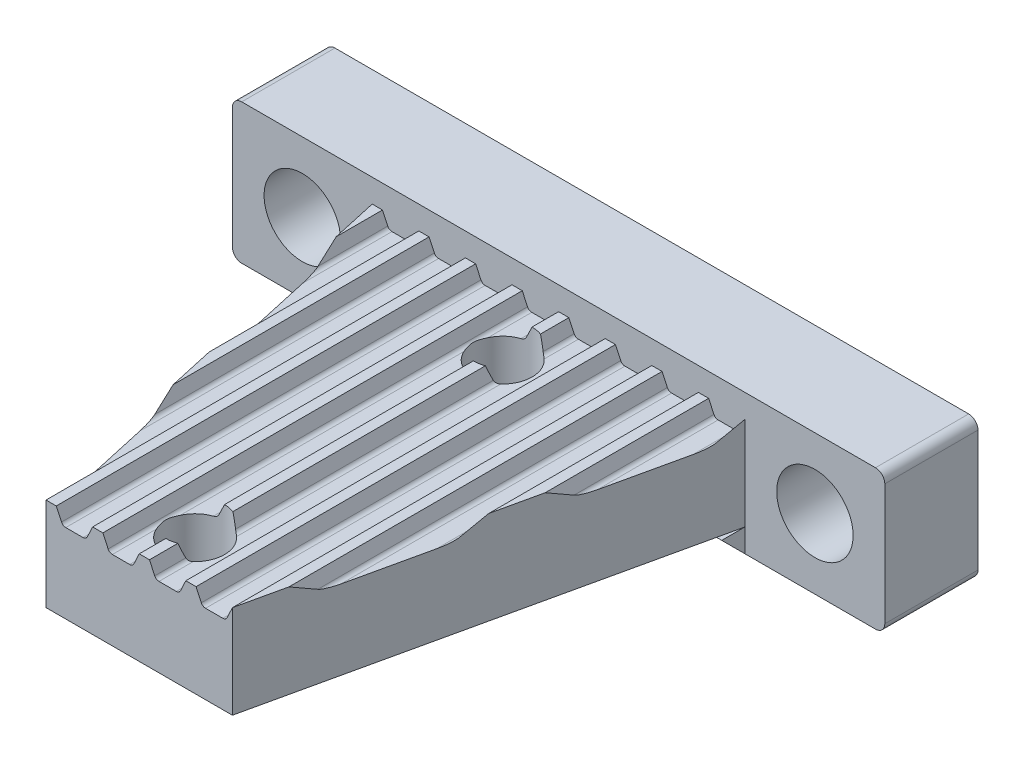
ISO-10303-21;
HEADER;
FILE_DESCRIPTION(('STEP AP214'),'2;1');
FILE_NAME('part.step','',(''),(''),'','','');
FILE_SCHEMA(('AUTOMOTIVE_DESIGN { 1 0 10303 214 1 1 1 1 }'));
ENDSEC;
DATA;
#1=APPLICATION_CONTEXT('core data for automotive mechanical design processes');
#2=APPLICATION_PROTOCOL_DEFINITION('international standard','automotive_design',2000,#1);
#3=PRODUCT_CONTEXT('',#1,'mechanical');
#4=PRODUCT('Part','Part','',(#3));
#5=PRODUCT_RELATED_PRODUCT_CATEGORY('part','',(#4));
#6=PRODUCT_DEFINITION_FORMATION('','',#4);
#7=PRODUCT_DEFINITION_CONTEXT('part definition',#1,'design');
#8=PRODUCT_DEFINITION('design','',#6,#7);
#9=PRODUCT_DEFINITION_SHAPE('','',#8);
#10=(LENGTH_UNIT() NAMED_UNIT(*) SI_UNIT(.MILLI.,.METRE.));
#11=(NAMED_UNIT(*) PLANE_ANGLE_UNIT() SI_UNIT($,.RADIAN.));
#12=(NAMED_UNIT(*) SI_UNIT($,.STERADIAN.) SOLID_ANGLE_UNIT());
#13=UNCERTAINTY_MEASURE_WITH_UNIT(LENGTH_MEASURE(1.E-05),#10,'distance_accuracy_value','');
#14=(GEOMETRIC_REPRESENTATION_CONTEXT(3) GLOBAL_UNCERTAINTY_ASSIGNED_CONTEXT((#13)) GLOBAL_UNIT_ASSIGNED_CONTEXT((#10,
#11,#12)) REPRESENTATION_CONTEXT('',''));
#15=CARTESIAN_POINT('',(0.,0.,0.));
#16=DIRECTION('',(0.,0.,1.));
#17=DIRECTION('',(1.,0.,0.));
#18=AXIS2_PLACEMENT_3D('',#15,#16,#17);
#19=CARTESIAN_POINT('',(55.,0.,0.));
#20=DIRECTION('',(-1.,0.,0.));
#21=DIRECTION('',(0.,0.,1.));
#22=AXIS2_PLACEMENT_3D('',#19,#20,#21);
#23=PLANE('',#22);
#24=DIRECTION('',(0.,0.,1.));
#25=VECTOR('',#24,1.);
#26=CARTESIAN_POINT('',(55.,-12.5,10.));
#27=LINE('',#26,#25);
#28=CARTESIAN_POINT('',(55.,-12.5,10.));
#29=VERTEX_POINT('',#28);
#30=CARTESIAN_POINT('',(55.,-12.5,12.5));
#31=VERTEX_POINT('',#30);
#32=EDGE_CURVE('E516',#29,#31,#27,.T.);
#33=ORIENTED_EDGE('',*,*,#32,.T.);
#34=DIRECTION('',(0.,0.707106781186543,0.707106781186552));
#35=VECTOR('',#34,1.);
#36=CARTESIAN_POINT('',(55.,-12.5,12.5));
#37=LINE('',#36,#35);
#38=CARTESIAN_POINT('',(55.,-15.,10.));
#39=VERTEX_POINT('',#38);
#40=EDGE_CURVE('E1131',#39,#31,#37,.T.);
#41=ORIENTED_EDGE('',*,*,#40,.F.);
#42=DIRECTION('',(0.,-1.,0.));
#43=VECTOR('',#42,1.);
#44=CARTESIAN_POINT('',(55.,-15.,10.));
#45=LINE('',#44,#43);
#46=EDGE_CURVE('E1090',#29,#39,#45,.T.);
#47=ORIENTED_EDGE('',*,*,#46,.F.);
#48=EDGE_LOOP('',(#33,#41,#47));
#49=FACE_BOUND('',#48,.T.);
#50=ADVANCED_FACE('F40',(#49),#23,.F.);
#51=CARTESIAN_POINT('',(15.,-12.5,12.5));
#52=DIRECTION('',(0.,0.707106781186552,-0.707106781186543));
#53=DIRECTION('',(1.,0.,0.));
#54=AXIS2_PLACEMENT_3D('',#51,#52,#53);
#55=PLANE('',#54);
#56=DIRECTION('',(1.,0.,0.));
#57=VECTOR('',#56,1.);
#58=CARTESIAN_POINT('',(0.,-15.,10.));
#59=LINE('',#58,#57);
#60=CARTESIAN_POINT('',(15.,-15.,10.));
#61=VERTEX_POINT('',#60);
#62=EDGE_CURVE('E556',#61,#39,#59,.T.);
#63=ORIENTED_EDGE('',*,*,#62,.T.);
#64=ORIENTED_EDGE('',*,*,#40,.T.);
#65=DIRECTION('',(1.,0.,0.));
#66=VECTOR('',#65,1.);
#67=CARTESIAN_POINT('',(15.,-12.5,12.5));
#68=LINE('',#67,#66);
#69=CARTESIAN_POINT('',(54.4444444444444,-12.5,12.5));
#70=VERTEX_POINT('',#69);
#71=EDGE_CURVE('E1292',#70,#31,#68,.T.);
#72=ORIENTED_EDGE('',*,*,#71,.F.);
#73=DIRECTION('',(1.,0.,0.));
#74=VECTOR('',#73,1.);
#75=CARTESIAN_POINT('',(15.,-12.5,12.5));
#76=LINE('',#75,#74);
#77=CARTESIAN_POINT('',(38.5707142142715,-12.5,12.5));
#78=VERTEX_POINT('',#77);
#79=EDGE_CURVE('E526',#78,#70,#76,.T.);
#80=ORIENTED_EDGE('',*,*,#79,.F.);
#81=CARTESIAN_POINT('',(35.,-9.00000000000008,16.));
#82=DIRECTION('',(0.,0.707106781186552,-0.707106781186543));
#83=DIRECTION('',(0.,0.707106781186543,0.707106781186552));
#84=AXIS2_PLACEMENT_3D('',#81,#82,#83);
#85=ELLIPSE('',#84,7.07106781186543,5.);
#86=CARTESIAN_POINT('',(31.4292857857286,-12.5,12.5));
#87=VERTEX_POINT('',#86);
#88=EDGE_CURVE('E1066',#87,#78,#85,.F.);
#89=ORIENTED_EDGE('',*,*,#88,.F.);
#90=CARTESIAN_POINT('',(15.5555555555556,-12.5,12.5));
#91=VERTEX_POINT('',#90);
#92=EDGE_CURVE('E1065',#91,#87,#76,.T.);
#93=ORIENTED_EDGE('',*,*,#92,.F.);
#94=DIRECTION('',(0.155230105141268,0.698535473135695,0.698535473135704));
#95=VECTOR('',#94,1.);
#96=CARTESIAN_POINT('',(20.1506024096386,8.17771084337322,33.1777108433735));
#97=LINE('',#96,#95);
#98=EDGE_CURVE('E1049',#61,#91,#97,.T.);
#99=ORIENTED_EDGE('',*,*,#98,.F.);
#100=EDGE_LOOP('',(#63,#64,#72,#80,#89,#93,#99));
#101=FACE_BOUND('',#100,.T.);
#102=ADVANCED_FACE('F1062',(#101),#55,.F.);
#103=CARTESIAN_POINT('',(15.,-2.5,55.));
#104=DIRECTION('',(0.,-1.,0.));
#105=DIRECTION('',(0.,0.,-1.));
#106=AXIS2_PLACEMENT_3D('',#103,#104,#105);
#107=PLANE('',#106);
#108=DIRECTION('',(0.,0.,1.));
#109=VECTOR('',#108,1.);
#110=CARTESIAN_POINT('',(35.,-2.5,10.));
#111=LINE('',#110,#109);
#112=CARTESIAN_POINT('',(35.,-2.5,19.15));
#113=VERTEX_POINT('',#112);
#114=CARTESIAN_POINT('',(35.,-2.5,45.85));
#115=VERTEX_POINT('',#114);
#116=EDGE_CURVE('E836',#113,#115,#111,.T.);
#117=ORIENTED_EDGE('',*,*,#116,.T.);
#118=CARTESIAN_POINT('',(35.,-2.5,49.));
#119=DIRECTION('',(0.,-1.,0.));
#120=DIRECTION('',(0.,0.,-1.));
#121=AXIS2_PLACEMENT_3D('',#118,#119,#120);
#122=CIRCLE('',#121,3.14999999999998);
#123=CARTESIAN_POINT('',(36.101077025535,-2.5,46.048707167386));
#124=VERTEX_POINT('',#123);
#125=EDGE_CURVE('E1195',#115,#124,#122,.T.);
#126=ORIENTED_EDGE('',*,*,#125,.T.);
#127=DIRECTION('',(0.,0.,1.));
#128=VECTOR('',#127,1.);
#129=CARTESIAN_POINT('',(36.101077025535,-2.5,10.));
#130=LINE('',#129,#128);
#131=CARTESIAN_POINT('',(36.101077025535,-2.5,18.951292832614));
#132=VERTEX_POINT('',#131);
#133=EDGE_CURVE('E884',#132,#124,#130,.T.);
#134=ORIENTED_EDGE('',*,*,#133,.F.);
#135=CARTESIAN_POINT('',(35.,-2.5,16.));
#136=DIRECTION('',(0.,-1.,0.));
#137=DIRECTION('',(0.,0.,-1.));
#138=AXIS2_PLACEMENT_3D('',#135,#136,#137);
#139=CIRCLE('',#138,3.15);
#140=EDGE_CURVE('E1174',#132,#113,#139,.T.);
#141=ORIENTED_EDGE('',*,*,#140,.T.);
#142=EDGE_LOOP('',(#117,#126,#134,#141));
#143=FACE_BOUND('',#142,.T.);
#144=ADVANCED_FACE('F1194',(#143),#107,.F.);
#145=CARTESIAN_POINT('',(35.,-2.5,10.));
#146=VERTEX_POINT('',#145);
#147=CARTESIAN_POINT('',(35.,-2.5,12.85));
#148=VERTEX_POINT('',#147);
#149=EDGE_CURVE('E833',#146,#148,#111,.T.);
#150=ORIENTED_EDGE('',*,*,#149,.T.);
#151=CARTESIAN_POINT('',(36.101077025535,-2.5,13.048707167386));
#152=VERTEX_POINT('',#151);
#153=EDGE_CURVE('E1176',#148,#152,#139,.T.);
#154=ORIENTED_EDGE('',*,*,#153,.T.);
#155=CARTESIAN_POINT('',(36.101077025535,-2.5,10.));
#156=VERTEX_POINT('',#155);
#157=EDGE_CURVE('E881',#156,#152,#130,.T.);
#158=ORIENTED_EDGE('',*,*,#157,.F.);
#159=DIRECTION('',(-1.,0.,0.));
#160=VECTOR('',#159,1.);
#161=CARTESIAN_POINT('',(15.,-2.5,10.));
#162=LINE('',#161,#160);
#163=EDGE_CURVE('E1376',#156,#146,#162,.T.);
#164=ORIENTED_EDGE('',*,*,#163,.T.);
#165=EDGE_LOOP('',(#150,#154,#158,#164));
#166=FACE_BOUND('',#165,.T.);
#167=ADVANCED_FACE('F1363',(#166),#107,.F.);
#168=CARTESIAN_POINT('',(37.1190736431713,-3.5,10.));
#169=DIRECTION('',(0.,0.,1.));
#170=DIRECTION('',(1.,0.,0.));
#171=AXIS2_PLACEMENT_3D('',#168,#169,#170);
#172=CYLINDRICAL_SURFACE('',#171,0.500000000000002);
#173=DIRECTION('',(0.,0.,1.));
#174=VECTOR('',#173,1.);
#175=CARTESIAN_POINT('',(36.6659197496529,-3.71130913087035,10.));
#176=LINE('',#175,#174);
#177=CARTESIAN_POINT('',(36.6659197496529,-3.71130913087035,18.6734268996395));
#178=VERTEX_POINT('',#177);
#179=CARTESIAN_POINT('',(36.6659197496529,-3.71130913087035,46.3265731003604));
#180=VERTEX_POINT('',#179);
#181=EDGE_CURVE('E879',#178,#180,#176,.T.);
#182=ORIENTED_EDGE('',*,*,#181,.T.);
#183=CARTESIAN_POINT('',(37.6190736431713,-3.5,47.249870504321));
#184=CARTESIAN_POINT('',(37.6190727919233,-3.48325623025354,47.2498690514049));
#185=CARTESIAN_POINT('',(37.6182243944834,-3.46650534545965,47.2485975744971));
#186=CARTESIAN_POINT('',(37.6149131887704,-3.43352309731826,47.2436579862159));
#187=CARTESIAN_POINT('',(37.6124483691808,-3.41729240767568,47.2399868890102));
#188=CARTESIAN_POINT('',(37.6053246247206,-3.38183645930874,47.2294541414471));
#189=CARTESIAN_POINT('',(37.6002745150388,-3.36285979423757,47.2220289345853));
#190=CARTESIAN_POINT('',(37.5884318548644,-3.32659643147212,47.2048315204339));
#191=CARTESIAN_POINT('',(37.5816357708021,-3.30931326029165,47.1950545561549));
#192=CARTESIAN_POINT('',(37.5626104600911,-3.2675058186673,47.1680817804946));
#193=CARTESIAN_POINT('',(37.5494368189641,-3.24415715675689,47.1497434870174));
#194=CARTESIAN_POINT('',(37.5207284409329,-3.20109416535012,47.1108148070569));
#195=CARTESIAN_POINT('',(37.5051878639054,-3.1813890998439,47.0902188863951));
#196=CARTESIAN_POINT('',(37.4630075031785,-3.13507638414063,47.0358615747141));
#197=CARTESIAN_POINT('',(37.4350214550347,-3.11077260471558,47.0011797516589));
#198=CARTESIAN_POINT('',(37.3754550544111,-3.0692034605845,46.9307352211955));
#199=CARTESIAN_POINT('',(37.3438702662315,-3.05194690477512,46.8949712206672));
#200=CARTESIAN_POINT('',(37.2767146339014,-3.02407122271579,46.8224831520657));
#201=CARTESIAN_POINT('',(37.2410547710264,-3.01365904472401,46.7857613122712));
#202=CARTESIAN_POINT('',(37.1672393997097,-3.00092223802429,46.713467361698));
#203=CARTESIAN_POINT('',(37.1290874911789,-2.99858619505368,46.6778936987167));
#204=CARTESIAN_POINT('',(37.059874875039,-3.00258755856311,46.6165010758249));
#205=CARTESIAN_POINT('',(37.0290924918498,-3.00713633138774,46.5902528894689));
#206=CARTESIAN_POINT('',(36.9674763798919,-3.02248236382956,46.5396919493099));
#207=CARTESIAN_POINT('',(36.93664275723,-3.03327211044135,46.5153769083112));
#208=CARTESIAN_POINT('',(36.8820405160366,-3.05893279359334,46.4738636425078));
#209=CARTESIAN_POINT('',(36.8580631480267,-3.07260352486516,46.4562005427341));
#210=CARTESIAN_POINT('',(36.8117645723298,-3.10458855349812,46.423021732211));
#211=CARTESIAN_POINT('',(36.7894416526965,-3.12289796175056,46.407503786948));
#212=CARTESIAN_POINT('',(36.7506737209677,-3.16102194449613,46.3812011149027));
#213=CARTESIAN_POINT('',(36.7338491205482,-3.18020022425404,46.3700555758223));
#214=CARTESIAN_POINT('',(36.7029140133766,-3.22164976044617,46.3499198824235));
#215=CARTESIAN_POINT('',(36.6888028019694,-3.24392021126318,46.3409291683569));
#216=CARTESIAN_POINT('',(36.6639661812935,-3.29120854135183,46.3253160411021));
#217=CARTESIAN_POINT('',(36.6532586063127,-3.31623999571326,46.3187060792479));
#218=CARTESIAN_POINT('',(36.6359763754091,-3.36822008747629,46.3081260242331));
#219=CARTESIAN_POINT('',(36.6293999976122,-3.39516792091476,46.3041548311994));
#220=CARTESIAN_POINT('',(36.6212171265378,-3.44737986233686,46.2992269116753));
#221=CARTESIAN_POINT('',(36.6191919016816,-3.4725551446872,46.2980160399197));
#222=CARTESIAN_POINT('',(36.6189656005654,-3.52292466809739,46.2978803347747));
#223=CARTESIAN_POINT('',(36.6207632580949,-3.54811890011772,46.2989547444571));
#224=CARTESIAN_POINT('',(36.6279325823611,-3.59674937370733,46.3032702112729));
#225=CARTESIAN_POINT('',(36.6331573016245,-3.62021554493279,46.3064222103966));
#226=CARTESIAN_POINT('',(36.646774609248,-3.66583216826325,46.3147259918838));
#227=CARTESIAN_POINT('',(36.6551672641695,-3.68798259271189,46.3198778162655));
#228=CARTESIAN_POINT('',(36.6750183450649,-3.73107117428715,46.3322381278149));
#229=CARTESIAN_POINT('',(36.686558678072,-3.75195549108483,46.339501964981));
#230=CARTESIAN_POINT('',(36.7120756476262,-3.7913841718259,46.3558505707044));
#231=CARTESIAN_POINT('',(36.7260530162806,-3.80992782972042,46.3649358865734));
#232=CARTESIAN_POINT('',(36.7572774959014,-3.84601119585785,46.3856440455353));
#233=CARTESIAN_POINT('',(36.7747069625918,-3.86330256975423,46.3974232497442));
#234=CARTESIAN_POINT('',(36.8111566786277,-3.8946723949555,46.4226557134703));
#235=CARTESIAN_POINT('',(36.8301775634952,-3.90874955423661,46.436109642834));
#236=CARTESIAN_POINT('',(36.8721873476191,-3.93561386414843,46.4665864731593));
#237=CARTESIAN_POINT('',(36.8953401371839,-3.94788034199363,46.4838410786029));
#238=CARTESIAN_POINT('',(36.9422391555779,-3.96838669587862,46.5198617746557));
#239=CARTESIAN_POINT('',(36.965985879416,-3.97662308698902,46.538629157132));
#240=CARTESIAN_POINT('',(37.0251524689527,-3.99246490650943,46.5868418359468));
#241=CARTESIAN_POINT('',(37.0605962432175,-3.99778785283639,46.6170170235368));
#242=CARTESIAN_POINT('',(37.1302856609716,-4.00109452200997,46.6791006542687));
#243=CARTESIAN_POINT('',(37.1645293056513,-3.99906653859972,46.7110117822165));
#244=CARTESIAN_POINT('',(37.2315061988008,-3.98839057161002,46.776242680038));
#245=CARTESIAN_POINT('',(37.2642105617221,-3.97964758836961,46.8095761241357));
#246=CARTESIAN_POINT('',(37.3270574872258,-3.9559301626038,46.8764630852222));
#247=CARTESIAN_POINT('',(37.3571991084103,-3.94095344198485,46.9100166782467));
#248=CARTESIAN_POINT('',(37.4121355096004,-3.9063052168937,46.9737399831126));
#249=CARTESIAN_POINT('',(37.4371652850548,-3.88710727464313,47.0039650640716));
#250=CARTESIAN_POINT('',(37.4841385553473,-3.84316467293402,47.0627451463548));
#251=CARTESIAN_POINT('',(37.5060887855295,-3.81843243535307,47.0913037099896));
#252=CARTESIAN_POINT('',(37.5373074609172,-3.77469317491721,47.1332023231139));
#253=CARTESIAN_POINT('',(37.5479502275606,-3.7578477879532,47.1477753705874));
#254=CARTESIAN_POINT('',(37.5676135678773,-3.72188158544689,47.1751324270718));
#255=CARTESIAN_POINT('',(37.5766359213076,-3.70276330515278,47.1879183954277));
#256=CARTESIAN_POINT('',(37.5908030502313,-3.66661479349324,47.2082526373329));
#257=CARTESIAN_POINT('',(37.59636418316,-3.65005237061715,47.2163342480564));
#258=CARTESIAN_POINT('',(37.6058603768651,-3.61556957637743,47.2302364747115));
#259=CARTESIAN_POINT('',(37.6097990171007,-3.59765229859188,47.2360620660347));
#260=CARTESIAN_POINT('',(37.614820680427,-3.56637045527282,47.2435187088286));
#261=CARTESIAN_POINT('',(37.6164065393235,-3.55326065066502,47.2458847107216));
#262=CARTESIAN_POINT('',(37.6185332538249,-3.52676870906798,47.2490610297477));
#263=CARTESIAN_POINT('',(37.6190743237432,-3.5133866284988,47.2498716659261));
#264=CARTESIAN_POINT('',(37.6190736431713,-3.5,47.249870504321));
#265=B_SPLINE_CURVE_WITH_KNOTS('',3,(#183,#184,#185,#186,#187,#188,#189,#190,#191,#192,#193,
#194,#195,#196,#197,#198,#199,#200,#201,#202,#203,#204,#205,#206,#207,#208,#209,#210,#211,#212,
#213,#214,#215,#216,#217,#218,#219,#220,#221,#222,#223,#224,#225,#226,#227,#228,#229,#230,#231,
#232,#233,#234,#235,#236,#237,#238,#239,#240,#241,#242,#243,#244,#245,#246,#247,#248,#249,#250,
#251,#252,#253,#254,#255,#256,#257,#258,#259,#260,#261,#262,#263,#264),.UNSPECIFIED.,.T.,.F.,(4,
2,2,2,2,2,2,2,2,2,2,2,2,2,2,2,2,2,2,2,2,2,2,2,2,2,2,2,2,2,2,2,2,2,2,2,2,2,2,2,4),(0.,
0.0501778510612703,0.100418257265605,0.163048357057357,0.225806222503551,0.32270465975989,
0.419846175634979,0.571321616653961,0.722985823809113,0.879047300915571,1.0348881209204,
1.15657561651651,1.27811692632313,1.37604437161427,1.4738690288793,1.55704015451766,
1.64018965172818,1.72376791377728,1.8073113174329,1.8827842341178,1.95823215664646,
2.03063962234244,2.10304860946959,2.17755908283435,2.25209197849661,2.3334653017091,
2.41487127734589,2.50864149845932,2.60249266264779,2.74228507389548,2.88230020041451,
3.02433351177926,3.16641877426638,3.29709459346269,3.42747999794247,3.50137836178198,
3.5751950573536,3.63275045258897,3.69017818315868,3.73030356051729,3.77042070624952),.UNSPECIFIED.);
#266=CARTESIAN_POINT('',(37.1190736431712,-4.,46.6693290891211));
#267=VERTEX_POINT('',#266);
#268=EDGE_CURVE('E657',#180,#267,#265,.T.);
#269=ORIENTED_EDGE('',*,*,#268,.T.);
#270=DIRECTION('',(0.,0.,1.));
#271=VECTOR('',#270,1.);
#272=CARTESIAN_POINT('',(37.1190736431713,-4.,10.));
#273=LINE('',#272,#271);
#274=CARTESIAN_POINT('',(37.1190736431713,-4.00000000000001,18.3306709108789));
#275=VERTEX_POINT('',#274);
#276=EDGE_CURVE('E874',#275,#267,#273,.T.);
#277=ORIENTED_EDGE('',*,*,#276,.F.);
#278=CARTESIAN_POINT('',(37.6190736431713,-3.5,17.750129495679));
#279=CARTESIAN_POINT('',(37.6190727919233,-3.51674376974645,17.7501309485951));
#280=CARTESIAN_POINT('',(37.6182243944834,-3.53349465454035,17.7514024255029));
#281=CARTESIAN_POINT('',(37.6149131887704,-3.56647690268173,17.7563420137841));
#282=CARTESIAN_POINT('',(37.6124483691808,-3.58270759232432,17.7600131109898));
#283=CARTESIAN_POINT('',(37.6053246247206,-3.61816354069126,17.7705458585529));
#284=CARTESIAN_POINT('',(37.6002745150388,-3.63714020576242,17.7779710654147));
#285=CARTESIAN_POINT('',(37.5884318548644,-3.67340356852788,17.7951684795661));
#286=CARTESIAN_POINT('',(37.5816357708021,-3.69068673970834,17.8049454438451));
#287=CARTESIAN_POINT('',(37.5626104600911,-3.7324941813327,17.8319182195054));
#288=CARTESIAN_POINT('',(37.5494368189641,-3.7558428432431,17.8502565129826));
#289=CARTESIAN_POINT('',(37.5207284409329,-3.79890583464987,17.8891851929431));
#290=CARTESIAN_POINT('',(37.5051878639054,-3.8186109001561,17.9097811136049));
#291=CARTESIAN_POINT('',(37.4630075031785,-3.86492361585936,17.964138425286));
#292=CARTESIAN_POINT('',(37.4350214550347,-3.88922739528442,17.9988202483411));
#293=CARTESIAN_POINT('',(37.3754550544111,-3.93079653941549,18.0692647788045));
#294=CARTESIAN_POINT('',(37.3438702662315,-3.94805309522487,18.1050287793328));
#295=CARTESIAN_POINT('',(37.2767146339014,-3.9759287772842,18.1775168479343));
#296=CARTESIAN_POINT('',(37.2410547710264,-3.98634095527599,18.2142386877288));
#297=CARTESIAN_POINT('',(37.1672393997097,-3.99907776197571,18.286532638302));
#298=CARTESIAN_POINT('',(37.1290874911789,-4.00141380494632,18.3221063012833));
#299=CARTESIAN_POINT('',(37.059874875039,-3.99741244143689,18.3834989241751));
#300=CARTESIAN_POINT('',(37.0290924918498,-3.99286366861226,18.4097471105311));
#301=CARTESIAN_POINT('',(36.9674763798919,-3.97751763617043,18.4603080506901));
#302=CARTESIAN_POINT('',(36.93664275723,-3.96672788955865,18.4846230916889));
#303=CARTESIAN_POINT('',(36.8820405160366,-3.94106720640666,18.5261363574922));
#304=CARTESIAN_POINT('',(36.8580631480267,-3.92739647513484,18.5437994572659));
#305=CARTESIAN_POINT('',(36.8117645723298,-3.89541144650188,18.576978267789));
#306=CARTESIAN_POINT('',(36.7894416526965,-3.87710203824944,18.592496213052));
#307=CARTESIAN_POINT('',(36.7506737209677,-3.83897805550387,18.6187988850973));
#308=CARTESIAN_POINT('',(36.7338491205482,-3.81979977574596,18.6299444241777));
#309=CARTESIAN_POINT('',(36.7029140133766,-3.77835023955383,18.6500801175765));
#310=CARTESIAN_POINT('',(36.6888028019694,-3.75607978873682,18.6590708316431));
#311=CARTESIAN_POINT('',(36.6639661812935,-3.70879145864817,18.6746839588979));
#312=CARTESIAN_POINT('',(36.6532586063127,-3.68376000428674,18.6812939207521));
#313=CARTESIAN_POINT('',(36.6359763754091,-3.6317799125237,18.691873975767));
#314=CARTESIAN_POINT('',(36.6293999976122,-3.60483207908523,18.6958451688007));
#315=CARTESIAN_POINT('',(36.6212171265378,-3.55262013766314,18.7007730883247));
#316=CARTESIAN_POINT('',(36.6191919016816,-3.5274448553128,18.7019839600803));
#317=CARTESIAN_POINT('',(36.6189656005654,-3.4770753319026,18.7021196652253));
#318=CARTESIAN_POINT('',(36.6207632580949,-3.45188109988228,18.7010452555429));
#319=CARTESIAN_POINT('',(36.6279325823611,-3.40325062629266,18.6967297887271));
#320=CARTESIAN_POINT('',(36.6331573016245,-3.3797844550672,18.6935777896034));
#321=CARTESIAN_POINT('',(36.6467746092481,-3.33416783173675,18.6852740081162));
#322=CARTESIAN_POINT('',(36.6551672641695,-3.3120174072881,18.6801221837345));
#323=CARTESIAN_POINT('',(36.6750183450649,-3.26892882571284,18.6677618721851));
#324=CARTESIAN_POINT('',(36.686558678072,-3.24804450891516,18.660498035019));
#325=CARTESIAN_POINT('',(36.7120756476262,-3.20861582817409,18.6441494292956));
#326=CARTESIAN_POINT('',(36.7260530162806,-3.19007217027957,18.6350641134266));
#327=CARTESIAN_POINT('',(36.7572774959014,-3.15398880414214,18.6143559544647));
#328=CARTESIAN_POINT('',(36.7747069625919,-3.13669743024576,18.6025767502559));
#329=CARTESIAN_POINT('',(36.8111566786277,-3.10532760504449,18.5773442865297));
#330=CARTESIAN_POINT('',(36.8301775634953,-3.09125044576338,18.563890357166));
#331=CARTESIAN_POINT('',(36.8721873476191,-3.06438613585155,18.5334135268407));
#332=CARTESIAN_POINT('',(36.8953401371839,-3.05211965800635,18.5161589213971));
#333=CARTESIAN_POINT('',(36.9422391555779,-3.03161330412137,18.4801382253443));
#334=CARTESIAN_POINT('',(36.965985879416,-3.02337691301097,18.461370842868));
#335=CARTESIAN_POINT('',(37.0251524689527,-3.00753509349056,18.4131581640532));
#336=CARTESIAN_POINT('',(37.0605962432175,-3.0022121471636,18.3829829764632));
#337=CARTESIAN_POINT('',(37.1302856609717,-2.99890547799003,18.3208993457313));
#338=CARTESIAN_POINT('',(37.1645293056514,-3.00093346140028,18.2889882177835));
#339=CARTESIAN_POINT('',(37.2315061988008,-3.01160942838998,18.223757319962));
#340=CARTESIAN_POINT('',(37.2642105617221,-3.02035241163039,18.1904238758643));
#341=CARTESIAN_POINT('',(37.3270574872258,-3.04406983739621,18.1235369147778));
#342=CARTESIAN_POINT('',(37.3571991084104,-3.05904655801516,18.0899833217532));
#343=CARTESIAN_POINT('',(37.4121355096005,-3.09369478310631,18.0262600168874));
#344=CARTESIAN_POINT('',(37.4371652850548,-3.11289272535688,17.9960349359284));
#345=CARTESIAN_POINT('',(37.4841385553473,-3.15683532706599,17.9372548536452));
#346=CARTESIAN_POINT('',(37.5060887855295,-3.18156756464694,17.9086962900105));
#347=CARTESIAN_POINT('',(37.5373074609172,-3.2253068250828,17.8667976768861));
#348=CARTESIAN_POINT('',(37.5479502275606,-3.24215221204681,17.8522246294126));
#349=CARTESIAN_POINT('',(37.5676135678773,-3.27811841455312,17.8248675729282));
#350=CARTESIAN_POINT('',(37.5766359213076,-3.29723669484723,17.8120816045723));
#351=CARTESIAN_POINT('',(37.5908030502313,-3.33338520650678,17.7917473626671));
#352=CARTESIAN_POINT('',(37.59636418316,-3.34994762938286,17.7836657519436));
#353=CARTESIAN_POINT('',(37.6058603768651,-3.38443042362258,17.7697635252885));
#354=CARTESIAN_POINT('',(37.6097990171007,-3.40234770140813,17.7639379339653));
#355=CARTESIAN_POINT('',(37.614820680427,-3.43362954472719,17.7564812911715));
#356=CARTESIAN_POINT('',(37.6164065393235,-3.44673934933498,17.7541152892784));
#357=CARTESIAN_POINT('',(37.6185332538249,-3.47323129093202,17.7509389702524));
#358=CARTESIAN_POINT('',(37.6190743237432,-3.4866133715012,17.7501283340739));
#359=CARTESIAN_POINT('',(37.6190736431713,-3.5,17.750129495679));
#360=B_SPLINE_CURVE_WITH_KNOTS('',3,(#278,#279,#280,#281,#282,#283,#284,#285,#286,#287,#288,
#289,#290,#291,#292,#293,#294,#295,#296,#297,#298,#299,#300,#301,#302,#303,#304,#305,#306,#307,
#308,#309,#310,#311,#312,#313,#314,#315,#316,#317,#318,#319,#320,#321,#322,#323,#324,#325,#326,
#327,#328,#329,#330,#331,#332,#333,#334,#335,#336,#337,#338,#339,#340,#341,#342,#343,#344,#345,
#346,#347,#348,#349,#350,#351,#352,#353,#354,#355,#356,#357,#358,#359),.UNSPECIFIED.,.T.,.F.,(4,
2,2,2,2,2,2,2,2,2,2,2,2,2,2,2,2,2,2,2,2,2,2,2,2,2,2,2,2,2,2,2,2,2,2,2,2,2,2,2,4),(0.,
0.0501778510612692,0.100418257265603,0.163048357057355,0.225806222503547,0.322704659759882,
0.419846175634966,0.57132161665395,0.722985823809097,0.879047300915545,1.03488812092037,
1.1565756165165,1.27811692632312,1.37604437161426,1.4738690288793,1.55704015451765,
1.64018965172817,1.72376791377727,1.80731131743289,1.88278423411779,1.95823215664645,
2.03063962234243,2.10304860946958,2.17755908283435,2.25209197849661,2.3334653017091,
2.41487127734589,2.50864149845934,2.6024926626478,2.7422850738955,2.88230020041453,
3.02433351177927,3.16641877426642,3.29709459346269,3.42747999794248,3.50137836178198,
3.5751950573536,3.63275045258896,3.69017818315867,3.73030356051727,3.7704207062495),.UNSPECIFIED.);
#361=EDGE_CURVE('E619',#275,#178,#360,.T.);
#362=ORIENTED_EDGE('',*,*,#361,.T.);
#363=EDGE_LOOP('',(#182,#269,#277,#362));
#364=FACE_BOUND('',#363,.T.);
#365=ADVANCED_FACE('F642',(#364),#172,.F.);
#366=CARTESIAN_POINT('',(36.6659197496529,-3.71130913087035,10.));
#367=VERTEX_POINT('',#366);
#368=CARTESIAN_POINT('',(36.6659197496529,-3.71130913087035,13.3265731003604));
#369=VERTEX_POINT('',#368);
#370=EDGE_CURVE('E876',#367,#369,#176,.T.);
#371=ORIENTED_EDGE('',*,*,#370,.T.);
#372=CARTESIAN_POINT('',(37.6190736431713,-3.5,14.249870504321));
#373=CARTESIAN_POINT('',(37.6190727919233,-3.48325623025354,14.2498690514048));
#374=CARTESIAN_POINT('',(37.6182243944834,-3.46650534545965,14.248597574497));
#375=CARTESIAN_POINT('',(37.6149131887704,-3.43352309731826,14.2436579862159));
#376=CARTESIAN_POINT('',(37.6124483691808,-3.41729240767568,14.2399868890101));
#377=CARTESIAN_POINT('',(37.6053246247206,-3.38183645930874,14.2294541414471));
#378=CARTESIAN_POINT('',(37.6002745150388,-3.36285979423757,14.2220289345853));
#379=CARTESIAN_POINT('',(37.5884318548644,-3.32659643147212,14.2048315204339));
#380=CARTESIAN_POINT('',(37.5816357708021,-3.30931326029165,14.1950545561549));
#381=CARTESIAN_POINT('',(37.5626104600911,-3.2675058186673,14.1680817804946));
#382=CARTESIAN_POINT('',(37.5494368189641,-3.2441571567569,14.1497434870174));
#383=CARTESIAN_POINT('',(37.5207284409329,-3.20109416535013,14.1108148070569));
#384=CARTESIAN_POINT('',(37.5051878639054,-3.1813890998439,14.0902188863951));
#385=CARTESIAN_POINT('',(37.4630075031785,-3.13507638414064,14.035861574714));
#386=CARTESIAN_POINT('',(37.4350214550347,-3.11077260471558,14.0011797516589));
#387=CARTESIAN_POINT('',(37.3754550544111,-3.06920346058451,13.9307352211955));
#388=CARTESIAN_POINT('',(37.3438702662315,-3.05194690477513,13.8949712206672));
#389=CARTESIAN_POINT('',(37.2767146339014,-3.02407122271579,13.8224831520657));
#390=CARTESIAN_POINT('',(37.2410547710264,-3.01365904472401,13.7857613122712));
#391=CARTESIAN_POINT('',(37.1672393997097,-3.00092223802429,13.713467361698));
#392=CARTESIAN_POINT('',(37.1290874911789,-2.99858619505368,13.6778936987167));
#393=CARTESIAN_POINT('',(37.059874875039,-3.00258755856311,13.6165010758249));
#394=CARTESIAN_POINT('',(37.0290924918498,-3.00713633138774,13.5902528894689));
#395=CARTESIAN_POINT('',(36.9674763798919,-3.02248236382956,13.5396919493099));
#396=CARTESIAN_POINT('',(36.93664275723,-3.03327211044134,13.5153769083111));
#397=CARTESIAN_POINT('',(36.8820405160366,-3.05893279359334,13.4738636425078));
#398=CARTESIAN_POINT('',(36.8580631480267,-3.07260352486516,13.4562005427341));
#399=CARTESIAN_POINT('',(36.8117645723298,-3.10458855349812,13.423021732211));
#400=CARTESIAN_POINT('',(36.7894416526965,-3.12289796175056,13.407503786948));
#401=CARTESIAN_POINT('',(36.7506737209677,-3.16102194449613,13.3812011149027));
#402=CARTESIAN_POINT('',(36.7338491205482,-3.18020022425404,13.3700555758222));
#403=CARTESIAN_POINT('',(36.7029140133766,-3.22164976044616,13.3499198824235));
#404=CARTESIAN_POINT('',(36.6888028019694,-3.24392021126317,13.3409291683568));
#405=CARTESIAN_POINT('',(36.6639661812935,-3.29120854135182,13.3253160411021));
#406=CARTESIAN_POINT('',(36.6532586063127,-3.31623999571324,13.3187060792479));
#407=CARTESIAN_POINT('',(36.6359763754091,-3.36822008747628,13.308126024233));
#408=CARTESIAN_POINT('',(36.6293999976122,-3.39516792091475,13.3041548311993));
#409=CARTESIAN_POINT('',(36.6212171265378,-3.44737986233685,13.2992269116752));
#410=CARTESIAN_POINT('',(36.6191919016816,-3.47255514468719,13.2980160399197));
#411=CARTESIAN_POINT('',(36.6189656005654,-3.52292466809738,13.2978803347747));
#412=CARTESIAN_POINT('',(36.6207632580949,-3.54811890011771,13.2989547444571));
#413=CARTESIAN_POINT('',(36.6279325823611,-3.59674937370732,13.3032702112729));
#414=CARTESIAN_POINT('',(36.6331573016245,-3.62021554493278,13.3064222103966));
#415=CARTESIAN_POINT('',(36.646774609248,-3.66583216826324,13.3147259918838));
#416=CARTESIAN_POINT('',(36.6551672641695,-3.68798259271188,13.3198778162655));
#417=CARTESIAN_POINT('',(36.6750183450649,-3.73107117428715,13.3322381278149));
#418=CARTESIAN_POINT('',(36.686558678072,-3.75195549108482,13.339501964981));
#419=CARTESIAN_POINT('',(36.7120756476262,-3.7913841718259,13.3558505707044));
#420=CARTESIAN_POINT('',(36.7260530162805,-3.80992782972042,13.3649358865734));
#421=CARTESIAN_POINT('',(36.7572774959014,-3.84601119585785,13.3856440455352));
#422=CARTESIAN_POINT('',(36.7747069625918,-3.86330256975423,13.3974232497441));
#423=CARTESIAN_POINT('',(36.8111566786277,-3.8946723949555,13.4226557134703));
#424=CARTESIAN_POINT('',(36.8301775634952,-3.90874955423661,13.436109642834));
#425=CARTESIAN_POINT('',(36.8721873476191,-3.93561386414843,13.4665864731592));
#426=CARTESIAN_POINT('',(36.8953401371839,-3.94788034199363,13.4838410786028));
#427=CARTESIAN_POINT('',(36.9422391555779,-3.96838669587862,13.5198617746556));
#428=CARTESIAN_POINT('',(36.965985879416,-3.97662308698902,13.538629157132));
#429=CARTESIAN_POINT('',(37.0251524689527,-3.99246490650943,13.5868418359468));
#430=CARTESIAN_POINT('',(37.0605962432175,-3.99778785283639,13.6170170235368));
#431=CARTESIAN_POINT('',(37.1302856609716,-4.00109452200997,13.6791006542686));
#432=CARTESIAN_POINT('',(37.1645293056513,-3.99906653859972,13.7110117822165));
#433=CARTESIAN_POINT('',(37.2315061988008,-3.98839057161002,13.7762426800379));
#434=CARTESIAN_POINT('',(37.2642105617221,-3.97964758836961,13.8095761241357));
#435=CARTESIAN_POINT('',(37.3270574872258,-3.9559301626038,13.8764630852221));
#436=CARTESIAN_POINT('',(37.3571991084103,-3.94095344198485,13.9100166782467));
#437=CARTESIAN_POINT('',(37.4121355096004,-3.9063052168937,13.9737399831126));
#438=CARTESIAN_POINT('',(37.4371652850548,-3.88710727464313,14.0039650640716));
#439=CARTESIAN_POINT('',(37.4841385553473,-3.84316467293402,14.0627451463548));
#440=CARTESIAN_POINT('',(37.5060887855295,-3.81843243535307,14.0913037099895));
#441=CARTESIAN_POINT('',(37.5373074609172,-3.7746931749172,14.1332023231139));
#442=CARTESIAN_POINT('',(37.5479502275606,-3.7578477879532,14.1477753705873));
#443=CARTESIAN_POINT('',(37.5676135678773,-3.72188158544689,14.1751324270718));
#444=CARTESIAN_POINT('',(37.5766359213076,-3.70276330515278,14.1879183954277));
#445=CARTESIAN_POINT('',(37.5908030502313,-3.66661479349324,14.2082526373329));
#446=CARTESIAN_POINT('',(37.59636418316,-3.65005237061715,14.2163342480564));
#447=CARTESIAN_POINT('',(37.6058603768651,-3.61556957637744,14.2302364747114));
#448=CARTESIAN_POINT('',(37.6097990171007,-3.59765229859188,14.2360620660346));
#449=CARTESIAN_POINT('',(37.614820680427,-3.56637045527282,14.2435187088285));
#450=CARTESIAN_POINT('',(37.6164065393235,-3.55326065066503,14.2458847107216));
#451=CARTESIAN_POINT('',(37.6185332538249,-3.52676870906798,14.2490610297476));
#452=CARTESIAN_POINT('',(37.6190743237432,-3.5133866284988,14.2498716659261));
#453=CARTESIAN_POINT('',(37.6190736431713,-3.5,14.249870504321));
#454=B_SPLINE_CURVE_WITH_KNOTS('',3,(#372,#373,#374,#375,#376,#377,#378,#379,#380,#381,#382,
#383,#384,#385,#386,#387,#388,#389,#390,#391,#392,#393,#394,#395,#396,#397,#398,#399,#400,#401,
#402,#403,#404,#405,#406,#407,#408,#409,#410,#411,#412,#413,#414,#415,#416,#417,#418,#419,#420,
#421,#422,#423,#424,#425,#426,#427,#428,#429,#430,#431,#432,#433,#434,#435,#436,#437,#438,#439,
#440,#441,#442,#443,#444,#445,#446,#447,#448,#449,#450,#451,#452,#453),.UNSPECIFIED.,.T.,.F.,(4,
2,2,2,2,2,2,2,2,2,2,2,2,2,2,2,2,2,2,2,2,2,2,2,2,2,2,2,2,2,2,2,2,2,2,2,2,2,2,2,4),(0.,
0.0501778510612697,0.100418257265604,0.163048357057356,0.225806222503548,0.322704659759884,
0.419846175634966,0.571321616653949,0.722985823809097,0.879047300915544,1.03488812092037,
1.1565756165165,1.27811692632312,1.37604437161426,1.4738690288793,1.55704015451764,
1.64018965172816,1.72376791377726,1.80731131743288,1.88278423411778,1.95823215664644,
2.03063962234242,2.10304860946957,2.17755908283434,2.2520919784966,2.33346530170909,
2.41487127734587,2.50864149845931,2.60249266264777,2.74228507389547,2.88230020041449,
3.02433351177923,3.16641877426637,3.29709459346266,3.42747999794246,3.50137836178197,
3.57519505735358,3.63275045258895,3.69017818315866,3.73030356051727,3.7704207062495),.UNSPECIFIED.);
#455=CARTESIAN_POINT('',(37.1190736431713,-4.,13.6693290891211));
#456=VERTEX_POINT('',#455);
#457=EDGE_CURVE('E626',#369,#456,#454,.T.);
#458=ORIENTED_EDGE('',*,*,#457,.T.);
#459=CARTESIAN_POINT('',(37.1190736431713,-4.,10.));
#460=VERTEX_POINT('',#459);
#461=EDGE_CURVE('E871',#460,#456,#273,.T.);
#462=ORIENTED_EDGE('',*,*,#461,.F.);
#463=CARTESIAN_POINT('',(37.1190736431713,-3.5,10.));
#464=DIRECTION('',(0.,0.,1.));
#465=DIRECTION('',(-1.,0.,0.));
#466=AXIS2_PLACEMENT_3D('',#463,#464,#465);
#467=CIRCLE('',#466,0.500000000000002);
#468=EDGE_CURVE('E844',#367,#460,#467,.T.);
#469=ORIENTED_EDGE('',*,*,#468,.F.);
#470=EDGE_LOOP('',(#371,#458,#462,#469));
#471=FACE_BOUND('',#470,.T.);
#472=ADVANCED_FACE('F643',(#471),#172,.F.);
#473=CARTESIAN_POINT('',(36.6659197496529,-3.71130913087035,10.));
#474=DIRECTION('',(-0.906307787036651,-0.422618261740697,0.));
#475=DIRECTION('',(0.422618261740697,-0.906307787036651,0.));
#476=AXIS2_PLACEMENT_3D('',#473,#474,#475);
#477=PLANE('',#476);
#478=CARTESIAN_POINT('',(36.6659197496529,-3.71130913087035,51.6734268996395));
#479=VERTEX_POINT('',#478);
#480=CARTESIAN_POINT('',(36.6659197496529,-3.71130913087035,55.));
#481=VERTEX_POINT('',#480);
#482=EDGE_CURVE('E880',#479,#481,#176,.T.);
#483=ORIENTED_EDGE('',*,*,#482,.F.);
#484=CARTESIAN_POINT('',(35.,-0.138732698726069,49.));
#485=DIRECTION('',(-0.906307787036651,-0.422618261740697,0.));
#486=DIRECTION('',(0.422618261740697,-0.906307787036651,0.));
#487=AXIS2_PLACEMENT_3D('',#484,#485,#486);
#488=ELLIPSE('',#487,7.45353498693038,3.14999999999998);
#489=CARTESIAN_POINT('',(36.101077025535,-2.5,51.951292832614));
#490=VERTEX_POINT('',#489);
#491=EDGE_CURVE('E658',#479,#490,#488,.T.);
#492=ORIENTED_EDGE('',*,*,#491,.T.);
#493=CARTESIAN_POINT('',(36.101077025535,-2.5,55.));
#494=VERTEX_POINT('',#493);
#495=EDGE_CURVE('E885',#490,#494,#130,.T.);
#496=ORIENTED_EDGE('',*,*,#495,.T.);
#497=DIRECTION('',(0.422618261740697,-0.906307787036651,0.));
#498=VECTOR('',#497,1.);
#499=CARTESIAN_POINT('',(36.6659197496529,-3.71130913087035,55.));
#500=LINE('',#499,#498);
#501=EDGE_CURVE('E856',#494,#481,#500,.T.);
#502=ORIENTED_EDGE('',*,*,#501,.T.);
#503=EDGE_LOOP('',(#483,#492,#496,#502));
#504=FACE_BOUND('',#503,.T.);
#505=ADVANCED_FACE('F1201',(#504),#477,.F.);
#506=ORIENTED_EDGE('',*,*,#133,.T.);
#507=EDGE_CURVE('E659',#124,#180,#488,.T.);
#508=ORIENTED_EDGE('',*,*,#507,.T.);
#509=ORIENTED_EDGE('',*,*,#181,.F.);
#510=CARTESIAN_POINT('',(35.,-0.138732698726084,16.));
#511=DIRECTION('',(-0.906307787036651,-0.422618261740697,0.));
#512=DIRECTION('',(0.422618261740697,-0.906307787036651,0.));
#513=AXIS2_PLACEMENT_3D('',#510,#511,#512);
#514=ELLIPSE('',#513,7.45353498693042,3.15);
#515=EDGE_CURVE('E627',#178,#132,#514,.T.);
#516=ORIENTED_EDGE('',*,*,#515,.T.);
#517=EDGE_LOOP('',(#506,#508,#509,#516));
#518=FACE_BOUND('',#517,.T.);
#519=ADVANCED_FACE('F1189',(#518),#477,.F.);
#520=CARTESIAN_POINT('',(35.,-2.5,10.));
#521=DIRECTION('',(0.906307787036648,-0.422618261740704,0.));
#522=DIRECTION('',(0.422618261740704,0.906307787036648,0.));
#523=AXIS2_PLACEMENT_3D('',#520,#521,#522);
#524=PLANE('',#523);
#525=DIRECTION('',(0.,0.,1.));
#526=VECTOR('',#525,1.);
#527=CARTESIAN_POINT('',(34.4351572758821,-3.71130913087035,10.));
#528=LINE('',#527,#526);
#529=CARTESIAN_POINT('',(34.4351572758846,-3.71130913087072,19.0989438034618));
#530=VERTEX_POINT('',#529);
#531=CARTESIAN_POINT('',(34.4351572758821,-3.71130913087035,45.9010561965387));
#532=VERTEX_POINT('',#531);
#533=EDGE_CURVE('E817',#530,#532,#528,.T.);
#534=ORIENTED_EDGE('',*,*,#533,.T.);
#535=CARTESIAN_POINT('',(35.,-2.49999999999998,49.));
#536=DIRECTION('',(0.906307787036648,-0.422618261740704,0.));
#537=DIRECTION('',(-0.422618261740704,-0.906307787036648,0.));
#538=AXIS2_PLACEMENT_3D('',#535,#536,#537);
#539=ELLIPSE('',#538,7.45353498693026,3.14999999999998);
#540=EDGE_CURVE('E1320',#532,#115,#539,.T.);
#541=ORIENTED_EDGE('',*,*,#540,.T.);
#542=ORIENTED_EDGE('',*,*,#116,.F.);
#543=CARTESIAN_POINT('',(35.,-2.49999999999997,16.));
#544=DIRECTION('',(0.906307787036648,-0.422618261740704,0.));
#545=DIRECTION('',(-0.422618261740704,-0.906307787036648,0.));
#546=AXIS2_PLACEMENT_3D('',#543,#544,#545);
#547=ELLIPSE('',#546,7.45353498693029,3.15);
#548=EDGE_CURVE('E1166',#113,#530,#547,.T.);
#549=ORIENTED_EDGE('',*,*,#548,.T.);
#550=EDGE_LOOP('',(#534,#541,#542,#549));
#551=FACE_BOUND('',#550,.T.);
#552=ADVANCED_FACE('F1319',(#551),#524,.F.);
#553=CARTESIAN_POINT('',(34.4351572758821,-3.71130913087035,10.));
#554=VERTEX_POINT('',#553);
#555=CARTESIAN_POINT('',(34.4351572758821,-3.71130913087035,12.9010561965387));
#556=VERTEX_POINT('',#555);
#557=EDGE_CURVE('E761',#554,#556,#528,.T.);
#558=ORIENTED_EDGE('',*,*,#557,.T.);
#559=EDGE_CURVE('E1169',#556,#148,#547,.T.);
#560=ORIENTED_EDGE('',*,*,#559,.T.);
#561=ORIENTED_EDGE('',*,*,#149,.F.);
#562=DIRECTION('',(0.422618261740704,0.906307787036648,0.));
#563=VECTOR('',#562,1.);
#564=CARTESIAN_POINT('',(35.,-2.5,10.));
#565=LINE('',#564,#563);
#566=EDGE_CURVE('E783',#554,#146,#565,.T.);
#567=ORIENTED_EDGE('',*,*,#566,.F.);
#568=EDGE_LOOP('',(#558,#560,#561,#567));
#569=FACE_BOUND('',#568,.T.);
#570=ADVANCED_FACE('F1379',(#569),#524,.F.);
#571=CARTESIAN_POINT('',(33.9820033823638,-3.5,10.));
#572=DIRECTION('',(0.,0.,1.));
#573=DIRECTION('',(1.,0.,0.));
#574=AXIS2_PLACEMENT_3D('',#571,#572,#573);
#575=CYLINDRICAL_SURFACE('',#574,0.499999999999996);
#576=DIRECTION('',(0.,0.,1.));
#577=VECTOR('',#576,1.);
#578=CARTESIAN_POINT('',(33.9820033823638,-4.,10.));
#579=LINE('',#578,#577);
#580=CARTESIAN_POINT('',(33.9820033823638,-4.,18.9809701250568));
#581=VERTEX_POINT('',#580);
#582=CARTESIAN_POINT('',(33.9820033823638,-4.,46.0190298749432));
#583=VERTEX_POINT('',#582);
#584=EDGE_CURVE('E822',#581,#583,#579,.T.);
#585=ORIENTED_EDGE('',*,*,#584,.T.);
#586=CARTESIAN_POINT('',(34.4820033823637,-3.5,45.8928824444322));
#587=CARTESIAN_POINT('',(34.4820022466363,-3.47227597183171,45.8928823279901));
#588=CARTESIAN_POINT('',(34.4796897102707,-3.44453557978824,45.8932654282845));
#589=CARTESIAN_POINT('',(34.4705032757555,-3.3898240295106,45.8948181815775));
#590=CARTESIAN_POINT('',(34.4636249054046,-3.36285365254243,45.8959886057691));
#591=CARTESIAN_POINT('',(34.4455207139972,-3.31047748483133,45.8991716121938));
#592=CARTESIAN_POINT('',(34.4342967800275,-3.28507102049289,45.901183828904));
#593=CARTESIAN_POINT('',(34.4078556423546,-3.23653562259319,45.9061278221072));
#594=CARTESIAN_POINT('',(34.3926393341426,-3.21340617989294,45.9090593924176));
#595=CARTESIAN_POINT('',(34.358669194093,-3.17002595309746,45.9159288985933));
#596=CARTESIAN_POINT('',(34.3399102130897,-3.14977943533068,45.9198683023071));
#597=CARTESIAN_POINT('',(34.2994665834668,-3.11274153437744,45.9288143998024));
#598=CARTESIAN_POINT('',(34.2777818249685,-3.09595028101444,45.9338211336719));
#599=CARTESIAN_POINT('',(34.2319312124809,-3.06607314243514,45.9449825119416));
#600=CARTESIAN_POINT('',(34.2077420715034,-3.05302726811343,45.9511484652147));
#601=CARTESIAN_POINT('',(34.1578157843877,-3.03113610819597,45.9645603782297));
#602=CARTESIAN_POINT('',(34.1320784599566,-3.0222913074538,45.9718064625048));
#603=CARTESIAN_POINT('',(34.0790151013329,-3.00871500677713,45.9875135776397));
#604=CARTESIAN_POINT('',(34.0516645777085,-3.0041140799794,45.9960044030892));
#605=CARTESIAN_POINT('',(33.9968636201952,-2.99946425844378,46.0138572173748));
#606=CARTESIAN_POINT('',(33.9694131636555,-2.99941646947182,46.0232194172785));
#607=CARTESIAN_POINT('',(33.9136991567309,-3.00385987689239,46.0430811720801));
#608=CARTESIAN_POINT('',(33.8854662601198,-3.00858433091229,46.0536144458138));
#609=CARTESIAN_POINT('',(33.830342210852,-3.02270642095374,46.0750595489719));
#610=CARTESIAN_POINT('',(33.8034514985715,-3.03210557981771,46.085971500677));
#611=CARTESIAN_POINT('',(33.7503591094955,-3.05589602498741,46.1083279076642));
#612=CARTESIAN_POINT('',(33.7242572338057,-3.07051115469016,46.1197720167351));
#613=CARTESIAN_POINT('',(33.6749101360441,-3.10428798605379,46.1421386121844));
#614=CARTESIAN_POINT('',(33.6516656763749,-3.1234508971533,46.1530609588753));
#615=CARTESIAN_POINT('',(33.6087907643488,-3.16590365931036,46.1737652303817));
#616=CARTESIAN_POINT('',(33.5891527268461,-3.18918464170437,46.1835495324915));
#617=CARTESIAN_POINT('',(33.5541959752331,-3.23939576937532,46.2013330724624));
#618=CARTESIAN_POINT('',(33.5388742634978,-3.2663233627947,46.2093335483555));
#619=CARTESIAN_POINT('',(33.514436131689,-3.32059130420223,46.2222715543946));
#620=CARTESIAN_POINT('',(33.5048944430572,-3.3476899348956,46.2274156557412));
#621=CARTESIAN_POINT('',(33.4905714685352,-3.40345544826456,46.2351864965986));
#622=CARTESIAN_POINT('',(33.4857852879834,-3.43212068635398,46.2378158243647));
#623=CARTESIAN_POINT('',(33.4815226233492,-3.48662509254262,46.2401574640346));
#624=CARTESIAN_POINT('',(33.4814986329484,-3.51240999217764,46.2401705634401));
#625=CARTESIAN_POINT('',(33.4853998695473,-3.56358417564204,46.2380276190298));
#626=CARTESIAN_POINT('',(33.4893244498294,-3.58897352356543,46.2358719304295));
#627=CARTESIAN_POINT('',(33.5007192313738,-3.63773480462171,46.2296756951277));
#628=CARTESIAN_POINT('',(33.5080598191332,-3.66114628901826,46.2257041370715));
#629=CARTESIAN_POINT('',(33.5259289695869,-3.70636774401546,46.2161687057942));
#630=CARTESIAN_POINT('',(33.5364582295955,-3.72817736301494,46.2106044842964));
#631=CARTESIAN_POINT('',(33.5611716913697,-3.77121617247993,46.1977724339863));
#632=CARTESIAN_POINT('',(33.5755576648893,-3.79230194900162,46.1904136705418));
#633=CARTESIAN_POINT('',(33.607119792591,-3.83181704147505,46.1746334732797));
#634=CARTESIAN_POINT('',(33.6242971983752,-3.85024515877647,46.1662115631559));
#635=CARTESIAN_POINT('',(33.6630841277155,-3.88608753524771,46.1476909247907));
#636=CARTESIAN_POINT('',(33.6849747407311,-3.90315560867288,46.137510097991));
#637=CARTESIAN_POINT('',(33.7311360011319,-3.93339083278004,46.1167509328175));
#638=CARTESIAN_POINT('',(33.7554077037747,-3.94655624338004,46.1061724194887));
#639=CARTESIAN_POINT('',(33.8077921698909,-3.96960887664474,46.0841796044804));
#640=CARTESIAN_POINT('',(33.8360568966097,-3.97915306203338,46.0727655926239));
#641=CARTESIAN_POINT('',(33.8940031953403,-3.9930963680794,46.0503838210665));
#642=CARTESIAN_POINT('',(33.9236848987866,-3.9974950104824,46.0394161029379));
#643=CARTESIAN_POINT('',(33.9837564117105,-4.00090388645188,46.0182612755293));
#644=CARTESIAN_POINT('',(34.0141483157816,-3.99989542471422,46.0080769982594));
#645=CARTESIAN_POINT('',(34.0745911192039,-3.99229496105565,45.9888335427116));
#646=CARTESIAN_POINT('',(34.1046421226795,-3.9857047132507,45.9797740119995));
#647=CARTESIAN_POINT('',(34.1618801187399,-3.96744100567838,45.9634069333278));
#648=CARTESIAN_POINT('',(34.1891351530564,-3.9560394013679,45.9560342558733));
#649=CARTESIAN_POINT('',(34.2414474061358,-3.92844181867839,45.9425782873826));
#650=CARTESIAN_POINT('',(34.2665053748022,-3.91224748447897,45.9364945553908));
#651=CARTESIAN_POINT('',(34.3122900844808,-3.87644585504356,45.9259017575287));
#652=CARTESIAN_POINT('',(34.3331737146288,-3.85705812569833,45.9213275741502));
#653=CARTESIAN_POINT('',(34.3714371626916,-3.81488350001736,45.913287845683));
#654=CARTESIAN_POINT('',(34.3888168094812,-3.79209643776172,45.9098223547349));
#655=CARTESIAN_POINT('',(34.419070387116,-3.74443534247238,45.9039940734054));
#656=CARTESIAN_POINT('',(34.4320509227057,-3.71963207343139,45.9016046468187));
#657=CARTESIAN_POINT('',(34.4537003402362,-3.66816566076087,45.8977139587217));
#658=CARTESIAN_POINT('',(34.4623737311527,-3.64150449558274,45.8962117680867));
#659=CARTESIAN_POINT('',(34.4731558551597,-3.59560023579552,45.8943673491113));
#660=CARTESIAN_POINT('',(34.4764686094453,-3.57663921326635,45.8938094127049));
#661=CARTESIAN_POINT('',(34.4808927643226,-3.53845475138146,45.8930670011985));
#662=CARTESIAN_POINT('',(34.4820041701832,-3.51923131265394,45.8928825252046));
#663=CARTESIAN_POINT('',(34.4820033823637,-3.5,45.8928824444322));
#664=B_SPLINE_CURVE_WITH_KNOTS('',3,(#586,#587,#588,#589,#590,#591,#592,#593,#594,#595,#596,
#597,#598,#599,#600,#601,#602,#603,#604,#605,#606,#607,#608,#609,#610,#611,#612,#613,#614,#615,
#616,#617,#618,#619,#620,#621,#622,#623,#624,#625,#626,#627,#628,#629,#630,#631,#632,#633,#634,
#635,#636,#637,#638,#639,#640,#641,#642,#643,#644,#645,#646,#647,#648,#649,#650,#651,#652,#653,
#654,#655,#656,#657,#658,#659,#660,#661,#662,#663),.UNSPECIFIED.,.T.,.F.,(4,2,2,2,2,2,2,2,2,2,2,
2,2,2,2,2,2,2,2,2,2,2,2,2,2,2,2,2,2,2,2,2,2,2,2,2,2,2,4),(0.,0.0831022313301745,
0.166285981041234,0.249433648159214,0.332562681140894,0.415813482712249,0.499067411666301,
0.583180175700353,0.667302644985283,0.753934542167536,0.840587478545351,0.931691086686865,
1.022824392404,1.11846348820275,1.21412804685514,1.30958903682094,1.40498356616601,
1.49204156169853,1.57900985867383,1.65597290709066,1.73292335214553,1.80716625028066,
1.88142539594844,1.96079866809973,2.04020762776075,2.12853309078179,2.2168978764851,
2.31227470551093,2.40766039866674,2.50337610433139,2.5990617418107,2.68994278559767,
2.78079268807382,2.86694868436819,2.9531088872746,3.03700005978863,3.12080322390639,
3.17844884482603,3.23609432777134),.UNSPECIFIED.);
#665=EDGE_CURVE('E1315',#583,#532,#664,.T.);
#666=ORIENTED_EDGE('',*,*,#665,.T.);
#667=ORIENTED_EDGE('',*,*,#533,.F.);
#668=CARTESIAN_POINT('',(34.4820033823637,-3.5,19.1071175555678));
#669=CARTESIAN_POINT('',(34.4820022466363,-3.5277240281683,19.1071176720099));
#670=CARTESIAN_POINT('',(34.4796897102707,-3.55546442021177,19.1067345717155));
#671=CARTESIAN_POINT('',(34.4705032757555,-3.6101759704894,19.1051818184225));
#672=CARTESIAN_POINT('',(34.4636249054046,-3.63714634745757,19.1040113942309));
#673=CARTESIAN_POINT('',(34.4455207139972,-3.68952251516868,19.1008283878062));
#674=CARTESIAN_POINT('',(34.4342967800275,-3.71492897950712,19.098816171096));
#675=CARTESIAN_POINT('',(34.4078556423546,-3.76346437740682,19.0938721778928));
#676=CARTESIAN_POINT('',(34.3926393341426,-3.78659382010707,19.0909406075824));
#677=CARTESIAN_POINT('',(34.358669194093,-3.82997404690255,19.0840711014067));
#678=CARTESIAN_POINT('',(34.3399102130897,-3.85022056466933,19.0801316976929));
#679=CARTESIAN_POINT('',(34.2994665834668,-3.88725846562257,19.0711856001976));
#680=CARTESIAN_POINT('',(34.2777818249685,-3.90404971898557,19.0661788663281));
#681=CARTESIAN_POINT('',(34.2319312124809,-3.93392685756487,19.0550174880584));
#682=CARTESIAN_POINT('',(34.2077420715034,-3.94697273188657,19.0488515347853));
#683=CARTESIAN_POINT('',(34.1578157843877,-3.96886389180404,19.0354396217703));
#684=CARTESIAN_POINT('',(34.1320784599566,-3.9777086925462,19.0281935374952));
#685=CARTESIAN_POINT('',(34.0790151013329,-3.99128499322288,19.0124864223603));
#686=CARTESIAN_POINT('',(34.0516645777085,-3.99588592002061,19.0039955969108));
#687=CARTESIAN_POINT('',(33.9968636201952,-4.00053574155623,18.9861427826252));
#688=CARTESIAN_POINT('',(33.9694131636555,-4.00058353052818,18.9767805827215));
#689=CARTESIAN_POINT('',(33.9136991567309,-3.99614012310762,18.95691882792));
#690=CARTESIAN_POINT('',(33.8854662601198,-3.99141566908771,18.9463855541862));
#691=CARTESIAN_POINT('',(33.830342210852,-3.97729357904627,18.9249404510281));
#692=CARTESIAN_POINT('',(33.8034514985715,-3.9678944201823,18.914028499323));
#693=CARTESIAN_POINT('',(33.7503591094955,-3.9441039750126,18.8916720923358));
#694=CARTESIAN_POINT('',(33.7242572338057,-3.92948884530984,18.8802279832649));
#695=CARTESIAN_POINT('',(33.6749101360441,-3.89571201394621,18.8578613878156));
#696=CARTESIAN_POINT('',(33.6516656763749,-3.8765491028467,18.8469390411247));
#697=CARTESIAN_POINT('',(33.6087907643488,-3.83409634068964,18.8262347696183));
#698=CARTESIAN_POINT('',(33.5891527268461,-3.81081535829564,18.8164504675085));
#699=CARTESIAN_POINT('',(33.5541959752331,-3.76060423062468,18.7986669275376));
#700=CARTESIAN_POINT('',(33.5388742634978,-3.7336766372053,18.7906664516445));
#701=CARTESIAN_POINT('',(33.514436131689,-3.67940869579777,18.7777284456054));
#702=CARTESIAN_POINT('',(33.5048944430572,-3.6523100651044,18.7725843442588));
#703=CARTESIAN_POINT('',(33.4905714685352,-3.59654455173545,18.7648135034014));
#704=CARTESIAN_POINT('',(33.4857852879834,-3.56787931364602,18.7621841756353));
#705=CARTESIAN_POINT('',(33.4815226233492,-3.51337490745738,18.7598425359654));
#706=CARTESIAN_POINT('',(33.4814986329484,-3.48759000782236,18.7598294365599));
#707=CARTESIAN_POINT('',(33.4853998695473,-3.43641582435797,18.7619723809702));
#708=CARTESIAN_POINT('',(33.4893244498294,-3.41102647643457,18.7641280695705));
#709=CARTESIAN_POINT('',(33.5007192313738,-3.36226519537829,18.7703243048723));
#710=CARTESIAN_POINT('',(33.5080598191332,-3.33885371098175,18.7742958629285));
#711=CARTESIAN_POINT('',(33.5259289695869,-3.29363225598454,18.7838312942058));
#712=CARTESIAN_POINT('',(33.5364582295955,-3.27182263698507,18.7893955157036));
#713=CARTESIAN_POINT('',(33.5611716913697,-3.22878382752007,18.8022275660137));
#714=CARTESIAN_POINT('',(33.5755576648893,-3.20769805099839,18.8095863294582));
#715=CARTESIAN_POINT('',(33.607119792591,-3.16818295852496,18.8253665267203));
#716=CARTESIAN_POINT('',(33.6242971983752,-3.14975484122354,18.8337884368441));
#717=CARTESIAN_POINT('',(33.6630841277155,-3.11391246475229,18.8523090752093));
#718=CARTESIAN_POINT('',(33.6849747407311,-3.09684439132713,18.862489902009));
#719=CARTESIAN_POINT('',(33.7311360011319,-3.06660916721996,18.8832490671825));
#720=CARTESIAN_POINT('',(33.7554077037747,-3.05344375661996,18.8938275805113));
#721=CARTESIAN_POINT('',(33.8077921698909,-3.03039112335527,18.9158203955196));
#722=CARTESIAN_POINT('',(33.8360568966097,-3.02084693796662,18.9272344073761));
#723=CARTESIAN_POINT('',(33.8940031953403,-3.00690363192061,18.9496161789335));
#724=CARTESIAN_POINT('',(33.9236848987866,-3.00250498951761,18.960583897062));
#725=CARTESIAN_POINT('',(33.9837564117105,-2.99909611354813,18.9817387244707));
#726=CARTESIAN_POINT('',(34.0141483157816,-3.00010457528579,18.9919230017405));
#727=CARTESIAN_POINT('',(34.0745911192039,-3.00770503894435,19.0111664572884));
#728=CARTESIAN_POINT('',(34.1046421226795,-3.0142952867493,19.0202259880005));
#729=CARTESIAN_POINT('',(34.1618801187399,-3.03255899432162,19.0365930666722));
#730=CARTESIAN_POINT('',(34.1891351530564,-3.0439605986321,19.0439657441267));
#731=CARTESIAN_POINT('',(34.2414474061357,-3.07155818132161,19.0574217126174));
#732=CARTESIAN_POINT('',(34.2665053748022,-3.08775251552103,19.0635054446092));
#733=CARTESIAN_POINT('',(34.3122900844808,-3.12355414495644,19.0740982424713));
#734=CARTESIAN_POINT('',(34.3331737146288,-3.14294187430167,19.0786724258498));
#735=CARTESIAN_POINT('',(34.3714371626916,-3.18511649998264,19.086712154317));
#736=CARTESIAN_POINT('',(34.3888168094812,-3.20790356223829,19.0901776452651));
#737=CARTESIAN_POINT('',(34.419070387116,-3.25556465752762,19.0960059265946));
#738=CARTESIAN_POINT('',(34.4320509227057,-3.28036792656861,19.0983953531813));
#739=CARTESIAN_POINT('',(34.4537003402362,-3.33183433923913,19.1022860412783));
#740=CARTESIAN_POINT('',(34.4623737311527,-3.35849550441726,19.1037882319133));
#741=CARTESIAN_POINT('',(34.4731558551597,-3.40439976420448,19.1056326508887));
#742=CARTESIAN_POINT('',(34.4764686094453,-3.42336078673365,19.1061905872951));
#743=CARTESIAN_POINT('',(34.4808927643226,-3.46154524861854,19.1069329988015));
#744=CARTESIAN_POINT('',(34.4820041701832,-3.48076868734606,19.1071174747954));
#745=CARTESIAN_POINT('',(34.4820033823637,-3.5,19.1071175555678));
#746=B_SPLINE_CURVE_WITH_KNOTS('',3,(#668,#669,#670,#671,#672,#673,#674,#675,#676,#677,#678,
#679,#680,#681,#682,#683,#684,#685,#686,#687,#688,#689,#690,#691,#692,#693,#694,#695,#696,#697,
#698,#699,#700,#701,#702,#703,#704,#705,#706,#707,#708,#709,#710,#711,#712,#713,#714,#715,#716,
#717,#718,#719,#720,#721,#722,#723,#724,#725,#726,#727,#728,#729,#730,#731,#732,#733,#734,#735,
#736,#737,#738,#739,#740,#741,#742,#743,#744,#745),.UNSPECIFIED.,.T.,.F.,(4,2,2,2,2,2,2,2,2,2,2,
2,2,2,2,2,2,2,2,2,2,2,2,2,2,2,2,2,2,2,2,2,2,2,2,2,2,2,4),(0.,0.0831022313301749,
0.166285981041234,0.249433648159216,0.332562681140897,0.41581348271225,0.499067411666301,
0.583180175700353,0.667302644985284,0.753934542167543,0.840587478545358,0.93169108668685,
1.022824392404,1.11846348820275,1.21412804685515,1.30958903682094,1.40498356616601,
1.49204156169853,1.57900985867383,1.65597290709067,1.73292335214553,1.80716625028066,
1.88142539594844,1.96079866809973,2.04020762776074,2.12853309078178,2.21689787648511,
2.31227470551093,2.40766039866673,2.50337610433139,2.5990617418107,2.68994278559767,
2.78079268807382,2.86694868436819,2.9531088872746,3.03700005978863,3.12080322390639,
3.17844884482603,3.23609432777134),.UNSPECIFIED.);
#747=EDGE_CURVE('E606',#530,#581,#746,.T.);
#748=ORIENTED_EDGE('',*,*,#747,.T.);
#749=EDGE_LOOP('',(#585,#666,#667,#748));
#750=FACE_BOUND('',#749,.T.);
#751=ADVANCED_FACE('F1314',(#750),#575,.F.);
#752=CARTESIAN_POINT('',(33.9820033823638,-4.,10.));
#753=VERTEX_POINT('',#752);
#754=CARTESIAN_POINT('',(33.9820033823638,-4.,13.0190298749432));
#755=VERTEX_POINT('',#754);
#756=EDGE_CURVE('E819',#753,#755,#579,.T.);
#757=ORIENTED_EDGE('',*,*,#756,.T.);
#758=CARTESIAN_POINT('',(34.4820033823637,-3.5,12.8928824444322));
#759=CARTESIAN_POINT('',(34.4820022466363,-3.47227597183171,12.8928823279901));
#760=CARTESIAN_POINT('',(34.4796897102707,-3.44453557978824,12.8932654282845));
#761=CARTESIAN_POINT('',(34.4705032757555,-3.3898240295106,12.8948181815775));
#762=CARTESIAN_POINT('',(34.4636249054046,-3.36285365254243,12.8959886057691));
#763=CARTESIAN_POINT('',(34.4455207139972,-3.31047748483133,12.8991716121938));
#764=CARTESIAN_POINT('',(34.4342967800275,-3.28507102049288,12.901183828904));
#765=CARTESIAN_POINT('',(34.4078556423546,-3.23653562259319,12.9061278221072));
#766=CARTESIAN_POINT('',(34.3926393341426,-3.21340617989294,12.9090593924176));
#767=CARTESIAN_POINT('',(34.358669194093,-3.17002595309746,12.9159288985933));
#768=CARTESIAN_POINT('',(34.3399102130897,-3.14977943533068,12.9198683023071));
#769=CARTESIAN_POINT('',(34.2994665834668,-3.11274153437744,12.9288143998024));
#770=CARTESIAN_POINT('',(34.2777818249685,-3.09595028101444,12.9338211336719));
#771=CARTESIAN_POINT('',(34.2319312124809,-3.06607314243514,12.9449825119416));
#772=CARTESIAN_POINT('',(34.2077420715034,-3.05302726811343,12.9511484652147));
#773=CARTESIAN_POINT('',(34.1578157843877,-3.03113610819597,12.9645603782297));
#774=CARTESIAN_POINT('',(34.1320784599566,-3.0222913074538,12.9718064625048));
#775=CARTESIAN_POINT('',(34.0790151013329,-3.00871500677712,12.9875135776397));
#776=CARTESIAN_POINT('',(34.0516645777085,-3.0041140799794,12.9960044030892));
#777=CARTESIAN_POINT('',(33.9968636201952,-2.99946425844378,13.0138572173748));
#778=CARTESIAN_POINT('',(33.9694131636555,-2.99941646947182,13.0232194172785));
#779=CARTESIAN_POINT('',(33.9136991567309,-3.00385987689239,13.04308117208));
#780=CARTESIAN_POINT('',(33.8854662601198,-3.00858433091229,13.0536144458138));
#781=CARTESIAN_POINT('',(33.830342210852,-3.02270642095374,13.0750595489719));
#782=CARTESIAN_POINT('',(33.8034514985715,-3.03210557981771,13.085971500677));
#783=CARTESIAN_POINT('',(33.7503591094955,-3.05589602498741,13.1083279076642));
#784=CARTESIAN_POINT('',(33.7242572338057,-3.07051115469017,13.1197720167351));
#785=CARTESIAN_POINT('',(33.6749101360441,-3.1042879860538,13.1421386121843));
#786=CARTESIAN_POINT('',(33.6516656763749,-3.1234508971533,13.1530609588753));
#787=CARTESIAN_POINT('',(33.6087907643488,-3.16590365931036,13.1737652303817));
#788=CARTESIAN_POINT('',(33.5891527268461,-3.18918464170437,13.1835495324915));
#789=CARTESIAN_POINT('',(33.5541959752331,-3.23939576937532,13.2013330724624));
#790=CARTESIAN_POINT('',(33.5388742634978,-3.2663233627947,13.2093335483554));
#791=CARTESIAN_POINT('',(33.514436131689,-3.32059130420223,13.2222715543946));
#792=CARTESIAN_POINT('',(33.5048944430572,-3.34768993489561,13.2274156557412));
#793=CARTESIAN_POINT('',(33.4905714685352,-3.40345544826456,13.2351864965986));
#794=CARTESIAN_POINT('',(33.4857852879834,-3.43212068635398,13.2378158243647));
#795=CARTESIAN_POINT('',(33.4815226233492,-3.48662509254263,13.2401574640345));
#796=CARTESIAN_POINT('',(33.4814986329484,-3.51240999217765,13.2401705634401));
#797=CARTESIAN_POINT('',(33.4853998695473,-3.56358417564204,13.2380276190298));
#798=CARTESIAN_POINT('',(33.4893244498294,-3.58897352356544,13.2358719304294));
#799=CARTESIAN_POINT('',(33.5007192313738,-3.63773480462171,13.2296756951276));
#800=CARTESIAN_POINT('',(33.5080598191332,-3.66114628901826,13.2257041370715));
#801=CARTESIAN_POINT('',(33.5259289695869,-3.70636774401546,13.2161687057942));
#802=CARTESIAN_POINT('',(33.5364582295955,-3.72817736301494,13.2106044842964));
#803=CARTESIAN_POINT('',(33.5611716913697,-3.77121617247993,13.1977724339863));
#804=CARTESIAN_POINT('',(33.5755576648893,-3.79230194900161,13.1904136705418));
#805=CARTESIAN_POINT('',(33.607119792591,-3.83181704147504,13.1746334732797));
#806=CARTESIAN_POINT('',(33.6242971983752,-3.85024515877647,13.1662115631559));
#807=CARTESIAN_POINT('',(33.6630841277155,-3.88608753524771,13.1476909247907));
#808=CARTESIAN_POINT('',(33.6849747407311,-3.90315560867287,13.137510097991));
#809=CARTESIAN_POINT('',(33.7311360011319,-3.93339083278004,13.1167509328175));
#810=CARTESIAN_POINT('',(33.7554077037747,-3.94655624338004,13.1061724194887));
#811=CARTESIAN_POINT('',(33.8077921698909,-3.96960887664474,13.0841796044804));
#812=CARTESIAN_POINT('',(33.8360568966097,-3.97915306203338,13.0727655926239));
#813=CARTESIAN_POINT('',(33.8940031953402,-3.9930963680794,13.0503838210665));
#814=CARTESIAN_POINT('',(33.9236848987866,-3.9974950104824,13.0394161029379));
#815=CARTESIAN_POINT('',(33.9837564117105,-4.00090388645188,13.0182612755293));
#816=CARTESIAN_POINT('',(34.0141483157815,-3.99989542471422,13.0080769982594));
#817=CARTESIAN_POINT('',(34.0745911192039,-3.99229496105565,12.9888335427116));
#818=CARTESIAN_POINT('',(34.1046421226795,-3.9857047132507,12.9797740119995));
#819=CARTESIAN_POINT('',(34.1618801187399,-3.96744100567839,12.9634069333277));
#820=CARTESIAN_POINT('',(34.1891351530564,-3.9560394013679,12.9560342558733));
#821=CARTESIAN_POINT('',(34.2414474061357,-3.9284418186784,12.9425782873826));
#822=CARTESIAN_POINT('',(34.2665053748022,-3.91224748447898,12.9364945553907));
#823=CARTESIAN_POINT('',(34.3122900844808,-3.87644585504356,12.9259017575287));
#824=CARTESIAN_POINT('',(34.3331737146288,-3.85705812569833,12.9213275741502));
#825=CARTESIAN_POINT('',(34.3714371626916,-3.81488350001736,12.913287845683));
#826=CARTESIAN_POINT('',(34.3888168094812,-3.79209643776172,12.9098223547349));
#827=CARTESIAN_POINT('',(34.419070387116,-3.74443534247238,12.9039940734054));
#828=CARTESIAN_POINT('',(34.4320509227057,-3.71963207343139,12.9016046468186));
#829=CARTESIAN_POINT('',(34.4537003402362,-3.66816566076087,12.8977139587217));
#830=CARTESIAN_POINT('',(34.4623737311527,-3.64150449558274,12.8962117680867));
#831=CARTESIAN_POINT('',(34.4731558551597,-3.59560023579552,12.8943673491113));
#832=CARTESIAN_POINT('',(34.4764686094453,-3.57663921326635,12.8938094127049));
#833=CARTESIAN_POINT('',(34.4808927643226,-3.53845475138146,12.8930670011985));
#834=CARTESIAN_POINT('',(34.4820041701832,-3.51923131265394,12.8928825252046));
#835=CARTESIAN_POINT('',(34.4820033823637,-3.5,12.8928824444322));
#836=B_SPLINE_CURVE_WITH_KNOTS('',3,(#758,#759,#760,#761,#762,#763,#764,#765,#766,#767,#768,
#769,#770,#771,#772,#773,#774,#775,#776,#777,#778,#779,#780,#781,#782,#783,#784,#785,#786,#787,
#788,#789,#790,#791,#792,#793,#794,#795,#796,#797,#798,#799,#800,#801,#802,#803,#804,#805,#806,
#807,#808,#809,#810,#811,#812,#813,#814,#815,#816,#817,#818,#819,#820,#821,#822,#823,#824,#825,
#826,#827,#828,#829,#830,#831,#832,#833,#834,#835),.UNSPECIFIED.,.T.,.F.,(4,2,2,2,2,2,2,2,2,2,2,
2,2,2,2,2,2,2,2,2,2,2,2,2,2,2,2,2,2,2,2,2,2,2,2,2,2,2,4),(0.,0.0831022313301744,
0.166285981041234,0.249433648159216,0.332562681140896,0.41581348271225,0.499067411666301,
0.583180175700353,0.667302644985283,0.753934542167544,0.840587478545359,0.93169108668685,
1.022824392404,1.11846348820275,1.21412804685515,1.30958903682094,1.40498356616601,
1.49204156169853,1.57900985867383,1.65597290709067,1.73292335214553,1.80716625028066,
1.88142539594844,1.96079866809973,2.04020762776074,2.12853309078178,2.21689787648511,
2.31227470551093,2.40766039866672,2.50337610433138,2.5990617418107,2.68994278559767,
2.78079268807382,2.86694868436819,2.9531088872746,3.03700005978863,3.12080322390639,
3.17844884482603,3.23609432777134),.UNSPECIFIED.);
#837=EDGE_CURVE('E613',#755,#556,#836,.T.);
#838=ORIENTED_EDGE('',*,*,#837,.T.);
#839=ORIENTED_EDGE('',*,*,#557,.F.);
#840=CARTESIAN_POINT('',(33.9820033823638,-3.5,10.));
#841=DIRECTION('',(0.,0.,1.));
#842=DIRECTION('',(-1.,0.,0.));
#843=AXIS2_PLACEMENT_3D('',#840,#841,#842);
#844=CIRCLE('',#843,0.499999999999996);
#845=EDGE_CURVE('E796',#753,#554,#844,.T.);
#846=ORIENTED_EDGE('',*,*,#845,.F.);
#847=EDGE_LOOP('',(#757,#838,#839,#846));
#848=FACE_BOUND('',#847,.T.);
#849=ADVANCED_FACE('F1347',(#848),#575,.F.);
#850=CARTESIAN_POINT('',(33.9820033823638,-4.,10.));
#851=DIRECTION('',(0.,-1.,0.));
#852=DIRECTION('',(1.,0.,0.));
#853=AXIS2_PLACEMENT_3D('',#850,#851,#852);
#854=PLANE('',#853);
#855=CARTESIAN_POINT('',(33.9820033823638,-4.,51.9809701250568));
#856=VERTEX_POINT('',#855);
#857=CARTESIAN_POINT('',(33.9820033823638,-4.,55.));
#858=VERTEX_POINT('',#857);
#859=EDGE_CURVE('E823',#856,#858,#579,.T.);
#860=ORIENTED_EDGE('',*,*,#859,.F.);
#861=CARTESIAN_POINT('',(35.,-4.,49.));
#862=DIRECTION('',(0.,-1.,0.));
#863=DIRECTION('',(1.,0.,0.));
#864=AXIS2_PLACEMENT_3D('',#861,#862,#863);
#865=CIRCLE('',#864,3.14999999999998);
#866=CARTESIAN_POINT('',(32.1190736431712,-4.00000000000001,50.2738772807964));
#867=VERTEX_POINT('',#866);
#868=EDGE_CURVE('E1306',#856,#867,#865,.T.);
#869=ORIENTED_EDGE('',*,*,#868,.T.);
#870=DIRECTION('',(0.,0.,1.));
#871=VECTOR('',#870,1.);
#872=CARTESIAN_POINT('',(32.1190736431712,-4.,10.));
#873=LINE('',#872,#871);
#874=CARTESIAN_POINT('',(32.1190736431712,-4.,55.));
#875=VERTEX_POINT('',#874);
#876=EDGE_CURVE('E828',#867,#875,#873,.T.);
#877=ORIENTED_EDGE('',*,*,#876,.T.);
#878=DIRECTION('',(1.,0.,0.));
#879=VECTOR('',#878,1.);
#880=CARTESIAN_POINT('',(33.9820033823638,-4.,55.));
#881=LINE('',#880,#879);
#882=EDGE_CURVE('E810',#875,#858,#881,.T.);
#883=ORIENTED_EDGE('',*,*,#882,.T.);
#884=EDGE_LOOP('',(#860,#869,#877,#883));
#885=FACE_BOUND('',#884,.T.);
#886=ADVANCED_FACE('F1303',(#885),#854,.F.);
#887=CARTESIAN_POINT('',(32.1190736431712,-4.00000000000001,17.2738772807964));
#888=VERTEX_POINT('',#887);
#889=CARTESIAN_POINT('',(32.1190736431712,-4.,47.7261227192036));
#890=VERTEX_POINT('',#889);
#891=EDGE_CURVE('E827',#888,#890,#873,.T.);
#892=ORIENTED_EDGE('',*,*,#891,.T.);
#893=EDGE_CURVE('E1300',#890,#583,#865,.T.);
#894=ORIENTED_EDGE('',*,*,#893,.T.);
#895=ORIENTED_EDGE('',*,*,#584,.F.);
#896=CARTESIAN_POINT('',(35.,-4.,16.));
#897=DIRECTION('',(0.,-1.,0.));
#898=DIRECTION('',(1.,0.,0.));
#899=AXIS2_PLACEMENT_3D('',#896,#897,#898);
#900=CIRCLE('',#899,3.15);
#901=EDGE_CURVE('E1154',#581,#888,#900,.T.);
#902=ORIENTED_EDGE('',*,*,#901,.T.);
#903=EDGE_LOOP('',(#892,#894,#895,#902));
#904=FACE_BOUND('',#903,.T.);
#905=ADVANCED_FACE('F1299',(#904),#854,.F.);
#906=CARTESIAN_POINT('',(26.101077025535,-2.5,10.));
#907=VERTEX_POINT('',#906);
#908=CARTESIAN_POINT('',(25.,-2.5,10.));
#909=VERTEX_POINT('',#908);
#910=EDGE_CURVE('E552',#907,#909,#162,.T.);
#911=ORIENTED_EDGE('',*,*,#910,.T.);
#912=DIRECTION('',(0.,0.,1.));
#913=VECTOR('',#912,1.);
#914=CARTESIAN_POINT('',(25.,-2.5,10.));
#915=LINE('',#914,#913);
#916=CARTESIAN_POINT('',(25.,-2.49999999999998,55.));
#917=VERTEX_POINT('',#916);
#918=EDGE_CURVE('E722',#909,#917,#915,.T.);
#919=ORIENTED_EDGE('',*,*,#918,.T.);
#920=DIRECTION('',(-1.,0.,0.));
#921=VECTOR('',#920,1.);
#922=CARTESIAN_POINT('',(15.,-2.5,55.));
#923=LINE('',#922,#921);
#924=CARTESIAN_POINT('',(26.101077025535,-2.5,55.));
#925=VERTEX_POINT('',#924);
#926=EDGE_CURVE('E533',#925,#917,#923,.T.);
#927=ORIENTED_EDGE('',*,*,#926,.F.);
#928=DIRECTION('',(0.,0.,1.));
#929=VECTOR('',#928,1.);
#930=CARTESIAN_POINT('',(26.101077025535,-2.5,10.));
#931=LINE('',#930,#929);
#932=EDGE_CURVE('E779',#907,#925,#931,.T.);
#933=ORIENTED_EDGE('',*,*,#932,.F.);
#934=EDGE_LOOP('',(#911,#919,#927,#933));
#935=FACE_BOUND('',#934,.T.);
#936=ADVANCED_FACE('F1246',(#935),#107,.F.);
#937=CARTESIAN_POINT('',(31.101077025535,-2.5,10.));
#938=VERTEX_POINT('',#937);
#939=CARTESIAN_POINT('',(30.,-2.5,10.));
#940=VERTEX_POINT('',#939);
#941=EDGE_CURVE('E1224',#938,#940,#162,.T.);
#942=ORIENTED_EDGE('',*,*,#941,.T.);
#943=DIRECTION('',(0.,0.,1.));
#944=VECTOR('',#943,1.);
#945=CARTESIAN_POINT('',(30.,-2.5,10.));
#946=LINE('',#945,#944);
#947=CARTESIAN_POINT('',(30.,-2.5,55.));
#948=VERTEX_POINT('',#947);
#949=EDGE_CURVE('E757',#940,#948,#946,.T.);
#950=ORIENTED_EDGE('',*,*,#949,.T.);
#951=CARTESIAN_POINT('',(31.101077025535,-2.5,55.));
#952=VERTEX_POINT('',#951);
#953=EDGE_CURVE('E536',#952,#948,#923,.T.);
#954=ORIENTED_EDGE('',*,*,#953,.F.);
#955=DIRECTION('',(0.,0.,1.));
#956=VECTOR('',#955,1.);
#957=CARTESIAN_POINT('',(31.101077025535,-2.5,10.));
#958=LINE('',#957,#956);
#959=EDGE_CURVE('E831',#938,#952,#958,.T.);
#960=ORIENTED_EDGE('',*,*,#959,.F.);
#961=EDGE_LOOP('',(#942,#950,#954,#960));
#962=FACE_BOUND('',#961,.T.);
#963=ADVANCED_FACE('F1222',(#962),#107,.F.);
#964=ORIENTED_EDGE('',*,*,#495,.F.);
#965=CARTESIAN_POINT('',(35.,-2.5,52.15));
#966=VERTEX_POINT('',#965);
#967=EDGE_CURVE('E1325',#490,#966,#122,.T.);
#968=ORIENTED_EDGE('',*,*,#967,.T.);
#969=CARTESIAN_POINT('',(35.,-2.5,55.));
#970=VERTEX_POINT('',#969);
#971=EDGE_CURVE('E799',#966,#970,#111,.T.);
#972=ORIENTED_EDGE('',*,*,#971,.T.);
#973=EDGE_CURVE('E1208',#494,#970,#923,.T.);
#974=ORIENTED_EDGE('',*,*,#973,.F.);
#975=EDGE_LOOP('',(#964,#968,#972,#974));
#976=FACE_BOUND('',#975,.T.);
#977=ADVANCED_FACE('F1210',(#976),#107,.F.);
#978=CARTESIAN_POINT('',(41.101077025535,-2.5,10.));
#979=VERTEX_POINT('',#978);
#980=CARTESIAN_POINT('',(40.,-2.5,10.));
#981=VERTEX_POINT('',#980);
#982=EDGE_CURVE('E1394',#979,#981,#162,.T.);
#983=ORIENTED_EDGE('',*,*,#982,.T.);
#984=DIRECTION('',(0.,0.,1.));
#985=VECTOR('',#984,1.);
#986=CARTESIAN_POINT('',(40.,-2.5,10.));
#987=LINE('',#986,#985);
#988=CARTESIAN_POINT('',(40.,-2.5,55.));
#989=VERTEX_POINT('',#988);
#990=EDGE_CURVE('E853',#981,#989,#987,.T.);
#991=ORIENTED_EDGE('',*,*,#990,.T.);
#992=CARTESIAN_POINT('',(41.101077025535,-2.5,55.));
#993=VERTEX_POINT('',#992);
#994=EDGE_CURVE('E538',#993,#989,#923,.T.);
#995=ORIENTED_EDGE('',*,*,#994,.F.);
#996=DIRECTION('',(0.,0.,1.));
#997=VECTOR('',#996,1.);
#998=CARTESIAN_POINT('',(41.101077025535,-2.5,10.));
#999=LINE('',#998,#997);
#1000=EDGE_CURVE('E926',#979,#993,#999,.T.);
#1001=ORIENTED_EDGE('',*,*,#1000,.F.);
#1002=EDGE_LOOP('',(#983,#991,#995,#1001));
#1003=FACE_BOUND('',#1002,.T.);
#1004=ADVANCED_FACE('F1397',(#1003),#107,.F.);
#1005=DIRECTION('',(0.,0.,1.));
#1006=VECTOR('',#1005,1.);
#1007=CARTESIAN_POINT('',(45.,-2.5,10.));
#1008=LINE('',#1007,#1006);
#1009=CARTESIAN_POINT('',(45.,-2.5,10.));
#1010=VERTEX_POINT('',#1009);
#1011=CARTESIAN_POINT('',(45.,-2.49999999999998,55.));
#1012=VERTEX_POINT('',#1011);
#1013=EDGE_CURVE('E904',#1010,#1012,#1008,.T.);
#1014=ORIENTED_EDGE('',*,*,#1013,.T.);
#1015=DIRECTION('',(0.216930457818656,0.,-0.976187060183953));
#1016=VECTOR('',#1015,1.);
#1017=CARTESIAN_POINT('',(43.5882352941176,-2.5,61.3529411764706));
#1018=LINE('',#1017,#1016);
#1019=CARTESIAN_POINT('',(46.101077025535,-2.5,50.0451533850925));
#1020=VERTEX_POINT('',#1019);
#1021=EDGE_CURVE('E511',#1012,#1020,#1018,.T.);
#1022=ORIENTED_EDGE('',*,*,#1021,.T.);
#1023=DIRECTION('',(0.,0.,1.));
#1024=VECTOR('',#1023,1.);
#1025=CARTESIAN_POINT('',(46.101077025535,-2.5,10.));
#1026=LINE('',#1025,#1024);
#1027=CARTESIAN_POINT('',(46.101077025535,-2.5,10.));
#1028=VERTEX_POINT('',#1027);
#1029=EDGE_CURVE('E958',#1028,#1020,#1026,.T.);
#1030=ORIENTED_EDGE('',*,*,#1029,.F.);
#1031=EDGE_CURVE('E540',#1028,#1010,#162,.T.);
#1032=ORIENTED_EDGE('',*,*,#1031,.T.);
#1033=EDGE_LOOP('',(#1014,#1022,#1030,#1032));
#1034=FACE_BOUND('',#1033,.T.);
#1035=ADVANCED_FACE('F1403',(#1034),#107,.F.);
#1036=DIRECTION('',(0.,0.,1.));
#1037=VECTOR('',#1036,1.);
#1038=CARTESIAN_POINT('',(50.,-2.5,10.));
#1039=LINE('',#1038,#1037);
#1040=CARTESIAN_POINT('',(50.,-2.5,10.));
#1041=VERTEX_POINT('',#1040);
#1042=CARTESIAN_POINT('',(50.,-2.5,32.5));
#1043=VERTEX_POINT('',#1042);
#1044=EDGE_CURVE('E946',#1041,#1043,#1039,.T.);
#1045=ORIENTED_EDGE('',*,*,#1044,.T.);
#1046=DIRECTION('',(0.216930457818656,0.,-0.976187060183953));
#1047=VECTOR('',#1046,1.);
#1048=CARTESIAN_POINT('',(43.5882352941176,-2.5,61.3529411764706));
#1049=LINE('',#1048,#1047);
#1050=CARTESIAN_POINT('',(51.101077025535,-2.5,27.5451533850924));
#1051=VERTEX_POINT('',#1050);
#1052=EDGE_CURVE('E1504',#1043,#1051,#1049,.T.);
#1053=ORIENTED_EDGE('',*,*,#1052,.T.);
#1054=DIRECTION('',(0.,0.,1.));
#1055=VECTOR('',#1054,1.);
#1056=CARTESIAN_POINT('',(51.101077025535,-2.5,10.));
#1057=LINE('',#1056,#1055);
#1058=CARTESIAN_POINT('',(51.101077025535,-2.5,10.));
#1059=VERTEX_POINT('',#1058);
#1060=EDGE_CURVE('E977',#1059,#1051,#1057,.T.);
#1061=ORIENTED_EDGE('',*,*,#1060,.F.);
#1062=EDGE_CURVE('E534',#1059,#1041,#162,.T.);
#1063=ORIENTED_EDGE('',*,*,#1062,.T.);
#1064=EDGE_LOOP('',(#1045,#1053,#1061,#1063));
#1065=FACE_BOUND('',#1064,.T.);
#1066=ADVANCED_FACE('F1491',(#1065),#107,.F.);
#1067=DIRECTION('',(0.,0.,1.));
#1068=VECTOR('',#1067,1.);
#1069=CARTESIAN_POINT('',(20.,-2.5,10.));
#1070=LINE('',#1069,#1068);
#1071=CARTESIAN_POINT('',(20.,-2.5,10.));
#1072=VERTEX_POINT('',#1071);
#1073=CARTESIAN_POINT('',(20.,-2.5,32.5));
#1074=VERTEX_POINT('',#1073);
#1075=EDGE_CURVE('E544',#1072,#1074,#1070,.T.);
#1076=ORIENTED_EDGE('',*,*,#1075,.T.);
#1077=DIRECTION('',(0.216930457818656,0.,0.976187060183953));
#1078=VECTOR('',#1077,1.);
#1079=CARTESIAN_POINT('',(24.5294117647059,-2.5,52.8823529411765));
#1080=LINE('',#1079,#1078);
#1081=CARTESIAN_POINT('',(21.101077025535,-2.5,37.4548466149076));
#1082=VERTEX_POINT('',#1081);
#1083=EDGE_CURVE('E684',#1074,#1082,#1080,.T.);
#1084=ORIENTED_EDGE('',*,*,#1083,.T.);
#1085=DIRECTION('',(0.,0.,1.));
#1086=VECTOR('',#1085,1.);
#1087=CARTESIAN_POINT('',(21.101077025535,-2.5,10.));
#1088=LINE('',#1087,#1086);
#1089=CARTESIAN_POINT('',(21.101077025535,-2.5,10.));
#1090=VERTEX_POINT('',#1089);
#1091=EDGE_CURVE('E736',#1090,#1082,#1088,.T.);
#1092=ORIENTED_EDGE('',*,*,#1091,.F.);
#1093=EDGE_CURVE('E550',#1090,#1072,#162,.T.);
#1094=ORIENTED_EDGE('',*,*,#1093,.T.);
#1095=EDGE_LOOP('',(#1076,#1084,#1092,#1094));
#1096=FACE_BOUND('',#1095,.T.);
#1097=ADVANCED_FACE('F1022',(#1096),#107,.F.);
#1098=CARTESIAN_POINT('',(0.,0.,10.));
#1099=DIRECTION('',(1.,0.,0.));
#1100=DIRECTION('',(0.,1.,0.));
#1101=AXIS2_PLACEMENT_3D('',#1098,#1099,#1100);
#1102=PLANE('',#1101);
#1103=DIRECTION('',(0.,-1.,0.));
#1104=VECTOR('',#1103,1.);
#1105=CARTESIAN_POINT('',(0.,0.,0.));
#1106=LINE('',#1105,#1104);
#1107=CARTESIAN_POINT('',(0.,-1.,0.));
#1108=VERTEX_POINT('',#1107);
#1109=CARTESIAN_POINT('',(0.,-14.,0.));
#1110=VERTEX_POINT('',#1109);
#1111=EDGE_CURVE('E563',#1108,#1110,#1106,.T.);
#1112=ORIENTED_EDGE('',*,*,#1111,.T.);
#1113=DIRECTION('',(0.,0.,-1.));
#1114=VECTOR('',#1113,1.);
#1115=CARTESIAN_POINT('',(0.,-14.,10.));
#1116=LINE('',#1115,#1114);
#1117=CARTESIAN_POINT('',(0.,-14.,10.));
#1118=VERTEX_POINT('',#1117);
#1119=EDGE_CURVE('E1085',#1110,#1118,#1116,.F.);
#1120=ORIENTED_EDGE('',*,*,#1119,.T.);
#1121=DIRECTION('',(0.,-1.,0.));
#1122=VECTOR('',#1121,1.);
#1123=CARTESIAN_POINT('',(0.,0.,10.));
#1124=LINE('',#1123,#1122);
#1125=CARTESIAN_POINT('',(0.,-1.,10.));
#1126=VERTEX_POINT('',#1125);
#1127=EDGE_CURVE('E553',#1126,#1118,#1124,.T.);
#1128=ORIENTED_EDGE('',*,*,#1127,.F.);
#1129=DIRECTION('',(0.,0.,-1.));
#1130=VECTOR('',#1129,1.);
#1131=CARTESIAN_POINT('',(0.,-1.,10.));
#1132=LINE('',#1131,#1130);
#1133=EDGE_CURVE('E1082',#1126,#1108,#1132,.T.);
#1134=ORIENTED_EDGE('',*,*,#1133,.T.);
#1135=EDGE_LOOP('',(#1112,#1120,#1128,#1134));
#1136=FACE_BOUND('',#1135,.T.);
#1137=ADVANCED_FACE('F1490',(#1136),#1102,.F.);
#1138=CARTESIAN_POINT('',(0.,-15.,10.));
#1139=DIRECTION('',(0.,1.,0.));
#1140=DIRECTION('',(0.,0.,1.));
#1141=AXIS2_PLACEMENT_3D('',#1138,#1139,#1140);
#1142=PLANE('',#1141);
#1143=DIRECTION('',(1.,0.,0.));
#1144=VECTOR('',#1143,1.);
#1145=CARTESIAN_POINT('',(0.,-15.,0.));
#1146=LINE('',#1145,#1144);
#1147=CARTESIAN_POINT('',(1.,-15.,0.));
#1148=VERTEX_POINT('',#1147);
#1149=CARTESIAN_POINT('',(69.,-15.,0.));
#1150=VERTEX_POINT('',#1149);
#1151=EDGE_CURVE('E566',#1148,#1150,#1146,.T.);
#1152=ORIENTED_EDGE('',*,*,#1151,.T.);
#1153=DIRECTION('',(0.,0.,-1.));
#1154=VECTOR('',#1153,1.);
#1155=CARTESIAN_POINT('',(69.,-15.,10.));
#1156=LINE('',#1155,#1154);
#1157=CARTESIAN_POINT('',(69.,-15.,10.));
#1158=VERTEX_POINT('',#1157);
#1159=EDGE_CURVE('E1107',#1150,#1158,#1156,.F.);
#1160=ORIENTED_EDGE('',*,*,#1159,.T.);
#1161=DIRECTION('',(-1.,0.,0.));
#1162=VECTOR('',#1161,1.);
#1163=CARTESIAN_POINT('',(70.,-15.,10.));
#1164=LINE('',#1163,#1162);
#1165=EDGE_CURVE('E1057',#1158,#39,#1164,.T.);
#1166=ORIENTED_EDGE('',*,*,#1165,.T.);
#1167=ORIENTED_EDGE('',*,*,#62,.F.);
#1168=CARTESIAN_POINT('',(1.,-15.,10.));
#1169=VERTEX_POINT('',#1168);
#1170=EDGE_CURVE('E558',#1169,#61,#59,.T.);
#1171=ORIENTED_EDGE('',*,*,#1170,.F.);
#1172=DIRECTION('',(0.,0.,-1.));
#1173=VECTOR('',#1172,1.);
#1174=CARTESIAN_POINT('',(1.,-15.,10.));
#1175=LINE('',#1174,#1173);
#1176=EDGE_CURVE('E1076',#1169,#1148,#1175,.T.);
#1177=ORIENTED_EDGE('',*,*,#1176,.T.);
#1178=EDGE_LOOP('',(#1152,#1160,#1166,#1167,#1171,#1177));
#1179=FACE_BOUND('',#1178,.T.);
#1180=ADVANCED_FACE('F1053',(#1179),#1142,.F.);
#1181=CARTESIAN_POINT('',(0.,0.,10.));
#1182=DIRECTION('',(0.,-1.,0.));
#1183=DIRECTION('',(0.,0.,-1.));
#1184=AXIS2_PLACEMENT_3D('',#1181,#1182,#1183);
#1185=PLANE('',#1184);
#1186=DIRECTION('',(-1.,0.,0.));
#1187=VECTOR('',#1186,1.);
#1188=CARTESIAN_POINT('',(0.,0.,10.));
#1189=LINE('',#1188,#1187);
#1190=CARTESIAN_POINT('',(69.,0.,10.));
#1191=VERTEX_POINT('',#1190);
#1192=CARTESIAN_POINT('',(1.,0.,10.));
#1193=VERTEX_POINT('',#1192);
#1194=EDGE_CURVE('E560',#1191,#1193,#1189,.T.);
#1195=ORIENTED_EDGE('',*,*,#1194,.F.);
#1196=DIRECTION('',(0.,0.,1.));
#1197=VECTOR('',#1196,1.);
#1198=CARTESIAN_POINT('',(69.,0.,0.));
#1199=LINE('',#1198,#1197);
#1200=CARTESIAN_POINT('',(69.,0.,0.));
#1201=VERTEX_POINT('',#1200);
#1202=EDGE_CURVE('E48',#1191,#1201,#1199,.F.);
#1203=ORIENTED_EDGE('',*,*,#1202,.T.);
#1204=DIRECTION('',(-1.,0.,0.));
#1205=VECTOR('',#1204,1.);
#1206=CARTESIAN_POINT('',(0.,0.,0.));
#1207=LINE('',#1206,#1205);
#1208=CARTESIAN_POINT('',(1.,0.,0.));
#1209=VERTEX_POINT('',#1208);
#1210=EDGE_CURVE('E557',#1201,#1209,#1207,.T.);
#1211=ORIENTED_EDGE('',*,*,#1210,.T.);
#1212=DIRECTION('',(0.,0.,-1.));
#1213=VECTOR('',#1212,1.);
#1214=CARTESIAN_POINT('',(1.,0.,10.));
#1215=LINE('',#1214,#1213);
#1216=EDGE_CURVE('E1087',#1209,#1193,#1215,.F.);
#1217=ORIENTED_EDGE('',*,*,#1216,.T.);
#1218=EDGE_LOOP('',(#1195,#1203,#1211,#1217));
#1219=FACE_BOUND('',#1218,.T.);
#1220=ADVANCED_FACE('F1114',(#1219),#1185,.F.);
#1221=CARTESIAN_POINT('',(0.,0.,10.));
#1222=DIRECTION('',(0.,0.,1.));
#1223=DIRECTION('',(1.,0.,0.));
#1224=AXIS2_PLACEMENT_3D('',#1221,#1222,#1223);
#1225=PLANE('',#1224);
#1226=DIRECTION('',(0.422618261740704,0.906307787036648,0.));
#1227=VECTOR('',#1226,1.);
#1228=CARTESIAN_POINT('',(55.,-2.5,10.));
#1229=LINE('',#1228,#1227);
#1230=CARTESIAN_POINT('',(54.4351572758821,-3.71130913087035,10.));
#1231=VERTEX_POINT('',#1230);
#1232=CARTESIAN_POINT('',(55.,-2.5,10.));
#1233=VERTEX_POINT('',#1232);
#1234=EDGE_CURVE('E705',#1231,#1233,#1229,.T.);
#1235=ORIENTED_EDGE('',*,*,#1234,.T.);
#1236=EDGE_CURVE('E1100',#1233,#29,#45,.T.);
#1237=ORIENTED_EDGE('',*,*,#1236,.T.);
#1238=ORIENTED_EDGE('',*,*,#46,.T.);
#1239=ORIENTED_EDGE('',*,*,#1165,.F.);
#1240=CARTESIAN_POINT('',(69.,-14.,10.));
#1241=DIRECTION('',(0.,0.,1.));
#1242=DIRECTION('',(1.,0.,0.));
#1243=AXIS2_PLACEMENT_3D('',#1240,#1241,#1242);
#1244=CIRCLE('',#1243,1.);
#1245=CARTESIAN_POINT('',(70.,-14.,10.));
#1246=VERTEX_POINT('',#1245);
#1247=EDGE_CURVE('E1110',#1158,#1246,#1244,.T.);
#1248=ORIENTED_EDGE('',*,*,#1247,.T.);
#1249=DIRECTION('',(0.,-1.,0.));
#1250=VECTOR('',#1249,1.);
#1251=CARTESIAN_POINT('',(70.,-15.,10.));
#1252=LINE('',#1251,#1250);
#1253=CARTESIAN_POINT('',(70.,-1.,10.));
#1254=VERTEX_POINT('',#1253);
#1255=EDGE_CURVE('E1127',#1254,#1246,#1252,.T.);
#1256=ORIENTED_EDGE('',*,*,#1255,.F.);
#1257=CARTESIAN_POINT('',(69.,-1.,10.));
#1258=DIRECTION('',(0.,0.,1.));
#1259=DIRECTION('',(1.,0.,0.));
#1260=AXIS2_PLACEMENT_3D('',#1257,#1258,#1259);
#1261=CIRCLE('',#1260,1.);
#1262=EDGE_CURVE('E62',#1254,#1191,#1261,.T.);
#1263=ORIENTED_EDGE('',*,*,#1262,.T.);
#1264=ORIENTED_EDGE('',*,*,#1194,.T.);
#1265=CARTESIAN_POINT('',(1.,-1.,10.));
#1266=DIRECTION('',(0.,0.,1.));
#1267=DIRECTION('',(1.,0.,0.));
#1268=AXIS2_PLACEMENT_3D('',#1265,#1266,#1267);
#1269=CIRCLE('',#1268,1.);
#1270=EDGE_CURVE('E1078',#1193,#1126,#1269,.T.);
#1271=ORIENTED_EDGE('',*,*,#1270,.T.);
#1272=ORIENTED_EDGE('',*,*,#1127,.T.);
#1273=CARTESIAN_POINT('',(1.,-14.,10.));
#1274=DIRECTION('',(0.,0.,1.));
#1275=DIRECTION('',(1.,0.,0.));
#1276=AXIS2_PLACEMENT_3D('',#1273,#1274,#1275);
#1277=CIRCLE('',#1276,1.);
#1278=EDGE_CURVE('E1080',#1118,#1169,#1277,.T.);
#1279=ORIENTED_EDGE('',*,*,#1278,.T.);
#1280=ORIENTED_EDGE('',*,*,#1170,.T.);
#1281=DIRECTION('',(0.,-1.,0.));
#1282=VECTOR('',#1281,1.);
#1283=CARTESIAN_POINT('',(15.,-2.5,10.));
#1284=LINE('',#1283,#1282);
#1285=CARTESIAN_POINT('',(15.,-2.49999999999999,10.));
#1286=VERTEX_POINT('',#1285);
#1287=EDGE_CURVE('E547',#1286,#61,#1284,.T.);
#1288=ORIENTED_EDGE('',*,*,#1287,.F.);
#1289=CARTESIAN_POINT('',(16.101077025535,-2.5,10.));
#1290=VERTEX_POINT('',#1289);
#1291=EDGE_CURVE('E542',#1290,#1286,#162,.T.);
#1292=ORIENTED_EDGE('',*,*,#1291,.F.);
#1293=DIRECTION('',(0.422618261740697,-0.906307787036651,0.));
#1294=VECTOR('',#1293,1.);
#1295=CARTESIAN_POINT('',(16.6659197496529,-3.71130913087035,10.));
#1296=LINE('',#1295,#1294);
#1297=CARTESIAN_POINT('',(16.6659197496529,-3.71130913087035,10.));
#1298=VERTEX_POINT('',#1297);
#1299=EDGE_CURVE('E993',#1290,#1298,#1296,.T.);
#1300=ORIENTED_EDGE('',*,*,#1299,.T.);
#1301=CARTESIAN_POINT('',(17.1190736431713,-3.5,10.));
#1302=DIRECTION('',(0.,0.,1.));
#1303=DIRECTION('',(-1.,0.,0.));
#1304=AXIS2_PLACEMENT_3D('',#1301,#1302,#1303);
#1305=CIRCLE('',#1304,0.500000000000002);
#1306=CARTESIAN_POINT('',(17.1190736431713,-4.,10.));
#1307=VERTEX_POINT('',#1306);
#1308=EDGE_CURVE('E996',#1298,#1307,#1305,.T.);
#1309=ORIENTED_EDGE('',*,*,#1308,.T.);
#1310=DIRECTION('',(1.,0.,0.));
#1311=VECTOR('',#1310,1.);
#1312=CARTESIAN_POINT('',(18.9820033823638,-4.,10.));
#1313=LINE('',#1312,#1311);
#1314=CARTESIAN_POINT('',(18.9820033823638,-4.,10.));
#1315=VERTEX_POINT('',#1314);
#1316=EDGE_CURVE('E999',#1307,#1315,#1313,.T.);
#1317=ORIENTED_EDGE('',*,*,#1316,.T.);
#1318=CARTESIAN_POINT('',(18.9820033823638,-3.5,10.));
#1319=DIRECTION('',(0.,0.,1.));
#1320=DIRECTION('',(-1.,0.,0.));
#1321=AXIS2_PLACEMENT_3D('',#1318,#1319,#1320);
#1322=CIRCLE('',#1321,0.499999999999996);
#1323=CARTESIAN_POINT('',(19.4351572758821,-3.71130913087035,10.));
#1324=VERTEX_POINT('',#1323);
#1325=EDGE_CURVE('E1002',#1315,#1324,#1322,.T.);
#1326=ORIENTED_EDGE('',*,*,#1325,.T.);
#1327=DIRECTION('',(0.422618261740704,0.906307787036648,0.));
#1328=VECTOR('',#1327,1.);
#1329=CARTESIAN_POINT('',(20.,-2.5,10.));
#1330=LINE('',#1329,#1328);
#1331=EDGE_CURVE('E726',#1324,#1072,#1330,.T.);
#1332=ORIENTED_EDGE('',*,*,#1331,.T.);
#1333=ORIENTED_EDGE('',*,*,#1093,.F.);
#1334=DIRECTION('',(0.422618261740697,-0.906307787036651,0.));
#1335=VECTOR('',#1334,1.);
#1336=CARTESIAN_POINT('',(21.6659197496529,-3.71130913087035,10.));
#1337=LINE('',#1336,#1335);
#1338=CARTESIAN_POINT('',(21.6659197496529,-3.71130913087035,10.));
#1339=VERTEX_POINT('',#1338);
#1340=EDGE_CURVE('E709',#1090,#1339,#1337,.T.);
#1341=ORIENTED_EDGE('',*,*,#1340,.T.);
#1342=CARTESIAN_POINT('',(22.1190736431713,-3.5,10.));
#1343=DIRECTION('',(0.,0.,1.));
#1344=DIRECTION('',(-1.,0.,0.));
#1345=AXIS2_PLACEMENT_3D('',#1342,#1343,#1344);
#1346=CIRCLE('',#1345,0.500000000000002);
#1347=CARTESIAN_POINT('',(22.1190736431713,-4.,10.));
#1348=VERTEX_POINT('',#1347);
#1349=EDGE_CURVE('E713',#1339,#1348,#1346,.T.);
#1350=ORIENTED_EDGE('',*,*,#1349,.T.);
#1351=DIRECTION('',(1.,0.,0.));
#1352=VECTOR('',#1351,1.);
#1353=CARTESIAN_POINT('',(23.9820033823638,-4.,10.));
#1354=LINE('',#1353,#1352);
#1355=CARTESIAN_POINT('',(23.9820033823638,-4.,10.));
#1356=VERTEX_POINT('',#1355);
#1357=EDGE_CURVE('E716',#1348,#1356,#1354,.T.);
#1358=ORIENTED_EDGE('',*,*,#1357,.T.);
#1359=CARTESIAN_POINT('',(23.9820033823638,-3.5,10.));
#1360=DIRECTION('',(0.,0.,1.));
#1361=DIRECTION('',(-1.,0.,0.));
#1362=AXIS2_PLACEMENT_3D('',#1359,#1360,#1361);
#1363=CIRCLE('',#1362,0.499999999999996);
#1364=CARTESIAN_POINT('',(24.4351572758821,-3.71130913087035,10.));
#1365=VERTEX_POINT('',#1364);
#1366=EDGE_CURVE('E719',#1356,#1365,#1363,.T.);
#1367=ORIENTED_EDGE('',*,*,#1366,.T.);
#1368=DIRECTION('',(0.422618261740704,0.906307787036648,0.));
#1369=VECTOR('',#1368,1.);
#1370=CARTESIAN_POINT('',(25.,-2.5,10.));
#1371=LINE('',#1370,#1369);
#1372=EDGE_CURVE('E706',#1365,#909,#1371,.T.);
#1373=ORIENTED_EDGE('',*,*,#1372,.T.);
#1374=ORIENTED_EDGE('',*,*,#910,.F.);
#1375=DIRECTION('',(0.422618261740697,-0.906307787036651,0.));
#1376=VECTOR('',#1375,1.);
#1377=CARTESIAN_POINT('',(26.6659197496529,-3.71130913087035,10.));
#1378=LINE('',#1377,#1376);
#1379=CARTESIAN_POINT('',(26.6659197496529,-3.71130913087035,10.));
#1380=VERTEX_POINT('',#1379);
#1381=EDGE_CURVE('E744',#907,#1380,#1378,.T.);
#1382=ORIENTED_EDGE('',*,*,#1381,.T.);
#1383=CARTESIAN_POINT('',(27.1190736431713,-3.5,10.));
#1384=DIRECTION('',(0.,0.,1.));
#1385=DIRECTION('',(-1.,0.,0.));
#1386=AXIS2_PLACEMENT_3D('',#1383,#1384,#1385);
#1387=CIRCLE('',#1386,0.500000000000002);
#1388=CARTESIAN_POINT('',(27.1190736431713,-4.,10.));
#1389=VERTEX_POINT('',#1388);
#1390=EDGE_CURVE('E748',#1380,#1389,#1387,.T.);
#1391=ORIENTED_EDGE('',*,*,#1390,.T.);
#1392=DIRECTION('',(1.,0.,0.));
#1393=VECTOR('',#1392,1.);
#1394=CARTESIAN_POINT('',(28.9820033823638,-4.,10.));
#1395=LINE('',#1394,#1393);
#1396=CARTESIAN_POINT('',(28.9820033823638,-4.,10.));
#1397=VERTEX_POINT('',#1396);
#1398=EDGE_CURVE('E751',#1389,#1397,#1395,.T.);
#1399=ORIENTED_EDGE('',*,*,#1398,.T.);
#1400=CARTESIAN_POINT('',(28.9820033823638,-3.5,10.));
#1401=DIRECTION('',(0.,0.,1.));
#1402=DIRECTION('',(-1.,0.,0.));
#1403=AXIS2_PLACEMENT_3D('',#1400,#1401,#1402);
#1404=CIRCLE('',#1403,0.499999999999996);
#1405=CARTESIAN_POINT('',(29.4351572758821,-3.71130913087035,10.));
#1406=VERTEX_POINT('',#1405);
#1407=EDGE_CURVE('E754',#1397,#1406,#1404,.T.);
#1408=ORIENTED_EDGE('',*,*,#1407,.T.);
#1409=DIRECTION('',(0.422618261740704,0.906307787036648,0.));
#1410=VECTOR('',#1409,1.);
#1411=CARTESIAN_POINT('',(30.,-2.5,10.));
#1412=LINE('',#1411,#1410);
#1413=EDGE_CURVE('E741',#1406,#940,#1412,.T.);
#1414=ORIENTED_EDGE('',*,*,#1413,.T.);
#1415=ORIENTED_EDGE('',*,*,#941,.F.);
#1416=DIRECTION('',(0.422618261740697,-0.906307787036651,0.));
#1417=VECTOR('',#1416,1.);
#1418=CARTESIAN_POINT('',(31.6659197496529,-3.71130913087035,10.));
#1419=LINE('',#1418,#1417);
#1420=CARTESIAN_POINT('',(31.6659197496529,-3.71130913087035,10.));
#1421=VERTEX_POINT('',#1420);
#1422=EDGE_CURVE('E786',#938,#1421,#1419,.T.);
#1423=ORIENTED_EDGE('',*,*,#1422,.T.);
#1424=CARTESIAN_POINT('',(32.1190736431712,-3.5,10.));
#1425=DIRECTION('',(0.,0.,1.));
#1426=DIRECTION('',(-1.,0.,0.));
#1427=AXIS2_PLACEMENT_3D('',#1424,#1425,#1426);
#1428=CIRCLE('',#1427,0.500000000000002);
#1429=CARTESIAN_POINT('',(32.1190736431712,-4.,10.));
#1430=VERTEX_POINT('',#1429);
#1431=EDGE_CURVE('E790',#1421,#1430,#1428,.T.);
#1432=ORIENTED_EDGE('',*,*,#1431,.T.);
#1433=DIRECTION('',(1.,0.,0.));
#1434=VECTOR('',#1433,1.);
#1435=CARTESIAN_POINT('',(33.9820033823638,-4.,10.));
#1436=LINE('',#1435,#1434);
#1437=EDGE_CURVE('E793',#1430,#753,#1436,.T.);
#1438=ORIENTED_EDGE('',*,*,#1437,.T.);
#1439=ORIENTED_EDGE('',*,*,#845,.T.);
#1440=ORIENTED_EDGE('',*,*,#566,.T.);
#1441=ORIENTED_EDGE('',*,*,#163,.F.);
#1442=DIRECTION('',(0.422618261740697,-0.906307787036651,0.));
#1443=VECTOR('',#1442,1.);
#1444=CARTESIAN_POINT('',(36.6659197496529,-3.71130913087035,10.));
#1445=LINE('',#1444,#1443);
#1446=EDGE_CURVE('E840',#156,#367,#1445,.T.);
#1447=ORIENTED_EDGE('',*,*,#1446,.T.);
#1448=ORIENTED_EDGE('',*,*,#468,.T.);
#1449=DIRECTION('',(1.,0.,0.));
#1450=VECTOR('',#1449,1.);
#1451=CARTESIAN_POINT('',(38.9820033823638,-4.,10.));
#1452=LINE('',#1451,#1450);
#1453=CARTESIAN_POINT('',(38.9820033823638,-4.,10.));
#1454=VERTEX_POINT('',#1453);
#1455=EDGE_CURVE('E847',#460,#1454,#1452,.T.);
#1456=ORIENTED_EDGE('',*,*,#1455,.T.);
#1457=CARTESIAN_POINT('',(38.9820033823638,-3.5,10.));
#1458=DIRECTION('',(0.,0.,1.));
#1459=DIRECTION('',(-1.,0.,0.));
#1460=AXIS2_PLACEMENT_3D('',#1457,#1458,#1459);
#1461=CIRCLE('',#1460,0.499999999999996);
#1462=CARTESIAN_POINT('',(39.4351572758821,-3.71130913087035,10.));
#1463=VERTEX_POINT('',#1462);
#1464=EDGE_CURVE('E850',#1454,#1463,#1461,.T.);
#1465=ORIENTED_EDGE('',*,*,#1464,.T.);
#1466=DIRECTION('',(0.422618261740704,0.906307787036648,0.));
#1467=VECTOR('',#1466,1.);
#1468=CARTESIAN_POINT('',(40.,-2.5,10.));
#1469=LINE('',#1468,#1467);
#1470=EDGE_CURVE('E837',#1463,#981,#1469,.T.);
#1471=ORIENTED_EDGE('',*,*,#1470,.T.);
#1472=ORIENTED_EDGE('',*,*,#982,.F.);
#1473=DIRECTION('',(0.422618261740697,-0.906307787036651,0.));
#1474=VECTOR('',#1473,1.);
#1475=CARTESIAN_POINT('',(41.6659197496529,-3.71130913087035,10.));
#1476=LINE('',#1475,#1474);
#1477=CARTESIAN_POINT('',(41.6659197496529,-3.71130913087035,10.));
#1478=VERTEX_POINT('',#1477);
#1479=EDGE_CURVE('E891',#979,#1478,#1476,.T.);
#1480=ORIENTED_EDGE('',*,*,#1479,.T.);
#1481=CARTESIAN_POINT('',(42.1190736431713,-3.5,10.));
#1482=DIRECTION('',(0.,0.,1.));
#1483=DIRECTION('',(-1.,0.,0.));
#1484=AXIS2_PLACEMENT_3D('',#1481,#1482,#1483);
#1485=CIRCLE('',#1484,0.500000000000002);
#1486=CARTESIAN_POINT('',(42.1190736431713,-4.,10.));
#1487=VERTEX_POINT('',#1486);
#1488=EDGE_CURVE('E895',#1478,#1487,#1485,.T.);
#1489=ORIENTED_EDGE('',*,*,#1488,.T.);
#1490=DIRECTION('',(1.,0.,0.));
#1491=VECTOR('',#1490,1.);
#1492=CARTESIAN_POINT('',(43.9820033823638,-4.,10.));
#1493=LINE('',#1492,#1491);
#1494=CARTESIAN_POINT('',(43.9820033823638,-4.,10.));
#1495=VERTEX_POINT('',#1494);
#1496=EDGE_CURVE('E898',#1487,#1495,#1493,.T.);
#1497=ORIENTED_EDGE('',*,*,#1496,.T.);
#1498=CARTESIAN_POINT('',(43.9820033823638,-3.5,10.));
#1499=DIRECTION('',(0.,0.,1.));
#1500=DIRECTION('',(-1.,0.,0.));
#1501=AXIS2_PLACEMENT_3D('',#1498,#1499,#1500);
#1502=CIRCLE('',#1501,0.499999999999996);
#1503=CARTESIAN_POINT('',(44.4351572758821,-3.71130913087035,10.));
#1504=VERTEX_POINT('',#1503);
#1505=EDGE_CURVE('E901',#1495,#1504,#1502,.T.);
#1506=ORIENTED_EDGE('',*,*,#1505,.T.);
#1507=DIRECTION('',(0.422618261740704,0.906307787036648,0.));
#1508=VECTOR('',#1507,1.);
#1509=CARTESIAN_POINT('',(45.,-2.5,10.));
#1510=LINE('',#1509,#1508);
#1511=EDGE_CURVE('E888',#1504,#1010,#1510,.T.);
#1512=ORIENTED_EDGE('',*,*,#1511,.T.);
#1513=ORIENTED_EDGE('',*,*,#1031,.F.);
#1514=DIRECTION('',(0.422618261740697,-0.906307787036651,0.));
#1515=VECTOR('',#1514,1.);
#1516=CARTESIAN_POINT('',(46.6659197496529,-3.71130913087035,10.));
#1517=LINE('',#1516,#1515);
#1518=CARTESIAN_POINT('',(46.6659197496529,-3.71130913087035,10.));
#1519=VERTEX_POINT('',#1518);
#1520=EDGE_CURVE('E933',#1028,#1519,#1517,.T.);
#1521=ORIENTED_EDGE('',*,*,#1520,.T.);
#1522=CARTESIAN_POINT('',(47.1190736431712,-3.5,10.));
#1523=DIRECTION('',(0.,0.,1.));
#1524=DIRECTION('',(-1.,0.,0.));
#1525=AXIS2_PLACEMENT_3D('',#1522,#1523,#1524);
#1526=CIRCLE('',#1525,0.500000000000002);
#1527=CARTESIAN_POINT('',(47.1190736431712,-4.,10.));
#1528=VERTEX_POINT('',#1527);
#1529=EDGE_CURVE('E937',#1519,#1528,#1526,.T.);
#1530=ORIENTED_EDGE('',*,*,#1529,.T.);
#1531=DIRECTION('',(1.,0.,0.));
#1532=VECTOR('',#1531,1.);
#1533=CARTESIAN_POINT('',(48.9820033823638,-4.,10.));
#1534=LINE('',#1533,#1532);
#1535=CARTESIAN_POINT('',(48.9820033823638,-4.,10.));
#1536=VERTEX_POINT('',#1535);
#1537=EDGE_CURVE('E940',#1528,#1536,#1534,.T.);
#1538=ORIENTED_EDGE('',*,*,#1537,.T.);
#1539=CARTESIAN_POINT('',(48.9820033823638,-3.5,10.));
#1540=DIRECTION('',(0.,0.,1.));
#1541=DIRECTION('',(-1.,0.,0.));
#1542=AXIS2_PLACEMENT_3D('',#1539,#1540,#1541);
#1543=CIRCLE('',#1542,0.499999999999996);
#1544=CARTESIAN_POINT('',(49.4351572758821,-3.71130913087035,10.));
#1545=VERTEX_POINT('',#1544);
#1546=EDGE_CURVE('E943',#1536,#1545,#1543,.T.);
#1547=ORIENTED_EDGE('',*,*,#1546,.T.);
#1548=DIRECTION('',(0.422618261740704,0.906307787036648,0.));
#1549=VECTOR('',#1548,1.);
#1550=CARTESIAN_POINT('',(50.,-2.5,10.));
#1551=LINE('',#1550,#1549);
#1552=EDGE_CURVE('E930',#1545,#1041,#1551,.T.);
#1553=ORIENTED_EDGE('',*,*,#1552,.T.);
#1554=ORIENTED_EDGE('',*,*,#1062,.F.);
#1555=DIRECTION('',(0.422618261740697,-0.906307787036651,0.));
#1556=VECTOR('',#1555,1.);
#1557=CARTESIAN_POINT('',(51.6659197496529,-3.71130913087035,10.));
#1558=LINE('',#1557,#1556);
#1559=CARTESIAN_POINT('',(51.6659197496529,-3.71130913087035,10.));
#1560=VERTEX_POINT('',#1559);
#1561=EDGE_CURVE('E965',#1059,#1560,#1558,.T.);
#1562=ORIENTED_EDGE('',*,*,#1561,.T.);
#1563=CARTESIAN_POINT('',(52.1190736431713,-3.5,10.));
#1564=DIRECTION('',(0.,0.,1.));
#1565=DIRECTION('',(-1.,0.,0.));
#1566=AXIS2_PLACEMENT_3D('',#1563,#1564,#1565);
#1567=CIRCLE('',#1566,0.500000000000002);
#1568=CARTESIAN_POINT('',(52.1190736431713,-4.,10.));
#1569=VERTEX_POINT('',#1568);
#1570=EDGE_CURVE('E968',#1560,#1569,#1567,.T.);
#1571=ORIENTED_EDGE('',*,*,#1570,.T.);
#1572=DIRECTION('',(1.,0.,0.));
#1573=VECTOR('',#1572,1.);
#1574=CARTESIAN_POINT('',(53.9820033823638,-4.,10.));
#1575=LINE('',#1574,#1573);
#1576=CARTESIAN_POINT('',(53.9820033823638,-4.,10.));
#1577=VERTEX_POINT('',#1576);
#1578=EDGE_CURVE('E971',#1569,#1577,#1575,.T.);
#1579=ORIENTED_EDGE('',*,*,#1578,.T.);
#1580=CARTESIAN_POINT('',(53.9820033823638,-3.5,10.));
#1581=DIRECTION('',(0.,0.,1.));
#1582=DIRECTION('',(-1.,0.,0.));
#1583=AXIS2_PLACEMENT_3D('',#1580,#1581,#1582);
#1584=CIRCLE('',#1583,0.499999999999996);
#1585=EDGE_CURVE('E974',#1577,#1231,#1584,.T.);
#1586=ORIENTED_EDGE('',*,*,#1585,.T.);
#1587=EDGE_LOOP('',(#1235,#1237,#1238,#1239,#1248,#1256,#1263,#1264,#1271,#1272,#1279,#1280,
#1288,#1292,#1300,#1309,#1317,#1326,#1332,#1333,#1341,#1350,#1358,#1367,#1373,#1374,#1382,#1391,
#1399,#1408,#1414,#1415,#1423,#1432,#1438,#1439,#1440,#1441,#1447,#1448,#1456,#1465,#1471,#1472,
#1480,#1489,#1497,#1506,#1512,#1513,#1521,#1530,#1538,#1547,#1553,#1554,#1562,#1571,#1579,#1586));
#1588=FACE_BOUND('',#1587,.T.);
#1589=CARTESIAN_POINT('',(7.5,-7.5,10.));
#1590=DIRECTION('',(0.,0.,1.));
#1591=DIRECTION('',(1.,0.,0.));
#1592=AXIS2_PLACEMENT_3D('',#1589,#1590,#1591);
#1593=CIRCLE('',#1592,4.1);
#1594=CARTESIAN_POINT('',(11.6,-7.5,10.));
#1595=VERTEX_POINT('',#1594);
#1596=EDGE_CURVE('E1139',#1595,#1595,#1593,.T.);
#1597=ORIENTED_EDGE('',*,*,#1596,.F.);
#1598=EDGE_LOOP('',(#1597));
#1599=FACE_BOUND('',#1598,.T.);
#1600=CARTESIAN_POINT('',(62.5,-7.5,10.));
#1601=DIRECTION('',(0.,0.,1.));
#1602=DIRECTION('',(1.,0.,0.));
#1603=AXIS2_PLACEMENT_3D('',#1600,#1601,#1602);
#1604=CIRCLE('',#1603,4.09999999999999);
#1605=CARTESIAN_POINT('',(66.6,-7.5,10.));
#1606=VERTEX_POINT('',#1605);
#1607=EDGE_CURVE('E1095',#1606,#1606,#1604,.T.);
#1608=ORIENTED_EDGE('',*,*,#1607,.F.);
#1609=EDGE_LOOP('',(#1608));
#1610=FACE_BOUND('',#1609,.T.);
#1611=ADVANCED_FACE('F1028',(#1588,#1599,#1610),#1225,.T.);
#1612=CARTESIAN_POINT('',(0.,0.,0.));
#1613=DIRECTION('',(0.,0.,1.));
#1614=DIRECTION('',(1.,0.,0.));
#1615=AXIS2_PLACEMENT_3D('',#1612,#1613,#1614);
#1616=PLANE('',#1615);
#1617=CARTESIAN_POINT('',(62.5,-7.5,0.));
#1618=DIRECTION('',(0.,0.,1.));
#1619=DIRECTION('',(1.,0.,0.));
#1620=AXIS2_PLACEMENT_3D('',#1617,#1618,#1619);
#1621=CIRCLE('',#1620,4.09999999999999);
#1622=CARTESIAN_POINT('',(66.6,-7.5,0.));
#1623=VERTEX_POINT('',#1622);
#1624=EDGE_CURVE('E1091',#1623,#1623,#1621,.T.);
#1625=ORIENTED_EDGE('',*,*,#1624,.T.);
#1626=EDGE_LOOP('',(#1625));
#1627=FACE_BOUND('',#1626,.T.);
#1628=CARTESIAN_POINT('',(7.5,-7.5,0.));
#1629=DIRECTION('',(0.,0.,1.));
#1630=DIRECTION('',(1.,0.,0.));
#1631=AXIS2_PLACEMENT_3D('',#1628,#1629,#1630);
#1632=CIRCLE('',#1631,4.1);
#1633=CARTESIAN_POINT('',(11.6,-7.5,0.));
#1634=VERTEX_POINT('',#1633);
#1635=EDGE_CURVE('E1140',#1634,#1634,#1632,.T.);
#1636=ORIENTED_EDGE('',*,*,#1635,.T.);
#1637=EDGE_LOOP('',(#1636));
#1638=FACE_BOUND('',#1637,.T.);
#1639=DIRECTION('',(0.,1.,0.));
#1640=VECTOR('',#1639,1.);
#1641=CARTESIAN_POINT('',(70.,-15.,0.));
#1642=LINE('',#1641,#1640);
#1643=CARTESIAN_POINT('',(70.,-14.,0.));
#1644=VERTEX_POINT('',#1643);
#1645=CARTESIAN_POINT('',(70.,-1.,0.));
#1646=VERTEX_POINT('',#1645);
#1647=EDGE_CURVE('E1094',#1644,#1646,#1642,.T.);
#1648=ORIENTED_EDGE('',*,*,#1647,.F.);
#1649=CARTESIAN_POINT('',(69.,-14.,0.));
#1650=DIRECTION('',(0.,0.,1.));
#1651=DIRECTION('',(1.,0.,0.));
#1652=AXIS2_PLACEMENT_3D('',#1649,#1650,#1651);
#1653=CIRCLE('',#1652,1.);
#1654=EDGE_CURVE('E1105',#1644,#1150,#1653,.F.);
#1655=ORIENTED_EDGE('',*,*,#1654,.T.);
#1656=ORIENTED_EDGE('',*,*,#1151,.F.);
#1657=CARTESIAN_POINT('',(1.,-14.,0.));
#1658=DIRECTION('',(0.,0.,1.));
#1659=DIRECTION('',(1.,0.,0.));
#1660=AXIS2_PLACEMENT_3D('',#1657,#1658,#1659);
#1661=CIRCLE('',#1660,1.);
#1662=EDGE_CURVE('E1074',#1148,#1110,#1661,.F.);
#1663=ORIENTED_EDGE('',*,*,#1662,.T.);
#1664=ORIENTED_EDGE('',*,*,#1111,.F.);
#1665=CARTESIAN_POINT('',(1.,-1.,0.));
#1666=DIRECTION('',(0.,0.,1.));
#1667=DIRECTION('',(1.,0.,0.));
#1668=AXIS2_PLACEMENT_3D('',#1665,#1666,#1667);
#1669=CIRCLE('',#1668,1.);
#1670=EDGE_CURVE('E1069',#1108,#1209,#1669,.F.);
#1671=ORIENTED_EDGE('',*,*,#1670,.T.);
#1672=ORIENTED_EDGE('',*,*,#1210,.F.);
#1673=CARTESIAN_POINT('',(69.,-1.,0.));
#1674=DIRECTION('',(0.,0.,1.));
#1675=DIRECTION('',(1.,0.,0.));
#1676=AXIS2_PLACEMENT_3D('',#1673,#1674,#1675);
#1677=CIRCLE('',#1676,1.);
#1678=EDGE_CURVE('E1103',#1201,#1646,#1677,.F.);
#1679=ORIENTED_EDGE('',*,*,#1678,.T.);
#1680=EDGE_LOOP('',(#1648,#1655,#1656,#1663,#1664,#1671,#1672,#1679));
#1681=FACE_BOUND('',#1680,.T.);
#1682=ADVANCED_FACE('F1119',(#1627,#1638,#1681),#1616,.F.);
#1683=CARTESIAN_POINT('',(15.,-12.5,55.));
#1684=DIRECTION('',(0.,1.,0.));
#1685=DIRECTION('',(0.,0.,1.));
#1686=AXIS2_PLACEMENT_3D('',#1683,#1684,#1685);
#1687=PLANE('',#1686);
#1688=ORIENTED_EDGE('',*,*,#79,.T.);
#1689=DIRECTION('',(0.216930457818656,0.,-0.976187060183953));
#1690=VECTOR('',#1689,1.);
#1691=CARTESIAN_POINT('',(45.,-12.5,55.));
#1692=LINE('',#1691,#1690);
#1693=CARTESIAN_POINT('',(45.,-12.5,55.));
#1694=VERTEX_POINT('',#1693);
#1695=EDGE_CURVE('E508',#1694,#70,#1692,.T.);
#1696=ORIENTED_EDGE('',*,*,#1695,.F.);
#1697=DIRECTION('',(1.,0.,0.));
#1698=VECTOR('',#1697,1.);
#1699=CARTESIAN_POINT('',(15.,-12.5,55.));
#1700=LINE('',#1699,#1698);
#1701=CARTESIAN_POINT('',(25.,-12.5,55.));
#1702=VERTEX_POINT('',#1701);
#1703=EDGE_CURVE('E524',#1702,#1694,#1700,.T.);
#1704=ORIENTED_EDGE('',*,*,#1703,.F.);
#1705=DIRECTION('',(0.216930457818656,0.,0.976187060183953));
#1706=VECTOR('',#1705,1.);
#1707=CARTESIAN_POINT('',(15.,-12.5,10.));
#1708=LINE('',#1707,#1706);
#1709=EDGE_CURVE('E669',#91,#1702,#1708,.T.);
#1710=ORIENTED_EDGE('',*,*,#1709,.F.);
#1711=ORIENTED_EDGE('',*,*,#92,.T.);
#1712=CARTESIAN_POINT('',(35.,-12.5,16.));
#1713=DIRECTION('',(0.,-1.,0.));
#1714=DIRECTION('',(0.,0.,-1.));
#1715=AXIS2_PLACEMENT_3D('',#1712,#1713,#1714);
#1716=CIRCLE('',#1715,5.);
#1717=EDGE_CURVE('E1143',#87,#78,#1716,.T.);
#1718=ORIENTED_EDGE('',*,*,#1717,.T.);
#1719=EDGE_LOOP('',(#1688,#1696,#1704,#1710,#1711,#1718));
#1720=FACE_BOUND('',#1719,.T.);
#1721=CARTESIAN_POINT('',(35.,-12.5,49.));
#1722=DIRECTION('',(0.,-1.,0.));
#1723=DIRECTION('',(0.,0.,-1.));
#1724=AXIS2_PLACEMENT_3D('',#1721,#1722,#1723);
#1725=CIRCLE('',#1724,3.14999999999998);
#1726=CARTESIAN_POINT('',(35.,-12.5,45.85));
#1727=VERTEX_POINT('',#1726);
#1728=EDGE_CURVE('E1147',#1727,#1727,#1725,.T.);
#1729=ORIENTED_EDGE('',*,*,#1728,.F.);
#1730=EDGE_LOOP('',(#1729));
#1731=FACE_BOUND('',#1730,.T.);
#1732=CARTESIAN_POINT('',(35.,-12.5,16.));
#1733=DIRECTION('',(0.,-1.,0.));
#1734=DIRECTION('',(0.,0.,-1.));
#1735=AXIS2_PLACEMENT_3D('',#1732,#1733,#1734);
#1736=CIRCLE('',#1735,3.15);
#1737=CARTESIAN_POINT('',(35.,-12.5,12.85));
#1738=VERTEX_POINT('',#1737);
#1739=EDGE_CURVE('E1150',#1738,#1738,#1736,.T.);
#1740=ORIENTED_EDGE('',*,*,#1739,.F.);
#1741=EDGE_LOOP('',(#1740));
#1742=FACE_BOUND('',#1741,.T.);
#1743=ADVANCED_FACE('F521',(#1720,#1731,#1742),#1687,.F.);
#1744=ORIENTED_EDGE('',*,*,#1291,.T.);
#1745=DIRECTION('',(0.216930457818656,0.,0.976187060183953));
#1746=VECTOR('',#1745,1.);
#1747=CARTESIAN_POINT('',(24.5294117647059,-2.5,52.8823529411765));
#1748=LINE('',#1747,#1746);
#1749=CARTESIAN_POINT('',(16.101077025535,-2.5,14.9548466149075));
#1750=VERTEX_POINT('',#1749);
#1751=EDGE_CURVE('E702',#1286,#1750,#1748,.T.);
#1752=ORIENTED_EDGE('',*,*,#1751,.T.);
#1753=DIRECTION('',(0.,0.,1.));
#1754=VECTOR('',#1753,1.);
#1755=CARTESIAN_POINT('',(16.101077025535,-2.5,10.));
#1756=LINE('',#1755,#1754);
#1757=EDGE_CURVE('E1015',#1290,#1750,#1756,.T.);
#1758=ORIENTED_EDGE('',*,*,#1757,.F.);
#1759=EDGE_LOOP('',(#1744,#1752,#1758));
#1760=FACE_BOUND('',#1759,.T.);
#1761=ADVANCED_FACE('F1044',(#1760),#107,.F.);
#1762=CARTESIAN_POINT('',(0.,0.,55.));
#1763=DIRECTION('',(0.,0.,1.));
#1764=DIRECTION('',(1.,0.,0.));
#1765=AXIS2_PLACEMENT_3D('',#1762,#1763,#1764);
#1766=PLANE('',#1765);
#1767=DIRECTION('',(0.,-1.,0.));
#1768=VECTOR('',#1767,1.);
#1769=CARTESIAN_POINT('',(45.,0.,55.));
#1770=LINE('',#1769,#1768);
#1771=EDGE_CURVE('E505',#1012,#1694,#1770,.T.);
#1772=ORIENTED_EDGE('',*,*,#1771,.F.);
#1773=DIRECTION('',(0.422618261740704,0.906307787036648,0.));
#1774=VECTOR('',#1773,1.);
#1775=CARTESIAN_POINT('',(45.,-2.5,55.));
#1776=LINE('',#1775,#1774);
#1777=CARTESIAN_POINT('',(44.4351572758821,-3.71130913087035,55.));
#1778=VERTEX_POINT('',#1777);
#1779=EDGE_CURVE('E905',#1778,#1012,#1776,.T.);
#1780=ORIENTED_EDGE('',*,*,#1779,.F.);
#1781=CARTESIAN_POINT('',(43.9820033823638,-3.5,55.));
#1782=DIRECTION('',(0.,0.,1.));
#1783=DIRECTION('',(-1.,0.,0.));
#1784=AXIS2_PLACEMENT_3D('',#1781,#1782,#1783);
#1785=CIRCLE('',#1784,0.499999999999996);
#1786=CARTESIAN_POINT('',(43.9820033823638,-4.,55.));
#1787=VERTEX_POINT('',#1786);
#1788=EDGE_CURVE('E892',#1787,#1778,#1785,.T.);
#1789=ORIENTED_EDGE('',*,*,#1788,.F.);
#1790=DIRECTION('',(1.,0.,0.));
#1791=VECTOR('',#1790,1.);
#1792=CARTESIAN_POINT('',(43.9820033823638,-4.,55.));
#1793=LINE('',#1792,#1791);
#1794=CARTESIAN_POINT('',(42.1190736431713,-4.,55.));
#1795=VERTEX_POINT('',#1794);
#1796=EDGE_CURVE('E914',#1795,#1787,#1793,.T.);
#1797=ORIENTED_EDGE('',*,*,#1796,.F.);
#1798=CARTESIAN_POINT('',(42.1190736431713,-3.5,55.));
#1799=DIRECTION('',(0.,0.,1.));
#1800=DIRECTION('',(-1.,0.,0.));
#1801=AXIS2_PLACEMENT_3D('',#1798,#1799,#1800);
#1802=CIRCLE('',#1801,0.500000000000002);
#1803=CARTESIAN_POINT('',(41.6659197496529,-3.71130913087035,55.));
#1804=VERTEX_POINT('',#1803);
#1805=EDGE_CURVE('E911',#1804,#1795,#1802,.T.);
#1806=ORIENTED_EDGE('',*,*,#1805,.F.);
#1807=DIRECTION('',(0.422618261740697,-0.906307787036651,0.));
#1808=VECTOR('',#1807,1.);
#1809=CARTESIAN_POINT('',(41.6659197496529,-3.71130913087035,55.));
#1810=LINE('',#1809,#1808);
#1811=EDGE_CURVE('E907',#993,#1804,#1810,.T.);
#1812=ORIENTED_EDGE('',*,*,#1811,.F.);
#1813=ORIENTED_EDGE('',*,*,#994,.T.);
#1814=DIRECTION('',(0.422618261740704,0.906307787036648,0.));
#1815=VECTOR('',#1814,1.);
#1816=CARTESIAN_POINT('',(40.,-2.5,55.));
#1817=LINE('',#1816,#1815);
#1818=CARTESIAN_POINT('',(39.4351572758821,-3.71130913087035,55.));
#1819=VERTEX_POINT('',#1818);
#1820=EDGE_CURVE('E854',#1819,#989,#1817,.T.);
#1821=ORIENTED_EDGE('',*,*,#1820,.F.);
#1822=CARTESIAN_POINT('',(38.9820033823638,-3.5,55.));
#1823=DIRECTION('',(0.,0.,1.));
#1824=DIRECTION('',(-1.,0.,0.));
#1825=AXIS2_PLACEMENT_3D('',#1822,#1823,#1824);
#1826=CIRCLE('',#1825,0.499999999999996);
#1827=CARTESIAN_POINT('',(38.9820033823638,-4.,55.));
#1828=VERTEX_POINT('',#1827);
#1829=EDGE_CURVE('E841',#1828,#1819,#1826,.T.);
#1830=ORIENTED_EDGE('',*,*,#1829,.F.);
#1831=DIRECTION('',(1.,0.,0.));
#1832=VECTOR('',#1831,1.);
#1833=CARTESIAN_POINT('',(38.9820033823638,-4.,55.));
#1834=LINE('',#1833,#1832);
#1835=CARTESIAN_POINT('',(37.1190736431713,-4.,55.));
#1836=VERTEX_POINT('',#1835);
#1837=EDGE_CURVE('E863',#1836,#1828,#1834,.T.);
#1838=ORIENTED_EDGE('',*,*,#1837,.F.);
#1839=CARTESIAN_POINT('',(37.1190736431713,-3.5,55.));
#1840=DIRECTION('',(0.,0.,1.));
#1841=DIRECTION('',(-1.,0.,0.));
#1842=AXIS2_PLACEMENT_3D('',#1839,#1840,#1841);
#1843=CIRCLE('',#1842,0.500000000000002);
#1844=EDGE_CURVE('E860',#481,#1836,#1843,.T.);
#1845=ORIENTED_EDGE('',*,*,#1844,.F.);
#1846=ORIENTED_EDGE('',*,*,#501,.F.);
#1847=ORIENTED_EDGE('',*,*,#973,.T.);
#1848=DIRECTION('',(0.422618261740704,0.906307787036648,0.));
#1849=VECTOR('',#1848,1.);
#1850=CARTESIAN_POINT('',(35.,-2.5,55.));
#1851=LINE('',#1850,#1849);
#1852=CARTESIAN_POINT('',(34.4351572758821,-3.71130913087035,55.));
#1853=VERTEX_POINT('',#1852);
#1854=EDGE_CURVE('E800',#1853,#970,#1851,.T.);
#1855=ORIENTED_EDGE('',*,*,#1854,.F.);
#1856=CARTESIAN_POINT('',(33.9820033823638,-3.5,55.));
#1857=DIRECTION('',(0.,0.,1.));
#1858=DIRECTION('',(-1.,0.,0.));
#1859=AXIS2_PLACEMENT_3D('',#1856,#1857,#1858);
#1860=CIRCLE('',#1859,0.499999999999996);
#1861=EDGE_CURVE('E787',#858,#1853,#1860,.T.);
#1862=ORIENTED_EDGE('',*,*,#1861,.F.);
#1863=ORIENTED_EDGE('',*,*,#882,.F.);
#1864=CARTESIAN_POINT('',(32.1190736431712,-3.5,55.));
#1865=DIRECTION('',(0.,0.,1.));
#1866=DIRECTION('',(-1.,0.,0.));
#1867=AXIS2_PLACEMENT_3D('',#1864,#1865,#1866);
#1868=CIRCLE('',#1867,0.500000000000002);
#1869=CARTESIAN_POINT('',(31.6659197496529,-3.71130913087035,55.));
#1870=VERTEX_POINT('',#1869);
#1871=EDGE_CURVE('E807',#1870,#875,#1868,.T.);
#1872=ORIENTED_EDGE('',*,*,#1871,.F.);
#1873=DIRECTION('',(0.422618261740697,-0.906307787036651,0.));
#1874=VECTOR('',#1873,1.);
#1875=CARTESIAN_POINT('',(31.6659197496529,-3.71130913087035,55.));
#1876=LINE('',#1875,#1874);
#1877=EDGE_CURVE('E803',#952,#1870,#1876,.T.);
#1878=ORIENTED_EDGE('',*,*,#1877,.F.);
#1879=ORIENTED_EDGE('',*,*,#953,.T.);
#1880=DIRECTION('',(0.422618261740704,0.906307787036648,0.));
#1881=VECTOR('',#1880,1.);
#1882=CARTESIAN_POINT('',(30.,-2.5,55.));
#1883=LINE('',#1882,#1881);
#1884=CARTESIAN_POINT('',(29.4351572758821,-3.71130913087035,55.));
#1885=VERTEX_POINT('',#1884);
#1886=EDGE_CURVE('E758',#1885,#948,#1883,.T.);
#1887=ORIENTED_EDGE('',*,*,#1886,.F.);
#1888=CARTESIAN_POINT('',(28.9820033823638,-3.5,55.));
#1889=DIRECTION('',(0.,0.,1.));
#1890=DIRECTION('',(-1.,0.,0.));
#1891=AXIS2_PLACEMENT_3D('',#1888,#1889,#1890);
#1892=CIRCLE('',#1891,0.499999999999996);
#1893=CARTESIAN_POINT('',(28.9820033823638,-4.,55.));
#1894=VERTEX_POINT('',#1893);
#1895=EDGE_CURVE('E745',#1894,#1885,#1892,.T.);
#1896=ORIENTED_EDGE('',*,*,#1895,.F.);
#1897=DIRECTION('',(1.,0.,0.));
#1898=VECTOR('',#1897,1.);
#1899=CARTESIAN_POINT('',(28.9820033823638,-4.,55.));
#1900=LINE('',#1899,#1898);
#1901=CARTESIAN_POINT('',(27.1190736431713,-4.,55.));
#1902=VERTEX_POINT('',#1901);
#1903=EDGE_CURVE('E767',#1902,#1894,#1900,.T.);
#1904=ORIENTED_EDGE('',*,*,#1903,.F.);
#1905=CARTESIAN_POINT('',(27.1190736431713,-3.5,55.));
#1906=DIRECTION('',(0.,0.,1.));
#1907=DIRECTION('',(-1.,0.,0.));
#1908=AXIS2_PLACEMENT_3D('',#1905,#1906,#1907);
#1909=CIRCLE('',#1908,0.500000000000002);
#1910=CARTESIAN_POINT('',(26.6659197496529,-3.71130913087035,55.));
#1911=VERTEX_POINT('',#1910);
#1912=EDGE_CURVE('E764',#1911,#1902,#1909,.T.);
#1913=ORIENTED_EDGE('',*,*,#1912,.F.);
#1914=DIRECTION('',(0.422618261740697,-0.906307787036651,0.));
#1915=VECTOR('',#1914,1.);
#1916=CARTESIAN_POINT('',(26.6659197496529,-3.71130913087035,55.));
#1917=LINE('',#1916,#1915);
#1918=EDGE_CURVE('E760',#925,#1911,#1917,.T.);
#1919=ORIENTED_EDGE('',*,*,#1918,.F.);
#1920=ORIENTED_EDGE('',*,*,#926,.T.);
#1921=DIRECTION('',(0.,-1.,0.));
#1922=VECTOR('',#1921,1.);
#1923=CARTESIAN_POINT('',(25.,32.5,55.));
#1924=LINE('',#1923,#1922);
#1925=EDGE_CURVE('E532',#917,#1702,#1924,.T.);
#1926=ORIENTED_EDGE('',*,*,#1925,.T.);
#1927=ORIENTED_EDGE('',*,*,#1703,.T.);
#1928=EDGE_LOOP('',(#1772,#1780,#1789,#1797,#1806,#1812,#1813,#1821,#1830,#1838,#1845,#1846,
#1847,#1855,#1862,#1863,#1872,#1878,#1879,#1887,#1896,#1904,#1913,#1919,#1920,#1926,#1927));
#1929=FACE_BOUND('',#1928,.T.);
#1930=ADVANCED_FACE('F530',(#1929),#1766,.T.);
#1931=CARTESIAN_POINT('',(20.,-2.5,10.));
#1932=DIRECTION('',(0.906307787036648,-0.422618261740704,0.));
#1933=DIRECTION('',(0.422618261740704,0.906307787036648,0.));
#1934=AXIS2_PLACEMENT_3D('',#1931,#1932,#1933);
#1935=PLANE('',#1934);
#1936=DIRECTION('',(0.,0.,1.));
#1937=VECTOR('',#1936,1.);
#1938=CARTESIAN_POINT('',(19.4351572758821,-3.71130913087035,10.));
#1939=LINE('',#1938,#1937);
#1940=CARTESIAN_POINT('',(19.4351572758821,-3.71130913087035,29.9582077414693));
#1941=VERTEX_POINT('',#1940);
#1942=EDGE_CURVE('E549',#1324,#1941,#1939,.T.);
#1943=ORIENTED_EDGE('',*,*,#1942,.T.);
#1944=DIRECTION('',(0.196688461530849,0.421799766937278,0.885098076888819));
#1945=VECTOR('',#1944,1.);
#1946=CARTESIAN_POINT('',(16.0830069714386,-10.9000186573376,14.8735313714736));
#1947=LINE('',#1946,#1945);
#1948=EDGE_CURVE('E687',#1941,#1074,#1947,.T.);
#1949=ORIENTED_EDGE('',*,*,#1948,.T.);
#1950=ORIENTED_EDGE('',*,*,#1075,.F.);
#1951=ORIENTED_EDGE('',*,*,#1331,.F.);
#1952=EDGE_LOOP('',(#1943,#1949,#1950,#1951));
#1953=FACE_BOUND('',#1952,.T.);
#1954=ADVANCED_FACE('F1027',(#1953),#1935,.F.);
#1955=CARTESIAN_POINT('',(18.9820033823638,-3.5,10.));
#1956=DIRECTION('',(0.,0.,1.));
#1957=DIRECTION('',(1.,0.,0.));
#1958=AXIS2_PLACEMENT_3D('',#1955,#1956,#1957);
#1959=CYLINDRICAL_SURFACE('',#1958,0.499999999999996);
#1960=DIRECTION('',(0.,0.,1.));
#1961=VECTOR('',#1960,1.);
#1962=CARTESIAN_POINT('',(18.9820033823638,-4.,10.));
#1963=LINE('',#1962,#1961);
#1964=CARTESIAN_POINT('',(18.9820033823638,-4.,27.9190152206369));
#1965=VERTEX_POINT('',#1964);
#1966=EDGE_CURVE('E1007',#1315,#1965,#1963,.T.);
#1967=ORIENTED_EDGE('',*,*,#1966,.T.);
#1968=CARTESIAN_POINT('',(18.9820033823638,-3.5,27.9190152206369));
#1969=DIRECTION('',(0.976187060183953,0.,-0.216930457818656));
#1970=DIRECTION('',(0.216930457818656,0.,0.976187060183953));
#1971=AXIS2_PLACEMENT_3D('',#1968,#1969,#1970);
#1972=ELLIPSE('',#1971,2.3048861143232,0.499999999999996);
#1973=EDGE_CURVE('E690',#1965,#1941,#1972,.F.);
#1974=ORIENTED_EDGE('',*,*,#1973,.T.);
#1975=ORIENTED_EDGE('',*,*,#1942,.F.);
#1976=ORIENTED_EDGE('',*,*,#1325,.F.);
#1977=EDGE_LOOP('',(#1967,#1974,#1975,#1976));
#1978=FACE_BOUND('',#1977,.T.);
#1979=ADVANCED_FACE('F1033',(#1978),#1959,.F.);
#1980=CARTESIAN_POINT('',(18.9820033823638,-4.,10.));
#1981=DIRECTION('',(0.,-1.,0.));
#1982=DIRECTION('',(1.,0.,0.));
#1983=AXIS2_PLACEMENT_3D('',#1980,#1981,#1982);
#1984=PLANE('',#1983);
#1985=DIRECTION('',(0.,0.,1.));
#1986=VECTOR('',#1985,1.);
#1987=CARTESIAN_POINT('',(17.1190736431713,-4.,10.));
#1988=LINE('',#1987,#1986);
#1989=CARTESIAN_POINT('',(17.1190736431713,-4.,19.5358313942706));
#1990=VERTEX_POINT('',#1989);
#1991=EDGE_CURVE('E1010',#1307,#1990,#1988,.T.);
#1992=ORIENTED_EDGE('',*,*,#1991,.T.);
#1993=DIRECTION('',(0.216930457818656,0.,0.976187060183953));
#1994=VECTOR('',#1993,1.);
#1995=CARTESIAN_POINT('',(15.1873883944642,-4.,10.8432477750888));
#1996=LINE('',#1995,#1994);
#1997=EDGE_CURVE('E693',#1990,#1965,#1996,.T.);
#1998=ORIENTED_EDGE('',*,*,#1997,.T.);
#1999=ORIENTED_EDGE('',*,*,#1966,.F.);
#2000=ORIENTED_EDGE('',*,*,#1316,.F.);
#2001=EDGE_LOOP('',(#1992,#1998,#1999,#2000));
#2002=FACE_BOUND('',#2001,.T.);
#2003=ADVANCED_FACE('F1036',(#2002),#1984,.F.);
#2004=CARTESIAN_POINT('',(17.1190736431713,-3.5,10.));
#2005=DIRECTION('',(0.,0.,1.));
#2006=DIRECTION('',(1.,0.,0.));
#2007=AXIS2_PLACEMENT_3D('',#2004,#2005,#2006);
#2008=CYLINDRICAL_SURFACE('',#2007,0.500000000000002);
#2009=DIRECTION('',(0.,0.,1.));
#2010=VECTOR('',#2009,1.);
#2011=CARTESIAN_POINT('',(16.6659197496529,-3.71130913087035,10.));
#2012=LINE('',#2011,#2010);
#2013=CARTESIAN_POINT('',(16.6659197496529,-3.71130913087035,17.4966388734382));
#2014=VERTEX_POINT('',#2013);
#2015=EDGE_CURVE('E1013',#1298,#2014,#2012,.T.);
#2016=ORIENTED_EDGE('',*,*,#2015,.T.);
#2017=CARTESIAN_POINT('',(17.1190736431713,-3.5,19.5358313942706));
#2018=DIRECTION('',(0.976187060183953,0.,-0.216930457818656));
#2019=DIRECTION('',(0.216930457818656,0.,0.976187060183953));
#2020=AXIS2_PLACEMENT_3D('',#2017,#2018,#2019);
#2021=ELLIPSE('',#2020,2.30488611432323,0.500000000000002);
#2022=EDGE_CURVE('E696',#2014,#1990,#2021,.F.);
#2023=ORIENTED_EDGE('',*,*,#2022,.T.);
#2024=ORIENTED_EDGE('',*,*,#1991,.F.);
#2025=ORIENTED_EDGE('',*,*,#1308,.F.);
#2026=EDGE_LOOP('',(#2016,#2023,#2024,#2025));
#2027=FACE_BOUND('',#2026,.T.);
#2028=ADVANCED_FACE('F1039',(#2027),#2008,.F.);
#2029=CARTESIAN_POINT('',(16.6659197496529,-3.71130913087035,10.));
#2030=DIRECTION('',(-0.906307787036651,-0.422618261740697,0.));
#2031=DIRECTION('',(0.422618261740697,-0.906307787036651,0.));
#2032=AXIS2_PLACEMENT_3D('',#2029,#2030,#2031);
#2033=PLANE('',#2032);
#2034=ORIENTED_EDGE('',*,*,#1757,.T.);
#2035=DIRECTION('',(0.196688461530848,-0.421799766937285,0.885098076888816));
#2036=VECTOR('',#2035,1.);
#2037=CARTESIAN_POINT('',(15.3608405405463,-0.912557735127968,11.6237824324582));
#2038=LINE('',#2037,#2036);
#2039=EDGE_CURVE('E699',#1750,#2014,#2038,.T.);
#2040=ORIENTED_EDGE('',*,*,#2039,.T.);
#2041=ORIENTED_EDGE('',*,*,#2015,.F.);
#2042=ORIENTED_EDGE('',*,*,#1299,.F.);
#2043=EDGE_LOOP('',(#2034,#2040,#2041,#2042));
#2044=FACE_BOUND('',#2043,.T.);
#2045=ADVANCED_FACE('F1040',(#2044),#2033,.F.);
#2046=CARTESIAN_POINT('',(55.,-2.5,10.));
#2047=DIRECTION('',(0.906307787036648,-0.422618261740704,0.));
#2048=DIRECTION('',(0.422618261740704,0.906307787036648,0.));
#2049=AXIS2_PLACEMENT_3D('',#2046,#2047,#2048);
#2050=PLANE('',#2049);
#2051=DIRECTION('',(0.,0.,1.));
#2052=VECTOR('',#2051,1.);
#2053=CARTESIAN_POINT('',(54.4351572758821,-3.71130913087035,10.));
#2054=LINE('',#2053,#2052);
#2055=CARTESIAN_POINT('',(54.4351572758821,-3.71130913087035,12.5417922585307));
#2056=VERTEX_POINT('',#2055);
#2057=EDGE_CURVE('E934',#1231,#2056,#2054,.T.);
#2058=ORIENTED_EDGE('',*,*,#2057,.T.);
#2059=DIRECTION('',(0.196688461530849,0.421799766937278,-0.885098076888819));
#2060=VECTOR('',#2059,1.);
#2061=CARTESIAN_POINT('',(55.,-2.5,10.));
#2062=LINE('',#2061,#2060);
#2063=EDGE_CURVE('E1534',#2056,#1233,#2062,.T.);
#2064=ORIENTED_EDGE('',*,*,#2063,.T.);
#2065=ORIENTED_EDGE('',*,*,#1234,.F.);
#2066=EDGE_LOOP('',(#2058,#2064,#2065));
#2067=FACE_BOUND('',#2066,.T.);
#2068=ADVANCED_FACE('F1458',(#2067),#2050,.F.);
#2069=CARTESIAN_POINT('',(53.9820033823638,-3.5,10.));
#2070=DIRECTION('',(0.,0.,1.));
#2071=DIRECTION('',(1.,0.,0.));
#2072=AXIS2_PLACEMENT_3D('',#2069,#2070,#2071);
#2073=CYLINDRICAL_SURFACE('',#2072,0.499999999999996);
#2074=DIRECTION('',(0.,0.,1.));
#2075=VECTOR('',#2074,1.);
#2076=CARTESIAN_POINT('',(53.9820033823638,-4.,10.));
#2077=LINE('',#2076,#2075);
#2078=CARTESIAN_POINT('',(53.9820033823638,-4.,14.5809847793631));
#2079=VERTEX_POINT('',#2078);
#2080=EDGE_CURVE('E980',#1577,#2079,#2077,.T.);
#2081=ORIENTED_EDGE('',*,*,#2080,.T.);
#2082=CARTESIAN_POINT('',(53.9820033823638,-3.5,14.5809847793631));
#2083=DIRECTION('',(-0.976187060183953,0.,-0.216930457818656));
#2084=DIRECTION('',(-0.216930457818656,0.,0.976187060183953));
#2085=AXIS2_PLACEMENT_3D('',#2082,#2083,#2084);
#2086=ELLIPSE('',#2085,2.3048861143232,0.499999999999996);
#2087=EDGE_CURVE('E1531',#2079,#2056,#2086,.F.);
#2088=ORIENTED_EDGE('',*,*,#2087,.T.);
#2089=ORIENTED_EDGE('',*,*,#2057,.F.);
#2090=ORIENTED_EDGE('',*,*,#1585,.F.);
#2091=EDGE_LOOP('',(#2081,#2088,#2089,#2090));
#2092=FACE_BOUND('',#2091,.T.);
#2093=ADVANCED_FACE('F1454',(#2092),#2073,.F.);
#2094=CARTESIAN_POINT('',(53.9820033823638,-4.,10.));
#2095=DIRECTION('',(0.,-1.,0.));
#2096=DIRECTION('',(1.,0.,0.));
#2097=AXIS2_PLACEMENT_3D('',#2094,#2095,#2096);
#2098=PLANE('',#2097);
#2099=DIRECTION('',(0.,0.,1.));
#2100=VECTOR('',#2099,1.);
#2101=CARTESIAN_POINT('',(52.1190736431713,-4.,10.));
#2102=LINE('',#2101,#2100);
#2103=CARTESIAN_POINT('',(52.1190736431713,-4.,22.9641686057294));
#2104=VERTEX_POINT('',#2103);
#2105=EDGE_CURVE('E983',#1569,#2104,#2102,.T.);
#2106=ORIENTED_EDGE('',*,*,#2105,.T.);
#2107=DIRECTION('',(0.216930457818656,0.,-0.976187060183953));
#2108=VECTOR('',#2107,1.);
#2109=CARTESIAN_POINT('',(54.9520942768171,-4.,10.215575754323));
#2110=LINE('',#2109,#2108);
#2111=EDGE_CURVE('E1528',#2104,#2079,#2110,.T.);
#2112=ORIENTED_EDGE('',*,*,#2111,.T.);
#2113=ORIENTED_EDGE('',*,*,#2080,.F.);
#2114=ORIENTED_EDGE('',*,*,#1578,.F.);
#2115=EDGE_LOOP('',(#2106,#2112,#2113,#2114));
#2116=FACE_BOUND('',#2115,.T.);
#2117=ADVANCED_FACE('F1457',(#2116),#2098,.F.);
#2118=CARTESIAN_POINT('',(52.1190736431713,-3.5,10.));
#2119=DIRECTION('',(0.,0.,1.));
#2120=DIRECTION('',(1.,0.,0.));
#2121=AXIS2_PLACEMENT_3D('',#2118,#2119,#2120);
#2122=CYLINDRICAL_SURFACE('',#2121,0.500000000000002);
#2123=DIRECTION('',(0.,0.,1.));
#2124=VECTOR('',#2123,1.);
#2125=CARTESIAN_POINT('',(51.6659197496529,-3.71130913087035,10.));
#2126=LINE('',#2125,#2124);
#2127=CARTESIAN_POINT('',(51.6659197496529,-3.71130913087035,25.0033611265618));
#2128=VERTEX_POINT('',#2127);
#2129=EDGE_CURVE('E986',#1560,#2128,#2126,.T.);
#2130=ORIENTED_EDGE('',*,*,#2129,.T.);
#2131=CARTESIAN_POINT('',(52.1190736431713,-3.5,22.9641686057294));
#2132=DIRECTION('',(-0.976187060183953,0.,-0.216930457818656));
#2133=DIRECTION('',(-0.216930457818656,0.,0.976187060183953));
#2134=AXIS2_PLACEMENT_3D('',#2131,#2132,#2133);
#2135=ELLIPSE('',#2134,2.30488611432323,0.500000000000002);
#2136=EDGE_CURVE('E1525',#2128,#2104,#2135,.F.);
#2137=ORIENTED_EDGE('',*,*,#2136,.T.);
#2138=ORIENTED_EDGE('',*,*,#2105,.F.);
#2139=ORIENTED_EDGE('',*,*,#1570,.F.);
#2140=EDGE_LOOP('',(#2130,#2137,#2138,#2139));
#2141=FACE_BOUND('',#2140,.T.);
#2142=ADVANCED_FACE('F1462',(#2141),#2122,.F.);
#2143=CARTESIAN_POINT('',(51.6659197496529,-3.71130913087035,10.));
#2144=DIRECTION('',(-0.906307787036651,-0.422618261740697,0.));
#2145=DIRECTION('',(0.422618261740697,-0.906307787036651,0.));
#2146=AXIS2_PLACEMENT_3D('',#2143,#2144,#2145);
#2147=PLANE('',#2146);
#2148=ORIENTED_EDGE('',*,*,#1060,.T.);
#2149=DIRECTION('',(0.196688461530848,-0.421799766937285,-0.885098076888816));
#2150=VECTOR('',#2149,1.);
#2151=CARTESIAN_POINT('',(54.2778335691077,-9.31257639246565,13.2497489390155));
#2152=LINE('',#2151,#2150);
#2153=EDGE_CURVE('E1522',#1051,#2128,#2152,.T.);
#2154=ORIENTED_EDGE('',*,*,#2153,.T.);
#2155=ORIENTED_EDGE('',*,*,#2129,.F.);
#2156=ORIENTED_EDGE('',*,*,#1561,.F.);
#2157=EDGE_LOOP('',(#2148,#2154,#2155,#2156));
#2158=FACE_BOUND('',#2157,.T.);
#2159=ADVANCED_FACE('F1452',(#2158),#2147,.F.);
#2160=CARTESIAN_POINT('',(50.,-2.5,10.));
#2161=DIRECTION('',(0.906307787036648,-0.422618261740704,0.));
#2162=DIRECTION('',(0.422618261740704,0.906307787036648,0.));
#2163=AXIS2_PLACEMENT_3D('',#2160,#2161,#2162);
#2164=PLANE('',#2163);
#2165=DIRECTION('',(0.,0.,1.));
#2166=VECTOR('',#2165,1.);
#2167=CARTESIAN_POINT('',(49.4351572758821,-3.71130913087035,10.));
#2168=LINE('',#2167,#2166);
#2169=CARTESIAN_POINT('',(49.4351572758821,-3.71130913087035,35.0417922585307));
#2170=VERTEX_POINT('',#2169);
#2171=EDGE_CURVE('E908',#1545,#2170,#2168,.T.);
#2172=ORIENTED_EDGE('',*,*,#2171,.T.);
#2173=DIRECTION('',(0.196688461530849,0.421799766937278,-0.885098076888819));
#2174=VECTOR('',#2173,1.);
#2175=CARTESIAN_POINT('',(53.9169930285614,5.90001865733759,14.8735313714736));
#2176=LINE('',#2175,#2174);
#2177=EDGE_CURVE('E1508',#2170,#1043,#2176,.T.);
#2178=ORIENTED_EDGE('',*,*,#2177,.T.);
#2179=ORIENTED_EDGE('',*,*,#1044,.F.);
#2180=ORIENTED_EDGE('',*,*,#1552,.F.);
#2181=EDGE_LOOP('',(#2172,#2178,#2179,#2180));
#2182=FACE_BOUND('',#2181,.T.);
#2183=ADVANCED_FACE('F1438',(#2182),#2164,.F.);
#2184=CARTESIAN_POINT('',(48.9820033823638,-3.5,10.));
#2185=DIRECTION('',(0.,0.,1.));
#2186=DIRECTION('',(1.,0.,0.));
#2187=AXIS2_PLACEMENT_3D('',#2184,#2185,#2186);
#2188=CYLINDRICAL_SURFACE('',#2187,0.499999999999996);
#2189=DIRECTION('',(0.,0.,1.));
#2190=VECTOR('',#2189,1.);
#2191=CARTESIAN_POINT('',(48.9820033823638,-4.,10.));
#2192=LINE('',#2191,#2190);
#2193=CARTESIAN_POINT('',(48.9820033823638,-4.,37.0809847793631));
#2194=VERTEX_POINT('',#2193);
#2195=EDGE_CURVE('E949',#1536,#2194,#2192,.T.);
#2196=ORIENTED_EDGE('',*,*,#2195,.T.);
#2197=CARTESIAN_POINT('',(48.9820033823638,-3.5,37.0809847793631));
#2198=DIRECTION('',(-0.976187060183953,0.,-0.216930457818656));
#2199=DIRECTION('',(-0.216930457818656,0.,0.976187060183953));
#2200=AXIS2_PLACEMENT_3D('',#2197,#2198,#2199);
#2201=ELLIPSE('',#2200,2.3048861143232,0.499999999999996);
#2202=EDGE_CURVE('E1512',#2194,#2170,#2201,.F.);
#2203=ORIENTED_EDGE('',*,*,#2202,.T.);
#2204=ORIENTED_EDGE('',*,*,#2171,.F.);
#2205=ORIENTED_EDGE('',*,*,#1546,.F.);
#2206=EDGE_LOOP('',(#2196,#2203,#2204,#2205));
#2207=FACE_BOUND('',#2206,.T.);
#2208=ADVANCED_FACE('F1434',(#2207),#2188,.F.);
#2209=CARTESIAN_POINT('',(48.9820033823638,-4.,10.));
#2210=DIRECTION('',(0.,-1.,0.));
#2211=DIRECTION('',(1.,0.,0.));
#2212=AXIS2_PLACEMENT_3D('',#2209,#2210,#2211);
#2213=PLANE('',#2212);
#2214=DIRECTION('',(0.,0.,1.));
#2215=VECTOR('',#2214,1.);
#2216=CARTESIAN_POINT('',(47.1190736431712,-4.,10.));
#2217=LINE('',#2216,#2215);
#2218=CARTESIAN_POINT('',(47.1190736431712,-4.,45.4641686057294));
#2219=VERTEX_POINT('',#2218);
#2220=EDGE_CURVE('E952',#1528,#2219,#2217,.T.);
#2221=ORIENTED_EDGE('',*,*,#2220,.T.);
#2222=DIRECTION('',(0.216930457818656,0.,-0.976187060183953));
#2223=VECTOR('',#2222,1.);
#2224=CARTESIAN_POINT('',(54.7168001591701,-4.,11.2743992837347));
#2225=LINE('',#2224,#2223);
#2226=EDGE_CURVE('E1514',#2219,#2194,#2225,.T.);
#2227=ORIENTED_EDGE('',*,*,#2226,.T.);
#2228=ORIENTED_EDGE('',*,*,#2195,.F.);
#2229=ORIENTED_EDGE('',*,*,#1537,.F.);
#2230=EDGE_LOOP('',(#2221,#2227,#2228,#2229));
#2231=FACE_BOUND('',#2230,.T.);
#2232=ADVANCED_FACE('F1437',(#2231),#2213,.F.);
#2233=CARTESIAN_POINT('',(47.1190736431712,-3.5,10.));
#2234=DIRECTION('',(0.,0.,1.));
#2235=DIRECTION('',(1.,0.,0.));
#2236=AXIS2_PLACEMENT_3D('',#2233,#2234,#2235);
#2237=CYLINDRICAL_SURFACE('',#2236,0.500000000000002);
#2238=DIRECTION('',(0.,0.,1.));
#2239=VECTOR('',#2238,1.);
#2240=CARTESIAN_POINT('',(46.6659197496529,-3.71130913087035,10.));
#2241=LINE('',#2240,#2239);
#2242=CARTESIAN_POINT('',(46.6659197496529,-3.71130913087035,47.5033611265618));
#2243=VERTEX_POINT('',#2242);
#2244=EDGE_CURVE('E955',#1519,#2243,#2241,.T.);
#2245=ORIENTED_EDGE('',*,*,#2244,.T.);
#2246=CARTESIAN_POINT('',(47.1190736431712,-3.5,45.4641686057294));
#2247=DIRECTION('',(-0.976187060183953,0.,-0.216930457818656));
#2248=DIRECTION('',(-0.216930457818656,0.,0.976187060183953));
#2249=AXIS2_PLACEMENT_3D('',#2246,#2247,#2248);
#2250=ELLIPSE('',#2249,2.30488611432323,0.500000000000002);
#2251=EDGE_CURVE('E55',#2243,#2219,#2250,.F.);
#2252=ORIENTED_EDGE('',*,*,#2251,.T.);
#2253=ORIENTED_EDGE('',*,*,#2220,.F.);
#2254=ORIENTED_EDGE('',*,*,#1529,.F.);
#2255=EDGE_LOOP('',(#2245,#2252,#2253,#2254));
#2256=FACE_BOUND('',#2255,.T.);
#2257=ADVANCED_FACE('F1442',(#2256),#2237,.F.);
#2258=CARTESIAN_POINT('',(46.6659197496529,-3.71130913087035,10.));
#2259=DIRECTION('',(-0.906307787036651,-0.422618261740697,0.));
#2260=DIRECTION('',(0.422618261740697,-0.906307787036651,0.));
#2261=AXIS2_PLACEMENT_3D('',#2258,#2259,#2260);
#2262=PLANE('',#2261);
#2263=ORIENTED_EDGE('',*,*,#1029,.T.);
#2264=DIRECTION('',(0.196688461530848,-0.421799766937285,-0.885098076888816));
#2265=VECTOR('',#2264,1.);
#2266=CARTESIAN_POINT('',(53.1948265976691,-17.7125950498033,18.1232803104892));
#2267=LINE('',#2266,#2265);
#2268=EDGE_CURVE('E11',#1020,#2243,#2267,.T.);
#2269=ORIENTED_EDGE('',*,*,#2268,.T.);
#2270=ORIENTED_EDGE('',*,*,#2244,.F.);
#2271=ORIENTED_EDGE('',*,*,#1520,.F.);
#2272=EDGE_LOOP('',(#2263,#2269,#2270,#2271));
#2273=FACE_BOUND('',#2272,.T.);
#2274=ADVANCED_FACE('F1433',(#2273),#2262,.F.);
#2275=CARTESIAN_POINT('',(45.,-2.5,10.));
#2276=DIRECTION('',(0.906307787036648,-0.422618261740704,0.));
#2277=DIRECTION('',(0.422618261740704,0.906307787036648,0.));
#2278=AXIS2_PLACEMENT_3D('',#2275,#2276,#2277);
#2279=PLANE('',#2278);
#2280=ORIENTED_EDGE('',*,*,#1779,.T.);
#2281=ORIENTED_EDGE('',*,*,#1013,.F.);
#2282=ORIENTED_EDGE('',*,*,#1511,.F.);
#2283=DIRECTION('',(0.,0.,1.));
#2284=VECTOR('',#2283,1.);
#2285=CARTESIAN_POINT('',(44.4351572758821,-3.71130913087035,10.));
#2286=LINE('',#2285,#2284);
#2287=EDGE_CURVE('E857',#1504,#1778,#2286,.T.);
#2288=ORIENTED_EDGE('',*,*,#2287,.T.);
#2289=EDGE_LOOP('',(#2280,#2281,#2282,#2288));
#2290=FACE_BOUND('',#2289,.T.);
#2291=ADVANCED_FACE('F1407',(#2290),#2279,.F.);
#2292=CARTESIAN_POINT('',(43.9820033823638,-3.5,10.));
#2293=DIRECTION('',(0.,0.,1.));
#2294=DIRECTION('',(1.,0.,0.));
#2295=AXIS2_PLACEMENT_3D('',#2292,#2293,#2294);
#2296=CYLINDRICAL_SURFACE('',#2295,0.499999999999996);
#2297=ORIENTED_EDGE('',*,*,#1788,.T.);
#2298=ORIENTED_EDGE('',*,*,#2287,.F.);
#2299=ORIENTED_EDGE('',*,*,#1505,.F.);
#2300=DIRECTION('',(0.,0.,1.));
#2301=VECTOR('',#2300,1.);
#2302=CARTESIAN_POINT('',(43.9820033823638,-4.,10.));
#2303=LINE('',#2302,#2301);
#2304=EDGE_CURVE('E920',#1495,#1787,#2303,.T.);
#2305=ORIENTED_EDGE('',*,*,#2304,.T.);
#2306=EDGE_LOOP('',(#2297,#2298,#2299,#2305));
#2307=FACE_BOUND('',#2306,.T.);
#2308=ADVANCED_FACE('F1412',(#2307),#2296,.F.);
#2309=CARTESIAN_POINT('',(43.9820033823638,-4.,10.));
#2310=DIRECTION('',(0.,-1.,0.));
#2311=DIRECTION('',(1.,0.,0.));
#2312=AXIS2_PLACEMENT_3D('',#2309,#2310,#2311);
#2313=PLANE('',#2312);
#2314=ORIENTED_EDGE('',*,*,#1796,.T.);
#2315=ORIENTED_EDGE('',*,*,#2304,.F.);
#2316=ORIENTED_EDGE('',*,*,#1496,.F.);
#2317=DIRECTION('',(0.,0.,1.));
#2318=VECTOR('',#2317,1.);
#2319=CARTESIAN_POINT('',(42.1190736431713,-4.,10.));
#2320=LINE('',#2319,#2318);
#2321=EDGE_CURVE('E922',#1487,#1795,#2320,.T.);
#2322=ORIENTED_EDGE('',*,*,#2321,.T.);
#2323=EDGE_LOOP('',(#2314,#2315,#2316,#2322));
#2324=FACE_BOUND('',#2323,.T.);
#2325=ADVANCED_FACE('F1415',(#2324),#2313,.F.);
#2326=CARTESIAN_POINT('',(42.1190736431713,-3.5,10.));
#2327=DIRECTION('',(0.,0.,1.));
#2328=DIRECTION('',(1.,0.,0.));
#2329=AXIS2_PLACEMENT_3D('',#2326,#2327,#2328);
#2330=CYLINDRICAL_SURFACE('',#2329,0.500000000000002);
#2331=ORIENTED_EDGE('',*,*,#1805,.T.);
#2332=ORIENTED_EDGE('',*,*,#2321,.F.);
#2333=ORIENTED_EDGE('',*,*,#1488,.F.);
#2334=DIRECTION('',(0.,0.,1.));
#2335=VECTOR('',#2334,1.);
#2336=CARTESIAN_POINT('',(41.6659197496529,-3.71130913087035,10.));
#2337=LINE('',#2336,#2335);
#2338=EDGE_CURVE('E924',#1478,#1804,#2337,.T.);
#2339=ORIENTED_EDGE('',*,*,#2338,.T.);
#2340=EDGE_LOOP('',(#2331,#2332,#2333,#2339));
#2341=FACE_BOUND('',#2340,.T.);
#2342=ADVANCED_FACE('F1418',(#2341),#2330,.F.);
#2343=CARTESIAN_POINT('',(41.6659197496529,-3.71130913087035,10.));
#2344=DIRECTION('',(-0.906307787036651,-0.422618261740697,0.));
#2345=DIRECTION('',(0.422618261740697,-0.906307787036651,0.));
#2346=AXIS2_PLACEMENT_3D('',#2343,#2344,#2345);
#2347=PLANE('',#2346);
#2348=ORIENTED_EDGE('',*,*,#1811,.T.);
#2349=ORIENTED_EDGE('',*,*,#2338,.F.);
#2350=ORIENTED_EDGE('',*,*,#1479,.F.);
#2351=ORIENTED_EDGE('',*,*,#1000,.T.);
#2352=EDGE_LOOP('',(#2348,#2349,#2350,#2351));
#2353=FACE_BOUND('',#2352,.T.);
#2354=ADVANCED_FACE('F1421',(#2353),#2347,.F.);
#2355=CARTESIAN_POINT('',(40.,-2.5,10.));
#2356=DIRECTION('',(0.906307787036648,-0.422618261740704,0.));
#2357=DIRECTION('',(0.422618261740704,0.906307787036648,0.));
#2358=AXIS2_PLACEMENT_3D('',#2355,#2356,#2357);
#2359=PLANE('',#2358);
#2360=ORIENTED_EDGE('',*,*,#1820,.T.);
#2361=ORIENTED_EDGE('',*,*,#990,.F.);
#2362=ORIENTED_EDGE('',*,*,#1470,.F.);
#2363=DIRECTION('',(0.,0.,1.));
#2364=VECTOR('',#2363,1.);
#2365=CARTESIAN_POINT('',(39.4351572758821,-3.71130913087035,10.));
#2366=LINE('',#2365,#2364);
#2367=EDGE_CURVE('E804',#1463,#1819,#2366,.T.);
#2368=ORIENTED_EDGE('',*,*,#2367,.T.);
#2369=EDGE_LOOP('',(#2360,#2361,#2362,#2368));
#2370=FACE_BOUND('',#2369,.T.);
#2371=ADVANCED_FACE('F1391',(#2370),#2359,.F.);
#2372=CARTESIAN_POINT('',(38.9820033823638,-3.5,10.));
#2373=DIRECTION('',(0.,0.,1.));
#2374=DIRECTION('',(1.,0.,0.));
#2375=AXIS2_PLACEMENT_3D('',#2372,#2373,#2374);
#2376=CYLINDRICAL_SURFACE('',#2375,0.499999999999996);
#2377=ORIENTED_EDGE('',*,*,#1829,.T.);
#2378=ORIENTED_EDGE('',*,*,#2367,.F.);
#2379=ORIENTED_EDGE('',*,*,#1464,.F.);
#2380=DIRECTION('',(0.,0.,1.));
#2381=VECTOR('',#2380,1.);
#2382=CARTESIAN_POINT('',(38.9820033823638,-4.,10.));
#2383=LINE('',#2382,#2381);
#2384=EDGE_CURVE('E869',#1454,#1828,#2383,.T.);
#2385=ORIENTED_EDGE('',*,*,#2384,.T.);
#2386=EDGE_LOOP('',(#2377,#2378,#2379,#2385));
#2387=FACE_BOUND('',#2386,.T.);
#2388=ADVANCED_FACE('F1386',(#2387),#2376,.F.);
#2389=CARTESIAN_POINT('',(38.9820033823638,-4.,10.));
#2390=DIRECTION('',(0.,-1.,0.));
#2391=DIRECTION('',(1.,0.,0.));
#2392=AXIS2_PLACEMENT_3D('',#2389,#2390,#2391);
#2393=PLANE('',#2392);
#2394=ORIENTED_EDGE('',*,*,#276,.T.);
#2395=CARTESIAN_POINT('',(35.,-4.,49.));
#2396=DIRECTION('',(0.,-1.,0.));
#2397=DIRECTION('',(1.,0.,0.));
#2398=AXIS2_PLACEMENT_3D('',#2395,#2396,#2397);
#2399=CIRCLE('',#2398,3.14999999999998);
#2400=CARTESIAN_POINT('',(37.1190736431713,-4.00000000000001,51.3306709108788));
#2401=VERTEX_POINT('',#2400);
#2402=EDGE_CURVE('E666',#267,#2401,#2399,.T.);
#2403=ORIENTED_EDGE('',*,*,#2402,.T.);
#2404=EDGE_CURVE('E875',#2401,#1836,#273,.T.);
#2405=ORIENTED_EDGE('',*,*,#2404,.T.);
#2406=ORIENTED_EDGE('',*,*,#1837,.T.);
#2407=ORIENTED_EDGE('',*,*,#2384,.F.);
#2408=ORIENTED_EDGE('',*,*,#1455,.F.);
#2409=ORIENTED_EDGE('',*,*,#461,.T.);
#2410=CARTESIAN_POINT('',(35.,-4.,16.));
#2411=DIRECTION('',(0.,-1.,0.));
#2412=DIRECTION('',(1.,0.,0.));
#2413=AXIS2_PLACEMENT_3D('',#2410,#2411,#2412);
#2414=CIRCLE('',#2413,3.15);
#2415=EDGE_CURVE('E1336',#456,#275,#2414,.T.);
#2416=ORIENTED_EDGE('',*,*,#2415,.T.);
#2417=EDGE_LOOP('',(#2394,#2403,#2405,#2406,#2407,#2408,#2409,#2416));
#2418=FACE_BOUND('',#2417,.T.);
#2419=ADVANCED_FACE('F640',(#2418),#2393,.F.);
#2420=ORIENTED_EDGE('',*,*,#2404,.F.);
#2421=CARTESIAN_POINT('',(37.6190736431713,-3.5,50.750129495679));
#2422=CARTESIAN_POINT('',(37.6190727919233,-3.51674376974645,50.7501309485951));
#2423=CARTESIAN_POINT('',(37.6182243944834,-3.53349465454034,50.7514024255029));
#2424=CARTESIAN_POINT('',(37.6149131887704,-3.56647690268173,50.756342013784));
#2425=CARTESIAN_POINT('',(37.6124483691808,-3.58270759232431,50.7600131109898));
#2426=CARTESIAN_POINT('',(37.6053246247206,-3.61816354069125,50.7705458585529));
#2427=CARTESIAN_POINT('',(37.6002745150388,-3.63714020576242,50.7779710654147));
#2428=CARTESIAN_POINT('',(37.5884318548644,-3.67340356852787,50.7951684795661));
#2429=CARTESIAN_POINT('',(37.5816357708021,-3.69068673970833,50.8049454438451));
#2430=CARTESIAN_POINT('',(37.5626104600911,-3.73249418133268,50.8319182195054));
#2431=CARTESIAN_POINT('',(37.5494368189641,-3.75584284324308,50.8502565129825));
#2432=CARTESIAN_POINT('',(37.5207284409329,-3.79890583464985,50.8891851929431));
#2433=CARTESIAN_POINT('',(37.5051878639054,-3.81861090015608,50.9097811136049));
#2434=CARTESIAN_POINT('',(37.4630075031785,-3.86492361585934,50.9641384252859));
#2435=CARTESIAN_POINT('',(37.4350214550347,-3.8892273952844,50.998820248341));
#2436=CARTESIAN_POINT('',(37.3754550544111,-3.93079653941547,51.0692647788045));
#2437=CARTESIAN_POINT('',(37.3438702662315,-3.94805309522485,51.1050287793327));
#2438=CARTESIAN_POINT('',(37.2767146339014,-3.97592877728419,51.1775168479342));
#2439=CARTESIAN_POINT('',(37.2410547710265,-3.98634095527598,51.2142386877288));
#2440=CARTESIAN_POINT('',(37.1672393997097,-3.9990777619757,51.2865326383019));
#2441=CARTESIAN_POINT('',(37.1290874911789,-4.00141380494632,51.3221063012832));
#2442=CARTESIAN_POINT('',(37.059874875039,-3.99741244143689,51.383498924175));
#2443=CARTESIAN_POINT('',(37.0290924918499,-3.99286366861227,51.4097471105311));
#2444=CARTESIAN_POINT('',(36.9674763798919,-3.97751763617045,51.46030805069));
#2445=CARTESIAN_POINT('',(36.9366427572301,-3.96672788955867,51.4846230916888));
#2446=CARTESIAN_POINT('',(36.8820405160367,-3.94106720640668,51.5261363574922));
#2447=CARTESIAN_POINT('',(36.8580631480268,-3.92739647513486,51.5437994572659));
#2448=CARTESIAN_POINT('',(36.8117645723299,-3.8954114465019,51.5769782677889));
#2449=CARTESIAN_POINT('',(36.7894416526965,-3.87710203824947,51.5924962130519));
#2450=CARTESIAN_POINT('',(36.7506737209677,-3.8389780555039,51.6187988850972));
#2451=CARTESIAN_POINT('',(36.7338491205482,-3.81979977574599,51.6299444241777));
#2452=CARTESIAN_POINT('',(36.7029140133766,-3.77835023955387,51.6500801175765));
#2453=CARTESIAN_POINT('',(36.6888028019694,-3.75607978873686,51.6590708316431));
#2454=CARTESIAN_POINT('',(36.6639661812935,-3.7087914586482,51.6746839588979));
#2455=CARTESIAN_POINT('',(36.6532586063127,-3.68376000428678,51.6812939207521));
#2456=CARTESIAN_POINT('',(36.6359763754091,-3.63177991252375,51.6918739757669));
#2457=CARTESIAN_POINT('',(36.6293999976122,-3.60483207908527,51.6958451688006));
#2458=CARTESIAN_POINT('',(36.6212171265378,-3.55262013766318,51.7007730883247));
#2459=CARTESIAN_POINT('',(36.6191919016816,-3.52744485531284,51.7019839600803));
#2460=CARTESIAN_POINT('',(36.6189656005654,-3.47707533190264,51.7021196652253));
#2461=CARTESIAN_POINT('',(36.6207632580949,-3.45188109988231,51.7010452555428));
#2462=CARTESIAN_POINT('',(36.6279325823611,-3.4032506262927,51.6967297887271));
#2463=CARTESIAN_POINT('',(36.6331573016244,-3.37978445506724,51.6935777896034));
#2464=CARTESIAN_POINT('',(36.646774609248,-3.33416783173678,51.6852740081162));
#2465=CARTESIAN_POINT('',(36.6551672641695,-3.31201740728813,51.6801221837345));
#2466=CARTESIAN_POINT('',(36.6750183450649,-3.26892882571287,51.6677618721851));
#2467=CARTESIAN_POINT('',(36.686558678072,-3.24804450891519,51.660498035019));
#2468=CARTESIAN_POINT('',(36.7120756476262,-3.20861582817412,51.6441494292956));
#2469=CARTESIAN_POINT('',(36.7260530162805,-3.1900721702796,51.6350641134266));
#2470=CARTESIAN_POINT('',(36.7572774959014,-3.15398880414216,51.6143559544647));
#2471=CARTESIAN_POINT('',(36.7747069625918,-3.13669743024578,51.6025767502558));
#2472=CARTESIAN_POINT('',(36.8111566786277,-3.1053276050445,51.5773442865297));
#2473=CARTESIAN_POINT('',(36.8301775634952,-3.0912504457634,51.563890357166));
#2474=CARTESIAN_POINT('',(36.8721873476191,-3.06438613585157,51.5334135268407));
#2475=CARTESIAN_POINT('',(36.8953401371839,-3.05211965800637,51.5161589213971));
#2476=CARTESIAN_POINT('',(36.9422391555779,-3.03161330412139,51.4801382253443));
#2477=CARTESIAN_POINT('',(36.965985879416,-3.02337691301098,51.461370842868));
#2478=CARTESIAN_POINT('',(37.0251524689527,-3.00753509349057,51.4131581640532));
#2479=CARTESIAN_POINT('',(37.0605962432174,-3.00221214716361,51.3829829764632));
#2480=CARTESIAN_POINT('',(37.1302856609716,-2.99890547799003,51.3208993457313));
#2481=CARTESIAN_POINT('',(37.1645293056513,-3.00093346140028,51.2889882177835));
#2482=CARTESIAN_POINT('',(37.2315061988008,-3.01160942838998,51.223757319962));
#2483=CARTESIAN_POINT('',(37.2642105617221,-3.02035241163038,51.1904238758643));
#2484=CARTESIAN_POINT('',(37.3270574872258,-3.04406983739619,51.1235369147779));
#2485=CARTESIAN_POINT('',(37.3571991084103,-3.05904655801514,51.0899833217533));
#2486=CARTESIAN_POINT('',(37.4121355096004,-3.09369478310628,51.0262600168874));
#2487=CARTESIAN_POINT('',(37.4371652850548,-3.11289272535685,50.9960349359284));
#2488=CARTESIAN_POINT('',(37.4841385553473,-3.15683532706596,50.9372548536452));
#2489=CARTESIAN_POINT('',(37.5060887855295,-3.18156756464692,50.9086962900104));
#2490=CARTESIAN_POINT('',(37.5373074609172,-3.22530682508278,50.8667976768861));
#2491=CARTESIAN_POINT('',(37.5479502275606,-3.24215221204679,50.8522246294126));
#2492=CARTESIAN_POINT('',(37.5676135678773,-3.2781184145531,50.8248675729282));
#2493=CARTESIAN_POINT('',(37.5766359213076,-3.29723669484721,50.8120816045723));
#2494=CARTESIAN_POINT('',(37.5908030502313,-3.33338520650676,50.7917473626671));
#2495=CARTESIAN_POINT('',(37.59636418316,-3.34994762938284,50.7836657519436));
#2496=CARTESIAN_POINT('',(37.6058603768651,-3.38443042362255,50.7697635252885));
#2497=CARTESIAN_POINT('',(37.6097990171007,-3.40234770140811,50.7639379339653));
#2498=CARTESIAN_POINT('',(37.614820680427,-3.43362954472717,50.7564812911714));
#2499=CARTESIAN_POINT('',(37.6164065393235,-3.44673934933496,50.7541152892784));
#2500=CARTESIAN_POINT('',(37.6185332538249,-3.47323129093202,50.7509389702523));
#2501=CARTESIAN_POINT('',(37.6190743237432,-3.48661337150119,50.7501283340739));
#2502=CARTESIAN_POINT('',(37.6190736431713,-3.5,50.750129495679));
#2503=B_SPLINE_CURVE_WITH_KNOTS('',3,(#2421,#2422,#2423,#2424,#2425,#2426,#2427,#2428,#2429,
#2430,#2431,#2432,#2433,#2434,#2435,#2436,#2437,#2438,#2439,#2440,#2441,#2442,#2443,#2444,#2445,
#2446,#2447,#2448,#2449,#2450,#2451,#2452,#2453,#2454,#2455,#2456,#2457,#2458,#2459,#2460,#2461,
#2462,#2463,#2464,#2465,#2466,#2467,#2468,#2469,#2470,#2471,#2472,#2473,#2474,#2475,#2476,#2477,
#2478,#2479,#2480,#2481,#2482,#2483,#2484,#2485,#2486,#2487,#2488,#2489,#2490,#2491,#2492,#2493,
#2494,#2495,#2496,#2497,#2498,#2499,#2500,#2501,#2502),.UNSPECIFIED.,.T.,.F.,(4,2,2,2,2,2,2,2,2,
2,2,2,2,2,2,2,2,2,2,2,2,2,2,2,2,2,2,2,2,2,2,2,2,2,2,2,2,2,2,2,4),(0.,0.0501778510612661,
0.100418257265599,0.163048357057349,0.225806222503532,0.322704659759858,0.419846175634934,
0.57132161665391,0.722985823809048,0.879047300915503,1.03488812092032,1.15657561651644,
1.27811692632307,1.37604437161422,1.47386902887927,1.55704015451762,1.64018965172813,
1.72376791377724,1.80731131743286,1.88278423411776,1.95823215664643,2.03063962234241,
2.10304860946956,2.17755908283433,2.25209197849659,2.33346530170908,2.41487127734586,
2.50864149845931,2.60249266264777,2.74228507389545,2.88230020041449,3.02433351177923,
3.16641877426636,3.29709459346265,3.42747999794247,3.50137836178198,3.5751950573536,
3.63275045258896,3.69017818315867,3.73030356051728,3.77042070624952),.UNSPECIFIED.);
#2504=EDGE_CURVE('E651',#2401,#479,#2503,.T.);
#2505=ORIENTED_EDGE('',*,*,#2504,.T.);
#2506=ORIENTED_EDGE('',*,*,#482,.T.);
#2507=ORIENTED_EDGE('',*,*,#1844,.T.);
#2508=EDGE_LOOP('',(#2420,#2505,#2506,#2507));
#2509=FACE_BOUND('',#2508,.T.);
#2510=ADVANCED_FACE('F634',(#2509),#172,.F.);
#2511=ORIENTED_EDGE('',*,*,#157,.T.);
#2512=EDGE_CURVE('E628',#152,#369,#514,.T.);
#2513=ORIENTED_EDGE('',*,*,#2512,.T.);
#2514=ORIENTED_EDGE('',*,*,#370,.F.);
#2515=ORIENTED_EDGE('',*,*,#1446,.F.);
#2516=EDGE_LOOP('',(#2511,#2513,#2514,#2515));
#2517=FACE_BOUND('',#2516,.T.);
#2518=ADVANCED_FACE('F639',(#2517),#477,.F.);
#2519=ORIENTED_EDGE('',*,*,#971,.F.);
#2520=CARTESIAN_POINT('',(34.4351572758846,-3.71130913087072,52.0989438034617));
#2521=VERTEX_POINT('',#2520);
#2522=EDGE_CURVE('E1316',#966,#2521,#539,.T.);
#2523=ORIENTED_EDGE('',*,*,#2522,.T.);
#2524=EDGE_CURVE('E818',#2521,#1853,#528,.T.);
#2525=ORIENTED_EDGE('',*,*,#2524,.T.);
#2526=ORIENTED_EDGE('',*,*,#1854,.T.);
#2527=EDGE_LOOP('',(#2519,#2523,#2525,#2526));
#2528=FACE_BOUND('',#2527,.T.);
#2529=ADVANCED_FACE('F1323',(#2528),#524,.F.);
#2530=ORIENTED_EDGE('',*,*,#2524,.F.);
#2531=CARTESIAN_POINT('',(34.4820033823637,-3.5,52.1071175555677));
#2532=CARTESIAN_POINT('',(34.4820022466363,-3.5277240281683,52.1071176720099));
#2533=CARTESIAN_POINT('',(34.4796897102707,-3.55546442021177,52.1067345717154));
#2534=CARTESIAN_POINT('',(34.4705032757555,-3.6101759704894,52.1051818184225));
#2535=CARTESIAN_POINT('',(34.4636249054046,-3.63714634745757,52.1040113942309));
#2536=CARTESIAN_POINT('',(34.4455207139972,-3.68952251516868,52.1008283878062));
#2537=CARTESIAN_POINT('',(34.4342967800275,-3.71492897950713,52.098816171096));
#2538=CARTESIAN_POINT('',(34.4078556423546,-3.76346437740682,52.0938721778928));
#2539=CARTESIAN_POINT('',(34.3926393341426,-3.78659382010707,52.0909406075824));
#2540=CARTESIAN_POINT('',(34.358669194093,-3.82997404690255,52.0840711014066));
#2541=CARTESIAN_POINT('',(34.3399102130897,-3.85022056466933,52.0801316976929));
#2542=CARTESIAN_POINT('',(34.2994665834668,-3.88725846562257,52.0711856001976));
#2543=CARTESIAN_POINT('',(34.2777818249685,-3.90404971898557,52.0661788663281));
#2544=CARTESIAN_POINT('',(34.2319312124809,-3.93392685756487,52.0550174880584));
#2545=CARTESIAN_POINT('',(34.2077420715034,-3.94697273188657,52.0488515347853));
#2546=CARTESIAN_POINT('',(34.1578157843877,-3.96886389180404,52.0354396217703));
#2547=CARTESIAN_POINT('',(34.1320784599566,-3.9777086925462,52.0281935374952));
#2548=CARTESIAN_POINT('',(34.0790151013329,-3.99128499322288,52.0124864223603));
#2549=CARTESIAN_POINT('',(34.0516645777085,-3.99588592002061,52.0039955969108));
#2550=CARTESIAN_POINT('',(33.9968636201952,-4.00053574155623,51.9861427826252));
#2551=CARTESIAN_POINT('',(33.9694131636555,-4.00058353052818,51.9767805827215));
#2552=CARTESIAN_POINT('',(33.9136991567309,-3.99614012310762,51.9569188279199));
#2553=CARTESIAN_POINT('',(33.8854662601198,-3.99141566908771,51.9463855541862));
#2554=CARTESIAN_POINT('',(33.830342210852,-3.97729357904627,51.9249404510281));
#2555=CARTESIAN_POINT('',(33.8034514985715,-3.9678944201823,51.914028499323));
#2556=CARTESIAN_POINT('',(33.7503591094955,-3.9441039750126,51.8916720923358));
#2557=CARTESIAN_POINT('',(33.7242572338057,-3.92948884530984,51.8802279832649));
#2558=CARTESIAN_POINT('',(33.6749101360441,-3.89571201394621,51.8578613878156));
#2559=CARTESIAN_POINT('',(33.6516656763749,-3.8765491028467,51.8469390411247));
#2560=CARTESIAN_POINT('',(33.6087907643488,-3.83409634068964,51.8262347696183));
#2561=CARTESIAN_POINT('',(33.5891527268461,-3.81081535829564,51.8164504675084));
#2562=CARTESIAN_POINT('',(33.5541959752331,-3.76060423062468,51.7986669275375));
#2563=CARTESIAN_POINT('',(33.5388742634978,-3.7336766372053,51.7906664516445));
#2564=CARTESIAN_POINT('',(33.514436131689,-3.67940869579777,51.7777284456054));
#2565=CARTESIAN_POINT('',(33.5048944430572,-3.65231006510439,51.7725843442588));
#2566=CARTESIAN_POINT('',(33.4905714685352,-3.59654455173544,51.7648135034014));
#2567=CARTESIAN_POINT('',(33.4857852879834,-3.56787931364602,51.7621841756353));
#2568=CARTESIAN_POINT('',(33.4815226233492,-3.51337490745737,51.7598425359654));
#2569=CARTESIAN_POINT('',(33.4814986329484,-3.48759000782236,51.7598294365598));
#2570=CARTESIAN_POINT('',(33.4853998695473,-3.43641582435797,51.7619723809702));
#2571=CARTESIAN_POINT('',(33.4893244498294,-3.41102647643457,51.7641280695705));
#2572=CARTESIAN_POINT('',(33.5007192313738,-3.36226519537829,51.7703243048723));
#2573=CARTESIAN_POINT('',(33.5080598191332,-3.33885371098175,51.7742958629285));
#2574=CARTESIAN_POINT('',(33.5259289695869,-3.29363225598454,51.7838312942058));
#2575=CARTESIAN_POINT('',(33.5364582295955,-3.27182263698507,51.7893955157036));
#2576=CARTESIAN_POINT('',(33.5611716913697,-3.22878382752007,51.8022275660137));
#2577=CARTESIAN_POINT('',(33.5755576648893,-3.20769805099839,51.8095863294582));
#2578=CARTESIAN_POINT('',(33.607119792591,-3.16818295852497,51.8253665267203));
#2579=CARTESIAN_POINT('',(33.6242971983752,-3.14975484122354,51.8337884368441));
#2580=CARTESIAN_POINT('',(33.6630841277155,-3.11391246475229,51.8523090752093));
#2581=CARTESIAN_POINT('',(33.6849747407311,-3.09684439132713,51.862489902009));
#2582=CARTESIAN_POINT('',(33.7311360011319,-3.06660916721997,51.8832490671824));
#2583=CARTESIAN_POINT('',(33.7554077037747,-3.05344375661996,51.8938275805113));
#2584=CARTESIAN_POINT('',(33.8077921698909,-3.03039112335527,51.9158203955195));
#2585=CARTESIAN_POINT('',(33.8360568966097,-3.02084693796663,51.9272344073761));
#2586=CARTESIAN_POINT('',(33.8940031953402,-3.00690363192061,51.9496161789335));
#2587=CARTESIAN_POINT('',(33.9236848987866,-3.00250498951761,51.960583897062));
#2588=CARTESIAN_POINT('',(33.9837564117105,-2.99909611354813,51.9817387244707));
#2589=CARTESIAN_POINT('',(34.0141483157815,-3.00010457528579,51.9919230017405));
#2590=CARTESIAN_POINT('',(34.0745911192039,-3.00770503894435,52.0111664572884));
#2591=CARTESIAN_POINT('',(34.1046421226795,-3.0142952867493,52.0202259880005));
#2592=CARTESIAN_POINT('',(34.1618801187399,-3.03255899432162,52.0365930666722));
#2593=CARTESIAN_POINT('',(34.1891351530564,-3.0439605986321,52.0439657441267));
#2594=CARTESIAN_POINT('',(34.2414474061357,-3.07155818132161,52.0574217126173));
#2595=CARTESIAN_POINT('',(34.2665053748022,-3.08775251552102,52.0635054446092));
#2596=CARTESIAN_POINT('',(34.3122900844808,-3.12355414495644,52.0740982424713));
#2597=CARTESIAN_POINT('',(34.3331737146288,-3.14294187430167,52.0786724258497));
#2598=CARTESIAN_POINT('',(34.3714371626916,-3.18511649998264,52.086712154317));
#2599=CARTESIAN_POINT('',(34.3888168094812,-3.20790356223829,52.0901776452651));
#2600=CARTESIAN_POINT('',(34.419070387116,-3.25556465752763,52.0960059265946));
#2601=CARTESIAN_POINT('',(34.4320509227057,-3.28036792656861,52.0983953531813));
#2602=CARTESIAN_POINT('',(34.4537003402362,-3.33183433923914,52.1022860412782));
#2603=CARTESIAN_POINT('',(34.4623737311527,-3.35849550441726,52.1037882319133));
#2604=CARTESIAN_POINT('',(34.4731558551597,-3.40439976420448,52.1056326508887));
#2605=CARTESIAN_POINT('',(34.4764686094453,-3.42336078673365,52.1061905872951));
#2606=CARTESIAN_POINT('',(34.4808927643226,-3.46154524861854,52.1069329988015));
#2607=CARTESIAN_POINT('',(34.4820041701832,-3.48076868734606,52.1071174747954));
#2608=CARTESIAN_POINT('',(34.4820033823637,-3.5,52.1071175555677));
#2609=B_SPLINE_CURVE_WITH_KNOTS('',3,(#2531,#2532,#2533,#2534,#2535,#2536,#2537,#2538,#2539,
#2540,#2541,#2542,#2543,#2544,#2545,#2546,#2547,#2548,#2549,#2550,#2551,#2552,#2553,#2554,#2555,
#2556,#2557,#2558,#2559,#2560,#2561,#2562,#2563,#2564,#2565,#2566,#2567,#2568,#2569,#2570,#2571,
#2572,#2573,#2574,#2575,#2576,#2577,#2578,#2579,#2580,#2581,#2582,#2583,#2584,#2585,#2586,#2587,
#2588,#2589,#2590,#2591,#2592,#2593,#2594,#2595,#2596,#2597,#2598,#2599,#2600,#2601,#2602,#2603,
#2604,#2605,#2606,#2607,#2608),.UNSPECIFIED.,.T.,.F.,(4,2,2,2,2,2,2,2,2,2,2,2,2,2,2,2,2,2,2,2,2,
2,2,2,2,2,2,2,2,2,2,2,2,2,2,2,2,2,4),(0.,0.0831022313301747,0.166285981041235,0.249433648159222,
0.332562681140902,0.415813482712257,0.499067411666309,0.583180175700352,0.667302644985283,
0.753934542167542,0.840587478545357,0.931691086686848,1.022824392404,1.11846348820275,
1.21412804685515,1.30958903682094,1.40498356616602,1.49204156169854,1.57900985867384,
1.65597290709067,1.73292335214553,1.80716625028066,1.88142539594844,1.96079866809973,
2.04020762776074,2.12853309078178,2.21689787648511,2.31227470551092,2.40766039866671,
2.50337610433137,2.59906174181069,2.68994278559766,2.78079268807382,2.86694868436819,
2.9531088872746,3.03700005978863,3.12080322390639,3.17844884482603,3.23609432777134),.UNSPECIFIED.);
#2610=EDGE_CURVE('E1312',#2521,#856,#2609,.T.);
#2611=ORIENTED_EDGE('',*,*,#2610,.T.);
#2612=ORIENTED_EDGE('',*,*,#859,.T.);
#2613=ORIENTED_EDGE('',*,*,#1861,.T.);
#2614=EDGE_LOOP('',(#2530,#2611,#2612,#2613));
#2615=FACE_BOUND('',#2614,.T.);
#2616=ADVANCED_FACE('F1310',(#2615),#575,.F.);
#2617=CARTESIAN_POINT('',(32.1190736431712,-4.,14.7261227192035));
#2618=VERTEX_POINT('',#2617);
#2619=EDGE_CURVE('E824',#1430,#2618,#873,.T.);
#2620=ORIENTED_EDGE('',*,*,#2619,.T.);
#2621=EDGE_CURVE('E1152',#2618,#755,#900,.T.);
#2622=ORIENTED_EDGE('',*,*,#2621,.T.);
#2623=ORIENTED_EDGE('',*,*,#756,.F.);
#2624=ORIENTED_EDGE('',*,*,#1437,.F.);
#2625=EDGE_LOOP('',(#2620,#2622,#2623,#2624));
#2626=FACE_BOUND('',#2625,.T.);
#2627=ADVANCED_FACE('F1346',(#2626),#854,.F.);
#2628=CARTESIAN_POINT('',(32.1190736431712,-3.5,10.));
#2629=DIRECTION('',(0.,0.,1.));
#2630=DIRECTION('',(1.,0.,0.));
#2631=AXIS2_PLACEMENT_3D('',#2628,#2629,#2630);
#2632=CYLINDRICAL_SURFACE('',#2631,0.500000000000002);
#2633=ORIENTED_EDGE('',*,*,#876,.F.);
#2634=CARTESIAN_POINT('',(32.6190736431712,-3.5,46.9375525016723));
#2635=CARTESIAN_POINT('',(32.6190743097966,-3.47911295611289,46.9375518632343));
#2636=CARTESIAN_POINT('',(32.6177540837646,-3.45822952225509,46.9390729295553));
#2637=CARTESIAN_POINT('',(32.6126048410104,-3.4172069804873,46.9450402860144));
#2638=CARTESIAN_POINT('',(32.6087750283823,-3.39706811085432,46.9494875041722));
#2639=CARTESIAN_POINT('',(32.5989775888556,-3.35825759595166,46.9609691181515));
#2640=CARTESIAN_POINT('',(32.5930236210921,-3.3395774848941,46.9679869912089));
#2641=CARTESIAN_POINT('',(32.5794059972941,-3.30388847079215,46.9842279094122));
#2642=CARTESIAN_POINT('',(32.5717415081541,-3.28688038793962,46.9934520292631));
#2643=CARTESIAN_POINT('',(32.5517942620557,-3.24821076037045,47.0177984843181));
#2644=CARTESIAN_POINT('',(32.5388931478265,-3.227424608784,47.0338016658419));
#2645=CARTESIAN_POINT('',(32.511584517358,-3.18937785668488,47.0684773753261));
#2646=CARTESIAN_POINT('',(32.4971738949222,-3.17212475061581,47.0871554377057));
#2647=CARTESIAN_POINT('',(32.4598818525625,-3.13267871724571,47.1367526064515));
#2648=CARTESIAN_POINT('',(32.4365041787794,-3.11260608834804,47.1689733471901));
#2649=CARTESIAN_POINT('',(32.3896615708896,-3.07854640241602,47.2363863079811));
#2650=CARTESIAN_POINT('',(32.3661965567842,-3.0645722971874,47.2715846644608));
#2651=CARTESIAN_POINT('',(32.3229232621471,-3.04288396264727,47.3395247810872));
#2652=CARTESIAN_POINT('',(32.3030208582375,-3.03461031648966,47.3720342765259));
#2653=CARTESIAN_POINT('',(32.2641533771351,-3.02106915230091,47.4382315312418));
#2654=CARTESIAN_POINT('',(32.2451890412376,-3.01580397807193,47.4719201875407));
#2655=CARTESIAN_POINT('',(32.189958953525,-3.00360672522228,47.5744514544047));
#2656=CARTESIAN_POINT('',(32.1554215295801,-3.00030099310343,47.6446571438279));
#2657=CARTESIAN_POINT('',(32.0923001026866,-2.99974456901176,47.7860443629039));
#2658=CARTESIAN_POINT('',(32.0636186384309,-3.00238407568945,47.85718446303));
#2659=CARTESIAN_POINT('',(32.011548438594,-3.01098658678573,48.0012378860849));
#2660=CARTESIAN_POINT('',(31.9881648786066,-3.01695282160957,48.0741528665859));
#2661=CARTESIAN_POINT('',(31.9467932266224,-3.03011679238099,48.2213628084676));
#2662=CARTESIAN_POINT('',(31.9288043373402,-3.03731434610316,48.2956575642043));
#2663=CARTESIAN_POINT('',(31.8982667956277,-3.05108464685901,48.4453947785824));
#2664=CARTESIAN_POINT('',(31.8857165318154,-3.05765757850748,48.520836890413));
#2665=CARTESIAN_POINT('',(31.8651868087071,-3.06907549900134,48.6798859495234));
#2666=CARTESIAN_POINT('',(31.8577602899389,-3.07369468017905,48.7635828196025));
#2667=CARTESIAN_POINT('',(31.8496263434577,-3.0787835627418,48.9314302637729));
#2668=CARTESIAN_POINT('',(31.848918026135,-3.07925381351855,49.0155807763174));
#2669=CARTESIAN_POINT('',(31.8542377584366,-3.0758887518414,49.1838007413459));
#2670=CARTESIAN_POINT('',(31.8602840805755,-3.07204176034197,49.2678693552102));
#2671=CARTESIAN_POINT('',(31.8790528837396,-3.06124706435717,49.4350519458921));
#2672=CARTESIAN_POINT('',(31.8917767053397,-3.05429873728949,49.5181657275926));
#2673=CARTESIAN_POINT('',(31.9228654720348,-3.03980686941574,49.6782338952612));
#2674=CARTESIAN_POINT('',(31.9408608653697,-3.03232113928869,49.7552661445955));
#2675=CARTESIAN_POINT('',(31.9826397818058,-3.01846998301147,49.9079102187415));
#2676=CARTESIAN_POINT('',(32.0064267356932,-3.01210522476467,49.9835211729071));
#2677=CARTESIAN_POINT('',(32.0595983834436,-3.00281916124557,50.1325937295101));
#2678=CARTESIAN_POINT('',(32.08895589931,-2.99988161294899,50.206063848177));
#2679=CARTESIAN_POINT('',(32.1530946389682,-3.00012601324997,50.3504998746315));
#2680=CARTESIAN_POINT('',(32.1878643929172,-3.00329517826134,50.4214706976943));
#2681=CARTESIAN_POINT('',(32.2543690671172,-3.01771879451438,50.5452635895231));
#2682=CARTESIAN_POINT('',(32.2851969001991,-3.02712659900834,50.5987559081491));
#2683=CARTESIAN_POINT('',(32.3328949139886,-3.04769832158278,50.6762979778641));
#2684=CARTESIAN_POINT('',(32.3490172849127,-3.05561922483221,50.7016678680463));
#2685=CARTESIAN_POINT('',(32.3815264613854,-3.07400974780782,50.7512773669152));
#2686=CARTESIAN_POINT('',(32.3979130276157,-3.08447716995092,50.7755179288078));
#2687=CARTESIAN_POINT('',(32.4308751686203,-3.10858825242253,50.8228940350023));
#2688=CARTESIAN_POINT('',(32.447449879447,-3.12227731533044,50.8460074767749));
#2689=CARTESIAN_POINT('',(32.4800011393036,-3.15325021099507,50.8902000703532));
#2690=CARTESIAN_POINT('',(32.4959779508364,-3.17053244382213,50.9112801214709));
#2691=CARTESIAN_POINT('',(32.524026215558,-3.20599672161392,50.9474317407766));
#2692=CARTESIAN_POINT('',(32.5363104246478,-3.22357630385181,50.9629230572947));
#2693=CARTESIAN_POINT('',(32.5591925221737,-3.26169922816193,50.991303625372));
#2694=CARTESIAN_POINT('',(32.5697930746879,-3.28223778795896,51.0041969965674));
#2695=CARTESIAN_POINT('',(32.5863740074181,-3.32119162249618,51.0241143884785));
#2696=CARTESIAN_POINT('',(32.5928573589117,-3.33904909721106,51.0318062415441));
#2697=CARTESIAN_POINT('',(32.6038870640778,-3.37618515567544,51.0448021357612));
#2698=CARTESIAN_POINT('',(32.6084345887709,-3.39546287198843,51.0501076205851));
#2699=CARTESIAN_POINT('',(32.6152513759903,-3.43508647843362,51.0580335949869));
#2700=CARTESIAN_POINT('',(32.6175069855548,-3.45543801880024,51.0606379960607));
#2701=CARTESIAN_POINT('',(32.6194811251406,-3.49642667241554,51.0629184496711));
#2702=CARTESIAN_POINT('',(32.6192004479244,-3.51706369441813,51.0625954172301));
#2703=CARTESIAN_POINT('',(32.6162792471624,-3.55595434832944,51.0592180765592));
#2704=CARTESIAN_POINT('',(32.6138641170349,-3.57424899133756,51.0564246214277));
#2705=CARTESIAN_POINT('',(32.6071633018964,-3.60999716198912,51.0486236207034));
#2706=CARTESIAN_POINT('',(32.6028774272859,-3.62745060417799,51.04361585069));
#2707=CARTESIAN_POINT('',(32.5924969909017,-3.66188796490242,51.0313777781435));
#2708=CARTESIAN_POINT('',(32.5863329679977,-3.67881995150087,51.0240616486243));
#2709=CARTESIAN_POINT('',(32.5726340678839,-3.7111684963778,51.007612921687));
#2710=CARTESIAN_POINT('',(32.5650984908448,-3.7265842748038,50.998479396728));
#2711=CARTESIAN_POINT('',(32.5444897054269,-3.76400510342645,50.9731601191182));
#2712=CARTESIAN_POINT('',(32.5306773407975,-3.78487032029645,50.9558880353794));
#2713=CARTESIAN_POINT('',(32.5016210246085,-3.8228500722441,50.9186365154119));
#2714=CARTESIAN_POINT('',(32.4863735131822,-3.83995490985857,50.8986502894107));
#2715=CARTESIAN_POINT('',(32.4467834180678,-3.8791448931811,50.8453172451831));
#2716=CARTESIAN_POINT('',(32.4219928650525,-3.89890022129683,50.8106028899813));
#2717=CARTESIAN_POINT('',(32.3726025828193,-3.9319821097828,50.7381664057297));
#2718=CARTESIAN_POINT('',(32.3480033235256,-3.94529597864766,50.7004385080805));
#2719=CARTESIAN_POINT('',(32.3025387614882,-3.96571410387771,50.6272220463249));
#2720=CARTESIAN_POINT('',(32.2815603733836,-3.97334031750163,50.5919436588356));
#2721=CARTESIAN_POINT('',(32.2407809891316,-3.98542645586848,50.5201707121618));
#2722=CARTESIAN_POINT('',(32.2209809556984,-3.98988382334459,50.4836751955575));
#2723=CARTESIAN_POINT('',(32.1635773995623,-3.99953558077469,50.3726415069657));
#2724=CARTESIAN_POINT('',(32.1280591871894,-4.00097637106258,50.2966986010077));
#2725=CARTESIAN_POINT('',(32.0641355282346,-3.99796779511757,50.1444898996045));
#2726=CARTESIAN_POINT('',(32.0355666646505,-3.99367336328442,50.0682858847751));
#2727=CARTESIAN_POINT('',(31.9844311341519,-3.98224200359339,49.9140293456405));
#2728=CARTESIAN_POINT('',(31.9618704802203,-3.975102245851,49.8359750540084));
#2729=CARTESIAN_POINT('',(31.9228783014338,-3.9603706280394,49.6785224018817));
#2730=CARTESIAN_POINT('',(31.9064378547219,-3.95277944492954,49.5991261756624));
#2731=CARTESIAN_POINT('',(31.8797153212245,-3.93924147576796,49.4391934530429));
#2732=CARTESIAN_POINT('',(31.8694301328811,-3.93329386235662,49.3586575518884));
#2733=CARTESIAN_POINT('',(31.8546825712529,-3.92447602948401,49.1920340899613));
#2734=CARTESIAN_POINT('',(31.8506015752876,-3.92180916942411,49.1059004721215));
#2735=CARTESIAN_POINT('',(31.8495219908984,-3.92112052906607,48.9335573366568));
#2736=CARTESIAN_POINT('',(31.8525243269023,-3.92309935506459,48.8473478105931));
#2737=CARTESIAN_POINT('',(31.8655776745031,-3.93103932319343,48.6754125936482));
#2738=CARTESIAN_POINT('',(31.8756497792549,-3.93701237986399,48.5896891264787));
#2739=CARTESIAN_POINT('',(31.9027538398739,-3.95103928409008,48.4194837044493));
#2740=CARTESIAN_POINT('',(31.9197898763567,-3.95909435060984,48.3350025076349));
#2741=CARTESIAN_POINT('',(31.9550403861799,-3.97259149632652,48.1909325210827));
#2742=CARTESIAN_POINT('',(31.9716136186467,-3.97813797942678,48.130946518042));
#2743=CARTESIAN_POINT('',(32.0083165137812,-3.98794892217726,48.0119700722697));
#2744=CARTESIAN_POINT('',(32.0284452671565,-3.99221370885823,47.9529793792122));
#2745=CARTESIAN_POINT('',(32.0721014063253,-3.99827409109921,47.8364888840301));
#2746=CARTESIAN_POINT('',(32.0956099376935,-4.00008283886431,47.7789827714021));
#2747=CARTESIAN_POINT('',(32.1459811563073,-3.99991123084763,47.665488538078));
#2748=CARTESIAN_POINT('',(32.1728403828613,-3.9979347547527,47.6094989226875));
#2749=CARTESIAN_POINT('',(32.2221375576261,-3.98972029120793,47.5140463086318));
#2750=CARTESIAN_POINT('',(32.2438748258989,-3.98474287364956,47.4741170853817));
#2751=CARTESIAN_POINT('',(32.2888024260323,-3.97089937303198,47.3956461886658));
#2752=CARTESIAN_POINT('',(32.3119951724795,-3.9620266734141,47.3571069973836));
#2753=CARTESIAN_POINT('',(32.3595279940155,-3.93918663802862,47.2817421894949));
#2754=CARTESIAN_POINT('',(32.3838765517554,-3.92517393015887,47.244935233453));
#2755=CARTESIAN_POINT('',(32.4325565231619,-3.89066034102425,47.1744734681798));
#2756=CARTESIAN_POINT('',(32.4568877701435,-3.87017899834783,47.1408095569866));
#2757=CARTESIAN_POINT('',(32.4938562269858,-3.83154214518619,47.091529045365));
#2758=CARTESIAN_POINT('',(32.5070991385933,-3.81604605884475,47.074287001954));
#2759=CARTESIAN_POINT('',(32.5324224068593,-3.78211721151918,47.0419450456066));
#2760=CARTESIAN_POINT('',(32.5445038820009,-3.76368732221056,47.0268430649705));
#2761=CARTESIAN_POINT('',(32.5650234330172,-3.72693451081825,47.0015975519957));
#2762=CARTESIAN_POINT('',(32.5737357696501,-3.70904739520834,46.9910478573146));
#2763=CARTESIAN_POINT('',(32.5892738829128,-3.67125459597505,46.9724283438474));
#2764=CARTESIAN_POINT('',(32.5961006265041,-3.65134995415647,46.9643572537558));
#2765=CARTESIAN_POINT('',(32.607294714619,-3.60998547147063,46.9512108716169));
#2766=CARTESIAN_POINT('',(32.6116710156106,-3.58853162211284,46.9461246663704));
#2767=CARTESIAN_POINT('',(32.6175589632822,-3.54471663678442,46.9392971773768));
#2768=CARTESIAN_POINT('',(32.6190729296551,-3.52235625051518,46.9375531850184));
#2769=CARTESIAN_POINT('',(32.6190736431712,-3.5,46.9375525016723));
#2770=B_SPLINE_CURVE_WITH_KNOTS('',3,(#2634,#2635,#2636,#2637,#2638,#2639,#2640,#2641,#2642,
#2643,#2644,#2645,#2646,#2647,#2648,#2649,#2650,#2651,#2652,#2653,#2654,#2655,#2656,#2657,#2658,
#2659,#2660,#2661,#2662,#2663,#2664,#2665,#2666,#2667,#2668,#2669,#2670,#2671,#2672,#2673,#2674,
#2675,#2676,#2677,#2678,#2679,#2680,#2681,#2682,#2683,#2684,#2685,#2686,#2687,#2688,#2689,#2690,
#2691,#2692,#2693,#2694,#2695,#2696,#2697,#2698,#2699,#2700,#2701,#2702,#2703,#2704,#2705,#2706,
#2707,#2708,#2709,#2710,#2711,#2712,#2713,#2714,#2715,#2716,#2717,#2718,#2719,#2720,#2721,#2722,
#2723,#2724,#2725,#2726,#2727,#2728,#2729,#2730,#2731,#2732,#2733,#2734,#2735,#2736,#2737,#2738,
#2739,#2740,#2741,#2742,#2743,#2744,#2745,#2746,#2747,#2748,#2749,#2750,#2751,#2752,#2753,#2754,
#2755,#2756,#2757,#2758,#2759,#2760,#2761,#2762,#2763,#2764,#2765,#2766,#2767,#2768,#2769),
.UNSPECIFIED.,.T.,.F.,(4,2,2,2,2,2,2,2,2,2,2,2,2,2,2,2,2,2,2,2,2,2,2,2,2,2,2,2,2,2,2,2,2,2,2,2,
2,2,2,2,2,2,2,2,2,2,2,2,2,2,2,2,2,2,2,2,2,2,2,2,2,2,2,2,2,2,2,4),(0.,0.0625624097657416,
0.125144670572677,0.187331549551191,0.249548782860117,0.336760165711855,0.424154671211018,
0.557153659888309,0.690433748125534,0.807279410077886,0.924215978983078,1.15845884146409,
1.38841106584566,1.61858697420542,1.84872884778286,2.07880248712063,2.33091307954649,
2.58299028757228,2.83575106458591,3.08856260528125,3.32672657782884,3.56503197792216,
3.80220329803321,4.03887867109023,4.22562666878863,4.31878330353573,4.41185982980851,
4.50633621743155,4.60077062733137,4.6798611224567,4.7588251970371,4.8200693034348,
4.88127630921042,4.94284582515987,5.00439609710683,5.06013289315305,5.11587533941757,
5.17399971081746,5.23215382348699,5.32284937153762,5.41377613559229,5.55401442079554,
5.69452790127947,5.81958499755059,5.94474290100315,6.19556653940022,6.43974951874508,
6.68417596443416,6.9282446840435,7.1721903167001,7.43059903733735,7.68904148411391,
7.94825830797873,8.20762724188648,8.39496415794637,8.5822532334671,8.7685353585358,
8.95462665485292,9.09166778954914,9.22894260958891,9.36745955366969,9.50556204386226,
9.58544508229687,9.66525040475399,9.73254989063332,9.79981479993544,9.86683222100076,
9.93379530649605),.UNSPECIFIED.);
#2771=EDGE_CURVE('E580',#867,#890,#2770,.T.);
#2772=ORIENTED_EDGE('',*,*,#2771,.T.);
#2773=ORIENTED_EDGE('',*,*,#891,.F.);
#2774=CARTESIAN_POINT('',(32.6190736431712,-3.5,13.9375525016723));
#2775=CARTESIAN_POINT('',(32.6190743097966,-3.47911295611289,13.9375518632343));
#2776=CARTESIAN_POINT('',(32.6177540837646,-3.45822952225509,13.9390729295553));
#2777=CARTESIAN_POINT('',(32.6126048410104,-3.4172069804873,13.9450402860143));
#2778=CARTESIAN_POINT('',(32.6087750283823,-3.39706811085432,13.9494875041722));
#2779=CARTESIAN_POINT('',(32.5989775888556,-3.35825759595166,13.9609691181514));
#2780=CARTESIAN_POINT('',(32.5930236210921,-3.3395774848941,13.9679869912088));
#2781=CARTESIAN_POINT('',(32.5794059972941,-3.30388847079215,13.9842279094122));
#2782=CARTESIAN_POINT('',(32.5717415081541,-3.28688038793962,13.9934520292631));
#2783=CARTESIAN_POINT('',(32.5517942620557,-3.24821076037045,14.0177984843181));
#2784=CARTESIAN_POINT('',(32.5388931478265,-3.227424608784,14.0338016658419));
#2785=CARTESIAN_POINT('',(32.511584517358,-3.18937785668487,14.0684773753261));
#2786=CARTESIAN_POINT('',(32.4971738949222,-3.1721247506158,14.0871554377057));
#2787=CARTESIAN_POINT('',(32.4598818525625,-3.13267871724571,14.1367526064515));
#2788=CARTESIAN_POINT('',(32.4365041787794,-3.11260608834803,14.1689733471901));
#2789=CARTESIAN_POINT('',(32.3896615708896,-3.07854640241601,14.2363863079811));
#2790=CARTESIAN_POINT('',(32.3661965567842,-3.0645722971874,14.2715846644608));
#2791=CARTESIAN_POINT('',(32.3229232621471,-3.04288396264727,14.3395247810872));
#2792=CARTESIAN_POINT('',(32.3030208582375,-3.03461031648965,14.3720342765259));
#2793=CARTESIAN_POINT('',(32.2641533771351,-3.02106915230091,14.4382315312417));
#2794=CARTESIAN_POINT('',(32.2451890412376,-3.01580397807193,14.4719201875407));
#2795=CARTESIAN_POINT('',(32.189958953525,-3.00360672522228,14.5744514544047));
#2796=CARTESIAN_POINT('',(32.1554215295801,-3.00030099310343,14.6446571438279));
#2797=CARTESIAN_POINT('',(32.0923001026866,-2.99974456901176,14.7860443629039));
#2798=CARTESIAN_POINT('',(32.0636186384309,-3.00238407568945,14.85718446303));
#2799=CARTESIAN_POINT('',(32.0115484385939,-3.01098658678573,15.0012378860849));
#2800=CARTESIAN_POINT('',(31.9881648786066,-3.01695282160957,15.0741528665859));
#2801=CARTESIAN_POINT('',(31.9467932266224,-3.03011679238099,15.2213628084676));
#2802=CARTESIAN_POINT('',(31.9288043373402,-3.03731434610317,15.2956575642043));
#2803=CARTESIAN_POINT('',(31.8982667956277,-3.05108464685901,15.4453947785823));
#2804=CARTESIAN_POINT('',(31.8857165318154,-3.05765757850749,15.520836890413));
#2805=CARTESIAN_POINT('',(31.8651868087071,-3.06907549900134,15.6798859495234));
#2806=CARTESIAN_POINT('',(31.8577602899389,-3.07369468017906,15.7635828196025));
#2807=CARTESIAN_POINT('',(31.8496263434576,-3.0787835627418,15.9314302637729));
#2808=CARTESIAN_POINT('',(31.848918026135,-3.07925381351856,16.0155807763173));
#2809=CARTESIAN_POINT('',(31.8542377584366,-3.0758887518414,16.1838007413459));
#2810=CARTESIAN_POINT('',(31.8602840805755,-3.07204176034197,16.2678693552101));
#2811=CARTESIAN_POINT('',(31.8790528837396,-3.06124706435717,16.4350519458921));
#2812=CARTESIAN_POINT('',(31.8917767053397,-3.0542987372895,16.5181657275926));
#2813=CARTESIAN_POINT('',(31.9228654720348,-3.03980686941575,16.6782338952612));
#2814=CARTESIAN_POINT('',(31.9408608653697,-3.0323211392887,16.7552661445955));
#2815=CARTESIAN_POINT('',(31.9826397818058,-3.01846998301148,16.9079102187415));
#2816=CARTESIAN_POINT('',(32.0064267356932,-3.01210522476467,16.983521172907));
#2817=CARTESIAN_POINT('',(32.0595983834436,-3.00281916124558,17.1325937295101));
#2818=CARTESIAN_POINT('',(32.0889558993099,-2.999881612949,17.2060638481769));
#2819=CARTESIAN_POINT('',(32.1530946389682,-3.00012601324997,17.3504998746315));
#2820=CARTESIAN_POINT('',(32.1878643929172,-3.00329517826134,17.4214706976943));
#2821=CARTESIAN_POINT('',(32.2543690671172,-3.01771879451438,17.545263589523));
#2822=CARTESIAN_POINT('',(32.285196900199,-3.02712659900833,17.598755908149));
#2823=CARTESIAN_POINT('',(32.3328949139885,-3.04769832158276,17.6762979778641));
#2824=CARTESIAN_POINT('',(32.3490172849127,-3.0556192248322,17.7016678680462));
#2825=CARTESIAN_POINT('',(32.3815264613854,-3.07400974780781,17.7512773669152));
#2826=CARTESIAN_POINT('',(32.3979130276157,-3.08447716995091,17.7755179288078));
#2827=CARTESIAN_POINT('',(32.4308751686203,-3.10858825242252,17.8228940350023));
#2828=CARTESIAN_POINT('',(32.447449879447,-3.12227731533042,17.8460074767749));
#2829=CARTESIAN_POINT('',(32.4800011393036,-3.15325021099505,17.8902000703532));
#2830=CARTESIAN_POINT('',(32.4959779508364,-3.17053244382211,17.9112801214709));
#2831=CARTESIAN_POINT('',(32.524026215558,-3.2059967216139,17.9474317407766));
#2832=CARTESIAN_POINT('',(32.5363104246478,-3.22357630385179,17.9629230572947));
#2833=CARTESIAN_POINT('',(32.5591925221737,-3.26169922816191,17.991303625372));
#2834=CARTESIAN_POINT('',(32.5697930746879,-3.28223778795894,18.0041969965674));
#2835=CARTESIAN_POINT('',(32.5863740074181,-3.32119162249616,18.0241143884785));
#2836=CARTESIAN_POINT('',(32.5928573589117,-3.33904909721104,18.0318062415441));
#2837=CARTESIAN_POINT('',(32.6038870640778,-3.37618515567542,18.0448021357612));
#2838=CARTESIAN_POINT('',(32.6084345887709,-3.39546287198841,18.0501076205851));
#2839=CARTESIAN_POINT('',(32.6152513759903,-3.43508647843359,18.0580335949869));
#2840=CARTESIAN_POINT('',(32.6175069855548,-3.45543801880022,18.0606379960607));
#2841=CARTESIAN_POINT('',(32.6194811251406,-3.49642667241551,18.0629184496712));
#2842=CARTESIAN_POINT('',(32.6192004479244,-3.5170636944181,18.0625954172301));
#2843=CARTESIAN_POINT('',(32.6162792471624,-3.55595434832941,18.0592180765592));
#2844=CARTESIAN_POINT('',(32.6138641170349,-3.57424899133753,18.0564246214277));
#2845=CARTESIAN_POINT('',(32.6071633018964,-3.60999716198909,18.0486236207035));
#2846=CARTESIAN_POINT('',(32.602877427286,-3.62745060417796,18.0436158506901));
#2847=CARTESIAN_POINT('',(32.5924969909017,-3.66188796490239,18.0313777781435));
#2848=CARTESIAN_POINT('',(32.5863329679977,-3.67881995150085,18.0240616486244));
#2849=CARTESIAN_POINT('',(32.5726340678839,-3.71116849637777,18.0076129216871));
#2850=CARTESIAN_POINT('',(32.5650984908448,-3.72658427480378,17.9984793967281));
#2851=CARTESIAN_POINT('',(32.5444897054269,-3.76400510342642,17.9731601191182));
#2852=CARTESIAN_POINT('',(32.5306773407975,-3.78487032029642,17.9558880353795));
#2853=CARTESIAN_POINT('',(32.5016210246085,-3.82285007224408,17.9186365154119));
#2854=CARTESIAN_POINT('',(32.4863735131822,-3.83995490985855,17.8986502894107));
#2855=CARTESIAN_POINT('',(32.4467834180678,-3.87914489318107,17.8453172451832));
#2856=CARTESIAN_POINT('',(32.4219928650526,-3.8989002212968,17.8106028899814));
#2857=CARTESIAN_POINT('',(32.3726025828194,-3.93198210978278,17.7381664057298));
#2858=CARTESIAN_POINT('',(32.3480033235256,-3.94529597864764,17.7004385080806));
#2859=CARTESIAN_POINT('',(32.3025387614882,-3.96571410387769,17.627222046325));
#2860=CARTESIAN_POINT('',(32.2815603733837,-3.97334031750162,17.5919436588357));
#2861=CARTESIAN_POINT('',(32.2407809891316,-3.98542645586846,17.5201707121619));
#2862=CARTESIAN_POINT('',(32.2209809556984,-3.98988382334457,17.4836751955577));
#2863=CARTESIAN_POINT('',(32.1635773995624,-3.99953558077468,17.3726415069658));
#2864=CARTESIAN_POINT('',(32.1280591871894,-4.00097637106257,17.2966986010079));
#2865=CARTESIAN_POINT('',(32.0641355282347,-3.99796779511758,17.1444898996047));
#2866=CARTESIAN_POINT('',(32.0355666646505,-3.99367336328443,17.0682858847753));
#2867=CARTESIAN_POINT('',(31.984431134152,-3.98224200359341,16.9140293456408));
#2868=CARTESIAN_POINT('',(31.9618704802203,-3.97510224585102,16.8359750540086));
#2869=CARTESIAN_POINT('',(31.9228783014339,-3.96037062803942,16.6785224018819));
#2870=CARTESIAN_POINT('',(31.906437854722,-3.95277944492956,16.5991261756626));
#2871=CARTESIAN_POINT('',(31.8797153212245,-3.93924147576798,16.4391934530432));
#2872=CARTESIAN_POINT('',(31.8694301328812,-3.93329386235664,16.3586575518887));
#2873=CARTESIAN_POINT('',(31.8546825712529,-3.92447602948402,16.1920340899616));
#2874=CARTESIAN_POINT('',(31.8506015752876,-3.92180916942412,16.1059004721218));
#2875=CARTESIAN_POINT('',(31.8495219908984,-3.92112052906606,15.9335573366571));
#2876=CARTESIAN_POINT('',(31.8525243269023,-3.92309935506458,15.8473478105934));
#2877=CARTESIAN_POINT('',(31.865577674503,-3.93103932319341,15.6754125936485));
#2878=CARTESIAN_POINT('',(31.8756497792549,-3.93701237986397,15.589689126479));
#2879=CARTESIAN_POINT('',(31.9027538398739,-3.95103928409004,15.4194837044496));
#2880=CARTESIAN_POINT('',(31.9197898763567,-3.95909435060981,15.3350025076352));
#2881=CARTESIAN_POINT('',(31.9550403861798,-3.97259149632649,15.190932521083));
#2882=CARTESIAN_POINT('',(31.9716136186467,-3.97813797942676,15.1309465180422));
#2883=CARTESIAN_POINT('',(32.0083165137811,-3.98794892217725,15.0119700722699));
#2884=CARTESIAN_POINT('',(32.0284452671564,-3.99221370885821,14.9529793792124));
#2885=CARTESIAN_POINT('',(32.0721014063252,-3.9982740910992,14.8364888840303));
#2886=CARTESIAN_POINT('',(32.0956099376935,-4.00008283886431,14.7789827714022));
#2887=CARTESIAN_POINT('',(32.1459811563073,-3.99991123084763,14.665488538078));
#2888=CARTESIAN_POINT('',(32.1728403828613,-3.99793475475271,14.6094989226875));
#2889=CARTESIAN_POINT('',(32.2221375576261,-3.98972029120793,14.5140463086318));
#2890=CARTESIAN_POINT('',(32.2438748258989,-3.98474287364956,14.4741170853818));
#2891=CARTESIAN_POINT('',(32.2888024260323,-3.97089937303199,14.3956461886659));
#2892=CARTESIAN_POINT('',(32.3119951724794,-3.96202667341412,14.3571069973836));
#2893=CARTESIAN_POINT('',(32.3595279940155,-3.93918663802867,14.281742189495));
#2894=CARTESIAN_POINT('',(32.3838765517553,-3.92517393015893,14.2449352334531));
#2895=CARTESIAN_POINT('',(32.4325565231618,-3.89066034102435,14.1744734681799));
#2896=CARTESIAN_POINT('',(32.4568877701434,-3.87017899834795,14.1408095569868));
#2897=CARTESIAN_POINT('',(32.4938562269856,-3.83154214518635,14.0915290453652));
#2898=CARTESIAN_POINT('',(32.5070991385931,-3.8160460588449,14.0742870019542));
#2899=CARTESIAN_POINT('',(32.5324224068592,-3.78211721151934,14.0419450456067));
#2900=CARTESIAN_POINT('',(32.5445038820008,-3.76368732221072,14.0268430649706));
#2901=CARTESIAN_POINT('',(32.5650234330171,-3.72693451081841,14.0015975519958));
#2902=CARTESIAN_POINT('',(32.57373576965,-3.70904739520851,13.9910478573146));
#2903=CARTESIAN_POINT('',(32.5892738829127,-3.67125459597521,13.9724283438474));
#2904=CARTESIAN_POINT('',(32.5961006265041,-3.65134995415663,13.9643572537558));
#2905=CARTESIAN_POINT('',(32.607294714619,-3.60998547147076,13.9512108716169));
#2906=CARTESIAN_POINT('',(32.6116710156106,-3.58853162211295,13.9461246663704));
#2907=CARTESIAN_POINT('',(32.6175589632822,-3.54471663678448,13.9392971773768));
#2908=CARTESIAN_POINT('',(32.6190729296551,-3.52235625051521,13.9375531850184));
#2909=CARTESIAN_POINT('',(32.6190736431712,-3.5,13.9375525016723));
#2910=B_SPLINE_CURVE_WITH_KNOTS('',3,(#2774,#2775,#2776,#2777,#2778,#2779,#2780,#2781,#2782,
#2783,#2784,#2785,#2786,#2787,#2788,#2789,#2790,#2791,#2792,#2793,#2794,#2795,#2796,#2797,#2798,
#2799,#2800,#2801,#2802,#2803,#2804,#2805,#2806,#2807,#2808,#2809,#2810,#2811,#2812,#2813,#2814,
#2815,#2816,#2817,#2818,#2819,#2820,#2821,#2822,#2823,#2824,#2825,#2826,#2827,#2828,#2829,#2830,
#2831,#2832,#2833,#2834,#2835,#2836,#2837,#2838,#2839,#2840,#2841,#2842,#2843,#2844,#2845,#2846,
#2847,#2848,#2849,#2850,#2851,#2852,#2853,#2854,#2855,#2856,#2857,#2858,#2859,#2860,#2861,#2862,
#2863,#2864,#2865,#2866,#2867,#2868,#2869,#2870,#2871,#2872,#2873,#2874,#2875,#2876,#2877,#2878,
#2879,#2880,#2881,#2882,#2883,#2884,#2885,#2886,#2887,#2888,#2889,#2890,#2891,#2892,#2893,#2894,
#2895,#2896,#2897,#2898,#2899,#2900,#2901,#2902,#2903,#2904,#2905,#2906,#2907,#2908,#2909),
.UNSPECIFIED.,.T.,.F.,(4,2,2,2,2,2,2,2,2,2,2,2,2,2,2,2,2,2,2,2,2,2,2,2,2,2,2,2,2,2,2,2,2,2,2,2,
2,2,2,2,2,2,2,2,2,2,2,2,2,2,2,2,2,2,2,2,2,2,2,2,2,2,2,2,2,2,2,4),(0.,0.0625624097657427,
0.125144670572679,0.187331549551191,0.249548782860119,0.336760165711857,0.424154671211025,
0.55715365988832,0.690433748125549,0.807279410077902,0.924215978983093,1.15845884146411,
1.38841106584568,1.61858697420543,1.84872884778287,2.07880248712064,2.33091307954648,
2.58299028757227,2.83575106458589,3.08856260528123,3.32672657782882,3.56503197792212,
3.80220329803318,4.03887867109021,4.22562666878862,4.31878330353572,4.41185982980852,
4.50633621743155,4.60077062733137,4.67986112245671,4.75882519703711,4.82006930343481,
4.88127630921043,4.94284582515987,5.00439609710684,5.06013289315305,5.11587533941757,
5.17399971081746,5.23215382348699,5.32284937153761,5.41377613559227,5.55401442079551,
5.69452790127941,5.8195849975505,5.94474290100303,6.19556653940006,6.43974951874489,
6.68417596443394,6.92824468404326,7.17219031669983,7.4305990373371,7.68904148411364,
7.94825830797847,8.20762724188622,8.39496415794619,8.58225323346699,8.76853535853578,
8.95462665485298,9.09166778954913,9.22894260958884,9.36745955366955,9.50556204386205,
9.5854450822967,9.66525040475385,9.7325498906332,9.79981479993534,9.86683222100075,
9.93379530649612),.UNSPECIFIED.);
#2911=EDGE_CURVE('E572',#888,#2618,#2910,.T.);
#2912=ORIENTED_EDGE('',*,*,#2911,.T.);
#2913=ORIENTED_EDGE('',*,*,#2619,.F.);
#2914=ORIENTED_EDGE('',*,*,#1431,.F.);
#2915=DIRECTION('',(0.,0.,1.));
#2916=VECTOR('',#2915,1.);
#2917=CARTESIAN_POINT('',(31.6659197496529,-3.71130913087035,10.));
#2918=LINE('',#2917,#2916);
#2919=EDGE_CURVE('E829',#1421,#1870,#2918,.T.);
#2920=ORIENTED_EDGE('',*,*,#2919,.T.);
#2921=ORIENTED_EDGE('',*,*,#1871,.T.);
#2922=EDGE_LOOP('',(#2633,#2772,#2773,#2912,#2913,#2914,#2920,#2921));
#2923=FACE_BOUND('',#2922,.T.);
#2924=ADVANCED_FACE('F586',(#2923),#2632,.F.);
#2925=CARTESIAN_POINT('',(31.6659197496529,-3.71130913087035,10.));
#2926=DIRECTION('',(-0.906307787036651,-0.422618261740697,0.));
#2927=DIRECTION('',(0.422618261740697,-0.906307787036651,0.));
#2928=AXIS2_PLACEMENT_3D('',#2925,#2926,#2927);
#2929=PLANE('',#2928);
#2930=ORIENTED_EDGE('',*,*,#1877,.T.);
#2931=ORIENTED_EDGE('',*,*,#2919,.F.);
#2932=ORIENTED_EDGE('',*,*,#1422,.F.);
#2933=ORIENTED_EDGE('',*,*,#959,.T.);
#2934=EDGE_LOOP('',(#2930,#2931,#2932,#2933));
#2935=FACE_BOUND('',#2934,.T.);
#2936=ADVANCED_FACE('F1356',(#2935),#2929,.F.);
#2937=CARTESIAN_POINT('',(30.,-2.5,10.));
#2938=DIRECTION('',(0.906307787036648,-0.422618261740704,0.));
#2939=DIRECTION('',(0.422618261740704,0.906307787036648,0.));
#2940=AXIS2_PLACEMENT_3D('',#2937,#2938,#2939);
#2941=PLANE('',#2940);
#2942=ORIENTED_EDGE('',*,*,#1886,.T.);
#2943=ORIENTED_EDGE('',*,*,#949,.F.);
#2944=ORIENTED_EDGE('',*,*,#1413,.F.);
#2945=DIRECTION('',(0.,0.,1.));
#2946=VECTOR('',#2945,1.);
#2947=CARTESIAN_POINT('',(29.4351572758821,-3.71130913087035,10.));
#2948=LINE('',#2947,#2946);
#2949=EDGE_CURVE('E710',#1406,#1885,#2948,.T.);
#2950=ORIENTED_EDGE('',*,*,#2949,.T.);
#2951=EDGE_LOOP('',(#2942,#2943,#2944,#2950));
#2952=FACE_BOUND('',#2951,.T.);
#2953=ADVANCED_FACE('F1227',(#2952),#2941,.F.);
#2954=CARTESIAN_POINT('',(28.9820033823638,-3.5,10.));
#2955=DIRECTION('',(0.,0.,1.));
#2956=DIRECTION('',(1.,0.,0.));
#2957=AXIS2_PLACEMENT_3D('',#2954,#2955,#2956);
#2958=CYLINDRICAL_SURFACE('',#2957,0.499999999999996);
#2959=ORIENTED_EDGE('',*,*,#1895,.T.);
#2960=ORIENTED_EDGE('',*,*,#2949,.F.);
#2961=ORIENTED_EDGE('',*,*,#1407,.F.);
#2962=DIRECTION('',(0.,0.,1.));
#2963=VECTOR('',#2962,1.);
#2964=CARTESIAN_POINT('',(28.9820033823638,-4.,10.));
#2965=LINE('',#2964,#2963);
#2966=EDGE_CURVE('E773',#1397,#1894,#2965,.T.);
#2967=ORIENTED_EDGE('',*,*,#2966,.T.);
#2968=EDGE_LOOP('',(#2959,#2960,#2961,#2967));
#2969=FACE_BOUND('',#2968,.T.);
#2970=ADVANCED_FACE('F1231',(#2969),#2958,.F.);
#2971=CARTESIAN_POINT('',(28.9820033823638,-4.,10.));
#2972=DIRECTION('',(0.,-1.,0.));
#2973=DIRECTION('',(1.,0.,0.));
#2974=AXIS2_PLACEMENT_3D('',#2971,#2972,#2973);
#2975=PLANE('',#2974);
#2976=ORIENTED_EDGE('',*,*,#1903,.T.);
#2977=ORIENTED_EDGE('',*,*,#2966,.F.);
#2978=ORIENTED_EDGE('',*,*,#1398,.F.);
#2979=DIRECTION('',(0.,0.,1.));
#2980=VECTOR('',#2979,1.);
#2981=CARTESIAN_POINT('',(27.1190736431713,-4.,10.));
#2982=LINE('',#2981,#2980);
#2983=EDGE_CURVE('E775',#1389,#1902,#2982,.T.);
#2984=ORIENTED_EDGE('',*,*,#2983,.T.);
#2985=EDGE_LOOP('',(#2976,#2977,#2978,#2984));
#2986=FACE_BOUND('',#2985,.T.);
#2987=ADVANCED_FACE('F1236',(#2986),#2975,.F.);
#2988=CARTESIAN_POINT('',(27.1190736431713,-3.5,10.));
#2989=DIRECTION('',(0.,0.,1.));
#2990=DIRECTION('',(1.,0.,0.));
#2991=AXIS2_PLACEMENT_3D('',#2988,#2989,#2990);
#2992=CYLINDRICAL_SURFACE('',#2991,0.500000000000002);
#2993=ORIENTED_EDGE('',*,*,#1912,.T.);
#2994=ORIENTED_EDGE('',*,*,#2983,.F.);
#2995=ORIENTED_EDGE('',*,*,#1390,.F.);
#2996=DIRECTION('',(0.,0.,1.));
#2997=VECTOR('',#2996,1.);
#2998=CARTESIAN_POINT('',(26.6659197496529,-3.71130913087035,10.));
#2999=LINE('',#2998,#2997);
#3000=EDGE_CURVE('E777',#1380,#1911,#2999,.T.);
#3001=ORIENTED_EDGE('',*,*,#3000,.T.);
#3002=EDGE_LOOP('',(#2993,#2994,#2995,#3001));
#3003=FACE_BOUND('',#3002,.T.);
#3004=ADVANCED_FACE('F1239',(#3003),#2992,.F.);
#3005=CARTESIAN_POINT('',(26.6659197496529,-3.71130913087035,10.));
#3006=DIRECTION('',(-0.906307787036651,-0.422618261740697,0.));
#3007=DIRECTION('',(0.422618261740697,-0.906307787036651,0.));
#3008=AXIS2_PLACEMENT_3D('',#3005,#3006,#3007);
#3009=PLANE('',#3008);
#3010=ORIENTED_EDGE('',*,*,#1918,.T.);
#3011=ORIENTED_EDGE('',*,*,#3000,.F.);
#3012=ORIENTED_EDGE('',*,*,#1381,.F.);
#3013=ORIENTED_EDGE('',*,*,#932,.T.);
#3014=EDGE_LOOP('',(#3010,#3011,#3012,#3013));
#3015=FACE_BOUND('',#3014,.T.);
#3016=ADVANCED_FACE('F1241',(#3015),#3009,.F.);
#3017=CARTESIAN_POINT('',(25.,-2.5,10.));
#3018=DIRECTION('',(0.906307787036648,-0.422618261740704,0.));
#3019=DIRECTION('',(0.422618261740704,0.906307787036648,0.));
#3020=AXIS2_PLACEMENT_3D('',#3017,#3018,#3019);
#3021=PLANE('',#3020);
#3022=DIRECTION('',(0.,0.,1.));
#3023=VECTOR('',#3022,1.);
#3024=CARTESIAN_POINT('',(24.4351572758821,-3.71130913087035,10.));
#3025=LINE('',#3024,#3023);
#3026=CARTESIAN_POINT('',(24.4351572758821,-3.71130913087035,52.4582077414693));
#3027=VERTEX_POINT('',#3026);
#3028=EDGE_CURVE('E723',#1365,#3027,#3025,.T.);
#3029=ORIENTED_EDGE('',*,*,#3028,.T.);
#3030=DIRECTION('',(0.196688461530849,0.421799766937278,0.885098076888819));
#3031=VECTOR('',#3030,1.);
#3032=CARTESIAN_POINT('',(17.1660139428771,-19.3000373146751,19.7470627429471));
#3033=LINE('',#3032,#3031);
#3034=EDGE_CURVE('E681',#3027,#917,#3033,.T.);
#3035=ORIENTED_EDGE('',*,*,#3034,.T.);
#3036=ORIENTED_EDGE('',*,*,#918,.F.);
#3037=ORIENTED_EDGE('',*,*,#1372,.F.);
#3038=EDGE_LOOP('',(#3029,#3035,#3036,#3037));
#3039=FACE_BOUND('',#3038,.T.);
#3040=ADVANCED_FACE('F1250',(#3039),#3021,.F.);
#3041=CARTESIAN_POINT('',(23.9820033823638,-3.5,10.));
#3042=DIRECTION('',(0.,0.,1.));
#3043=DIRECTION('',(1.,0.,0.));
#3044=AXIS2_PLACEMENT_3D('',#3041,#3042,#3043);
#3045=CYLINDRICAL_SURFACE('',#3044,0.499999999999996);
#3046=DIRECTION('',(0.,0.,1.));
#3047=VECTOR('',#3046,1.);
#3048=CARTESIAN_POINT('',(23.9820033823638,-4.,10.));
#3049=LINE('',#3048,#3047);
#3050=CARTESIAN_POINT('',(23.9820033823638,-4.,50.4190152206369));
#3051=VERTEX_POINT('',#3050);
#3052=EDGE_CURVE('E727',#1356,#3051,#3049,.T.);
#3053=ORIENTED_EDGE('',*,*,#3052,.T.);
#3054=CARTESIAN_POINT('',(23.9820033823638,-3.5,50.4190152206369));
#3055=DIRECTION('',(0.976187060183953,0.,-0.216930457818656));
#3056=DIRECTION('',(0.216930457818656,0.,0.976187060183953));
#3057=AXIS2_PLACEMENT_3D('',#3054,#3055,#3056);
#3058=ELLIPSE('',#3057,2.3048861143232,0.499999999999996);
#3059=EDGE_CURVE('E678',#3051,#3027,#3058,.F.);
#3060=ORIENTED_EDGE('',*,*,#3059,.T.);
#3061=ORIENTED_EDGE('',*,*,#3028,.F.);
#3062=ORIENTED_EDGE('',*,*,#1366,.F.);
#3063=EDGE_LOOP('',(#3053,#3060,#3061,#3062));
#3064=FACE_BOUND('',#3063,.T.);
#3065=ADVANCED_FACE('F1254',(#3064),#3045,.F.);
#3066=CARTESIAN_POINT('',(23.9820033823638,-4.,10.));
#3067=DIRECTION('',(0.,-1.,0.));
#3068=DIRECTION('',(1.,0.,0.));
#3069=AXIS2_PLACEMENT_3D('',#3066,#3067,#3068);
#3070=PLANE('',#3069);
#3071=DIRECTION('',(0.,0.,1.));
#3072=VECTOR('',#3071,1.);
#3073=CARTESIAN_POINT('',(22.1190736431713,-4.,10.));
#3074=LINE('',#3073,#3072);
#3075=CARTESIAN_POINT('',(22.1190736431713,-4.,42.0358313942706));
#3076=VERTEX_POINT('',#3075);
#3077=EDGE_CURVE('E730',#1348,#3076,#3074,.T.);
#3078=ORIENTED_EDGE('',*,*,#3077,.T.);
#3079=DIRECTION('',(0.216930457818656,0.,0.976187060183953));
#3080=VECTOR('',#3079,1.);
#3081=CARTESIAN_POINT('',(15.4226825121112,-4.,11.9020713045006));
#3082=LINE('',#3081,#3080);
#3083=EDGE_CURVE('E675',#3076,#3051,#3082,.T.);
#3084=ORIENTED_EDGE('',*,*,#3083,.T.);
#3085=ORIENTED_EDGE('',*,*,#3052,.F.);
#3086=ORIENTED_EDGE('',*,*,#1357,.F.);
#3087=EDGE_LOOP('',(#3078,#3084,#3085,#3086));
#3088=FACE_BOUND('',#3087,.T.);
#3089=ADVANCED_FACE('F1256',(#3088),#3070,.F.);
#3090=CARTESIAN_POINT('',(22.1190736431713,-3.5,10.));
#3091=DIRECTION('',(0.,0.,1.));
#3092=DIRECTION('',(1.,0.,0.));
#3093=AXIS2_PLACEMENT_3D('',#3090,#3091,#3092);
#3094=CYLINDRICAL_SURFACE('',#3093,0.500000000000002);
#3095=DIRECTION('',(0.,0.,1.));
#3096=VECTOR('',#3095,1.);
#3097=CARTESIAN_POINT('',(21.6659197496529,-3.71130913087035,10.));
#3098=LINE('',#3097,#3096);
#3099=CARTESIAN_POINT('',(21.6659197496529,-3.71130913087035,39.9966388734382));
#3100=VERTEX_POINT('',#3099);
#3101=EDGE_CURVE('E733',#1339,#3100,#3098,.T.);
#3102=ORIENTED_EDGE('',*,*,#3101,.T.);
#3103=CARTESIAN_POINT('',(22.1190736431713,-3.5,42.0358313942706));
#3104=DIRECTION('',(0.976187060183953,0.,-0.216930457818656));
#3105=DIRECTION('',(0.216930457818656,0.,0.976187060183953));
#3106=AXIS2_PLACEMENT_3D('',#3103,#3104,#3105);
#3107=ELLIPSE('',#3106,2.30488611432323,0.500000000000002);
#3108=EDGE_CURVE('E672',#3100,#3076,#3107,.F.);
#3109=ORIENTED_EDGE('',*,*,#3108,.T.);
#3110=ORIENTED_EDGE('',*,*,#3077,.F.);
#3111=ORIENTED_EDGE('',*,*,#1349,.F.);
#3112=EDGE_LOOP('',(#3102,#3109,#3110,#3111));
#3113=FACE_BOUND('',#3112,.T.);
#3114=ADVANCED_FACE('F1259',(#3113),#3094,.F.);
#3115=CARTESIAN_POINT('',(21.6659197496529,-3.71130913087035,10.));
#3116=DIRECTION('',(-0.906307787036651,-0.422618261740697,0.));
#3117=DIRECTION('',(0.422618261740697,-0.906307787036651,0.));
#3118=AXIS2_PLACEMENT_3D('',#3115,#3116,#3117);
#3119=PLANE('',#3118);
#3120=ORIENTED_EDGE('',*,*,#1091,.T.);
#3121=DIRECTION('',(0.196688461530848,-0.421799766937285,0.885098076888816));
#3122=VECTOR('',#3121,1.);
#3123=CARTESIAN_POINT('',(16.4438475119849,7.48746092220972,16.4973138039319));
#3124=LINE('',#3123,#3122);
#3125=EDGE_CURVE('E562',#1082,#3100,#3124,.T.);
#3126=ORIENTED_EDGE('',*,*,#3125,.T.);
#3127=ORIENTED_EDGE('',*,*,#3101,.F.);
#3128=ORIENTED_EDGE('',*,*,#1340,.F.);
#3129=EDGE_LOOP('',(#3120,#3126,#3127,#3128));
#3130=FACE_BOUND('',#3129,.T.);
#3131=ADVANCED_FACE('F1261',(#3130),#3119,.F.);
#3132=CARTESIAN_POINT('',(15.,32.5,10.));
#3133=DIRECTION('',(0.976187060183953,0.,-0.216930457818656));
#3134=DIRECTION('',(-0.216930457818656,0.,-0.976187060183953));
#3135=AXIS2_PLACEMENT_3D('',#3132,#3133,#3134);
#3136=PLANE('',#3135);
#3137=ORIENTED_EDGE('',*,*,#1287,.T.);
#3138=ORIENTED_EDGE('',*,*,#98,.T.);
#3139=ORIENTED_EDGE('',*,*,#1709,.T.);
#3140=ORIENTED_EDGE('',*,*,#1925,.F.);
#3141=ORIENTED_EDGE('',*,*,#3034,.F.);
#3142=ORIENTED_EDGE('',*,*,#3059,.F.);
#3143=ORIENTED_EDGE('',*,*,#3083,.F.);
#3144=ORIENTED_EDGE('',*,*,#3108,.F.);
#3145=ORIENTED_EDGE('',*,*,#3125,.F.);
#3146=ORIENTED_EDGE('',*,*,#1083,.F.);
#3147=ORIENTED_EDGE('',*,*,#1948,.F.);
#3148=ORIENTED_EDGE('',*,*,#1973,.F.);
#3149=ORIENTED_EDGE('',*,*,#1997,.F.);
#3150=ORIENTED_EDGE('',*,*,#2022,.F.);
#3151=ORIENTED_EDGE('',*,*,#2039,.F.);
#3152=ORIENTED_EDGE('',*,*,#1751,.F.);
#3153=EDGE_LOOP('',(#3137,#3138,#3139,#3140,#3141,#3142,#3143,#3144,#3145,#3146,#3147,#3148,
#3149,#3150,#3151,#3152));
#3154=FACE_BOUND('',#3153,.T.);
#3155=ADVANCED_FACE('F595',(#3154),#3136,.F.);
#3156=CARTESIAN_POINT('',(35.,0.,16.));
#3157=DIRECTION('',(0.,-1.,0.));
#3158=DIRECTION('',(0.,0.,-1.));
#3159=AXIS2_PLACEMENT_3D('',#3156,#3157,#3158);
#3160=CYLINDRICAL_SURFACE('',#3159,3.15);
#3161=ORIENTED_EDGE('',*,*,#1739,.T.);
#3162=EDGE_LOOP('',(#3161));
#3163=FACE_BOUND('',#3162,.T.);
#3164=ORIENTED_EDGE('',*,*,#457,.F.);
#3165=ORIENTED_EDGE('',*,*,#2512,.F.);
#3166=ORIENTED_EDGE('',*,*,#153,.F.);
#3167=ORIENTED_EDGE('',*,*,#559,.F.);
#3168=ORIENTED_EDGE('',*,*,#837,.F.);
#3169=ORIENTED_EDGE('',*,*,#2621,.F.);
#3170=ORIENTED_EDGE('',*,*,#2911,.F.);
#3171=ORIENTED_EDGE('',*,*,#901,.F.);
#3172=ORIENTED_EDGE('',*,*,#747,.F.);
#3173=ORIENTED_EDGE('',*,*,#548,.F.);
#3174=ORIENTED_EDGE('',*,*,#140,.F.);
#3175=ORIENTED_EDGE('',*,*,#515,.F.);
#3176=ORIENTED_EDGE('',*,*,#361,.F.);
#3177=ORIENTED_EDGE('',*,*,#2415,.F.);
#3178=EDGE_LOOP('',(#3164,#3165,#3166,#3167,#3168,#3169,#3170,#3171,#3172,#3173,#3174,#3175,
#3176,#3177));
#3179=FACE_BOUND('',#3178,.T.);
#3180=ADVANCED_FACE('F590',(#3163,#3179),#3160,.F.);
#3181=CARTESIAN_POINT('',(35.,0.,49.));
#3182=DIRECTION('',(0.,-1.,0.));
#3183=DIRECTION('',(0.,0.,-1.));
#3184=AXIS2_PLACEMENT_3D('',#3181,#3182,#3183);
#3185=CYLINDRICAL_SURFACE('',#3184,3.14999999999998);
#3186=ORIENTED_EDGE('',*,*,#1728,.T.);
#3187=EDGE_LOOP('',(#3186));
#3188=FACE_BOUND('',#3187,.T.);
#3189=ORIENTED_EDGE('',*,*,#268,.F.);
#3190=ORIENTED_EDGE('',*,*,#507,.F.);
#3191=ORIENTED_EDGE('',*,*,#125,.F.);
#3192=ORIENTED_EDGE('',*,*,#540,.F.);
#3193=ORIENTED_EDGE('',*,*,#665,.F.);
#3194=ORIENTED_EDGE('',*,*,#893,.F.);
#3195=ORIENTED_EDGE('',*,*,#2771,.F.);
#3196=ORIENTED_EDGE('',*,*,#868,.F.);
#3197=ORIENTED_EDGE('',*,*,#2610,.F.);
#3198=ORIENTED_EDGE('',*,*,#2522,.F.);
#3199=ORIENTED_EDGE('',*,*,#967,.F.);
#3200=ORIENTED_EDGE('',*,*,#491,.F.);
#3201=ORIENTED_EDGE('',*,*,#2504,.F.);
#3202=ORIENTED_EDGE('',*,*,#2402,.F.);
#3203=EDGE_LOOP('',(#3189,#3190,#3191,#3192,#3193,#3194,#3195,#3196,#3197,#3198,#3199,#3200,
#3201,#3202));
#3204=FACE_BOUND('',#3203,.T.);
#3205=ADVANCED_FACE('F594',(#3188,#3204),#3185,.F.);
#3206=CARTESIAN_POINT('',(35.,-15.,16.));
#3207=DIRECTION('',(0.,1.,0.));
#3208=DIRECTION('',(0.,0.,1.));
#3209=AXIS2_PLACEMENT_3D('',#3206,#3207,#3208);
#3210=CYLINDRICAL_SURFACE('',#3209,5.);
#3211=ORIENTED_EDGE('',*,*,#88,.T.);
#3212=ORIENTED_EDGE('',*,*,#1717,.F.);
#3213=EDGE_LOOP('',(#3211,#3212));
#3214=FACE_BOUND('',#3213,.T.);
#3215=ADVANCED_FACE('F1284',(#3214),#3210,.F.);
#3216=CARTESIAN_POINT('',(7.5,-7.5,0.));
#3217=DIRECTION('',(0.,0.,1.));
#3218=DIRECTION('',(1.,0.,0.));
#3219=AXIS2_PLACEMENT_3D('',#3216,#3217,#3218);
#3220=CYLINDRICAL_SURFACE('',#3219,4.1);
#3221=ORIENTED_EDGE('',*,*,#1635,.F.);
#3222=EDGE_LOOP('',(#3221));
#3223=FACE_BOUND('',#3222,.T.);
#3224=ORIENTED_EDGE('',*,*,#1596,.T.);
#3225=EDGE_LOOP('',(#3224));
#3226=FACE_BOUND('',#3225,.T.);
#3227=ADVANCED_FACE('F1281',(#3223,#3226),#3220,.F.);
#3228=CARTESIAN_POINT('',(1.,-14.,10.));
#3229=DIRECTION('',(0.,0.,-1.));
#3230=DIRECTION('',(-1.,0.,0.));
#3231=AXIS2_PLACEMENT_3D('',#3228,#3229,#3230);
#3232=CYLINDRICAL_SURFACE('',#3231,1.);
#3233=ORIENTED_EDGE('',*,*,#1278,.F.);
#3234=ORIENTED_EDGE('',*,*,#1119,.F.);
#3235=ORIENTED_EDGE('',*,*,#1662,.F.);
#3236=ORIENTED_EDGE('',*,*,#1176,.F.);
#3237=EDGE_LOOP('',(#3233,#3234,#3235,#3236));
#3238=FACE_BOUND('',#3237,.T.);
#3239=ADVANCED_FACE('F1283',(#3238),#3232,.T.);
#3240=CARTESIAN_POINT('',(1.,-1.,10.));
#3241=DIRECTION('',(0.,0.,-1.));
#3242=DIRECTION('',(-1.,0.,0.));
#3243=AXIS2_PLACEMENT_3D('',#3240,#3241,#3242);
#3244=CYLINDRICAL_SURFACE('',#3243,1.);
#3245=ORIENTED_EDGE('',*,*,#1270,.F.);
#3246=ORIENTED_EDGE('',*,*,#1216,.F.);
#3247=ORIENTED_EDGE('',*,*,#1670,.F.);
#3248=ORIENTED_EDGE('',*,*,#1133,.F.);
#3249=EDGE_LOOP('',(#3245,#3246,#3247,#3248));
#3250=FACE_BOUND('',#3249,.T.);
#3251=ADVANCED_FACE('F1560',(#3250),#3244,.T.);
#3252=CARTESIAN_POINT('',(70.,0.,0.));
#3253=DIRECTION('',(1.,0.,0.));
#3254=DIRECTION('',(0.,0.,-1.));
#3255=AXIS2_PLACEMENT_3D('',#3252,#3253,#3254);
#3256=PLANE('',#3255);
#3257=ORIENTED_EDGE('',*,*,#1255,.T.);
#3258=DIRECTION('',(0.,0.,-1.));
#3259=VECTOR('',#3258,1.);
#3260=CARTESIAN_POINT('',(70.,-14.,0.));
#3261=LINE('',#3260,#3259);
#3262=EDGE_CURVE('E1099',#1246,#1644,#3261,.T.);
#3263=ORIENTED_EDGE('',*,*,#3262,.T.);
#3264=ORIENTED_EDGE('',*,*,#1647,.T.);
#3265=DIRECTION('',(0.,0.,1.));
#3266=VECTOR('',#3265,1.);
#3267=CARTESIAN_POINT('',(70.,-1.,10.));
#3268=LINE('',#3267,#3266);
#3269=EDGE_CURVE('E1096',#1646,#1254,#3268,.T.);
#3270=ORIENTED_EDGE('',*,*,#3269,.T.);
#3271=EDGE_LOOP('',(#3257,#3263,#3264,#3270));
#3272=FACE_BOUND('',#3271,.T.);
#3273=ADVANCED_FACE('F1126',(#3272),#3256,.T.);
#3274=CARTESIAN_POINT('',(62.5,-7.5,-5.));
#3275=DIRECTION('',(0.,0.,1.));
#3276=DIRECTION('',(1.,0.,0.));
#3277=AXIS2_PLACEMENT_3D('',#3274,#3275,#3276);
#3278=CYLINDRICAL_SURFACE('',#3277,4.09999999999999);
#3279=ORIENTED_EDGE('',*,*,#1607,.T.);
#3280=EDGE_LOOP('',(#3279));
#3281=FACE_BOUND('',#3280,.T.);
#3282=ORIENTED_EDGE('',*,*,#1624,.F.);
#3283=EDGE_LOOP('',(#3282));
#3284=FACE_BOUND('',#3283,.T.);
#3285=ADVANCED_FACE('F1540',(#3281,#3284),#3278,.F.);
#3286=CARTESIAN_POINT('',(69.,-14.,0.));
#3287=DIRECTION('',(0.,0.,1.));
#3288=DIRECTION('',(1.,0.,0.));
#3289=AXIS2_PLACEMENT_3D('',#3286,#3287,#3288);
#3290=CYLINDRICAL_SURFACE('',#3289,1.);
#3291=ORIENTED_EDGE('',*,*,#1247,.F.);
#3292=ORIENTED_EDGE('',*,*,#1159,.F.);
#3293=ORIENTED_EDGE('',*,*,#1654,.F.);
#3294=ORIENTED_EDGE('',*,*,#3262,.F.);
#3295=EDGE_LOOP('',(#3291,#3292,#3293,#3294));
#3296=FACE_BOUND('',#3295,.T.);
#3297=ADVANCED_FACE('F1564',(#3296),#3290,.T.);
#3298=CARTESIAN_POINT('',(69.,-1.,0.));
#3299=DIRECTION('',(0.,0.,-1.));
#3300=DIRECTION('',(-1.,0.,0.));
#3301=AXIS2_PLACEMENT_3D('',#3298,#3299,#3300);
#3302=CYLINDRICAL_SURFACE('',#3301,1.);
#3303=ORIENTED_EDGE('',*,*,#1678,.F.);
#3304=ORIENTED_EDGE('',*,*,#1202,.F.);
#3305=ORIENTED_EDGE('',*,*,#1262,.F.);
#3306=ORIENTED_EDGE('',*,*,#3269,.F.);
#3307=EDGE_LOOP('',(#3303,#3304,#3305,#3306));
#3308=FACE_BOUND('',#3307,.T.);
#3309=ADVANCED_FACE('F42',(#3308),#3302,.T.);
#3310=CARTESIAN_POINT('',(0.,-12.5,0.));
#3311=DIRECTION('',(0.,1.,0.));
#3312=DIRECTION('',(0.,0.,1.));
#3313=AXIS2_PLACEMENT_3D('',#3310,#3311,#3312);
#3314=PLANE('',#3313);
#3315=ORIENTED_EDGE('',*,*,#71,.T.);
#3316=ORIENTED_EDGE('',*,*,#32,.F.);
#3317=EDGE_CURVE('E527',#70,#29,#1692,.T.);
#3318=ORIENTED_EDGE('',*,*,#3317,.F.);
#3319=EDGE_LOOP('',(#3315,#3316,#3318));
#3320=FACE_BOUND('',#3319,.T.);
#3321=ADVANCED_FACE('F1571',(#3320),#3314,.T.);
#3322=CARTESIAN_POINT('',(45.,0.,55.));
#3323=DIRECTION('',(-0.976187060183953,0.,-0.216930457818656));
#3324=DIRECTION('',(-0.216930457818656,0.,0.976187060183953));
#3325=AXIS2_PLACEMENT_3D('',#3322,#3323,#3324);
#3326=PLANE('',#3325);
#3327=ORIENTED_EDGE('',*,*,#2087,.F.);
#3328=ORIENTED_EDGE('',*,*,#2111,.F.);
#3329=ORIENTED_EDGE('',*,*,#2136,.F.);
#3330=ORIENTED_EDGE('',*,*,#2153,.F.);
#3331=ORIENTED_EDGE('',*,*,#1052,.F.);
#3332=ORIENTED_EDGE('',*,*,#2177,.F.);
#3333=ORIENTED_EDGE('',*,*,#2202,.F.);
#3334=ORIENTED_EDGE('',*,*,#2226,.F.);
#3335=ORIENTED_EDGE('',*,*,#2251,.F.);
#3336=ORIENTED_EDGE('',*,*,#2268,.F.);
#3337=ORIENTED_EDGE('',*,*,#1021,.F.);
#3338=ORIENTED_EDGE('',*,*,#1771,.T.);
#3339=ORIENTED_EDGE('',*,*,#1695,.T.);
#3340=ORIENTED_EDGE('',*,*,#3317,.T.);
#3341=ORIENTED_EDGE('',*,*,#1236,.F.);
#3342=ORIENTED_EDGE('',*,*,#2063,.F.);
#3343=EDGE_LOOP('',(#3327,#3328,#3329,#3330,#3331,#3332,#3333,#3334,#3335,#3336,#3337,#3338,
#3339,#3340,#3341,#3342));
#3344=FACE_BOUND('',#3343,.T.);
#3345=ADVANCED_FACE('F507',(#3344),#3326,.F.);
#3346=CLOSED_SHELL('',(#50,#102,#144,#167,#365,#472,#505,#519,#552,#570,#751,#849,#886,#905,
#936,#963,#977,#1004,#1035,#1066,#1097,#1137,#1180,#1220,#1611,#1682,#1743,#1761,#1930,#1954,
#1979,#2003,#2028,#2045,#2068,#2093,#2117,#2142,#2159,#2183,#2208,#2232,#2257,#2274,#2291,#2308,
#2325,#2342,#2354,#2371,#2388,#2419,#2510,#2518,#2529,#2616,#2627,#2924,#2936,#2953,#2970,#2987,
#3004,#3016,#3040,#3065,#3089,#3114,#3131,#3155,#3180,#3205,#3215,#3227,#3239,#3251,#3273,#3285,
#3297,#3309,#3321,#3345));
#3347=MANIFOLD_SOLID_BREP('B2',#3346);
#3348=ADVANCED_BREP_SHAPE_REPRESENTATION('',(#18,#3347),#14);
#3349=SHAPE_DEFINITION_REPRESENTATION(#9,#3348);
ENDSEC;
END-ISO-10303-21;
